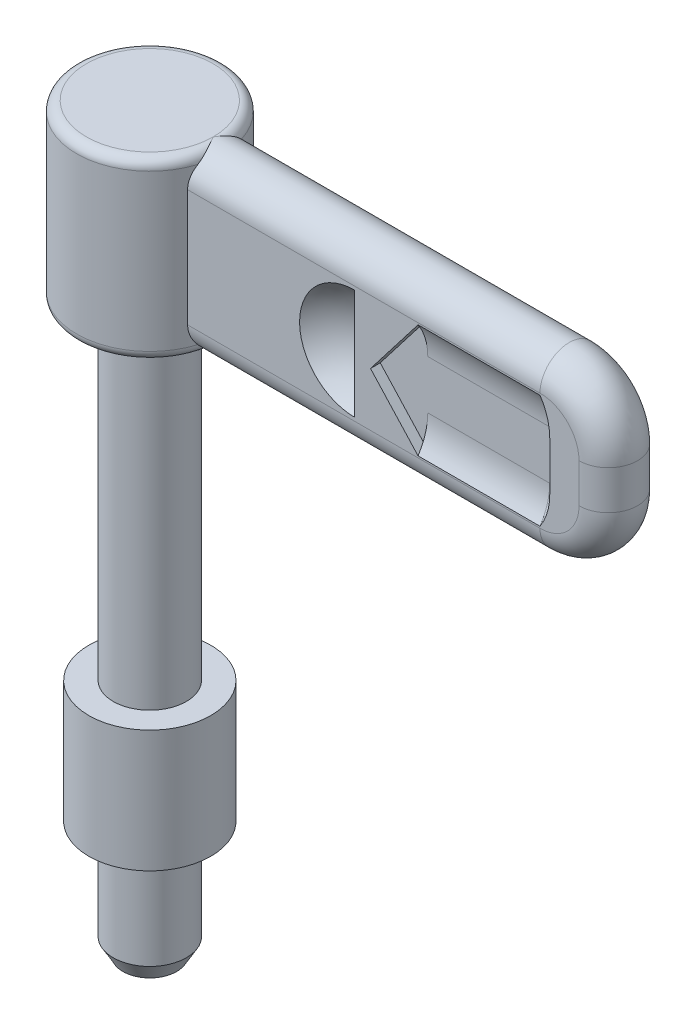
ISO-10303-21;
HEADER;
FILE_DESCRIPTION(('STEP AP214'),'2;1');
FILE_NAME('part.step','',(''),(''),'','','');
FILE_SCHEMA(('AUTOMOTIVE_DESIGN { 1 0 10303 214 1 1 1 1 }'));
ENDSEC;
DATA;
#1=APPLICATION_CONTEXT('core data for automotive mechanical design processes');
#2=APPLICATION_PROTOCOL_DEFINITION('international standard','automotive_design',2000,#1);
#3=PRODUCT_CONTEXT('',#1,'mechanical');
#4=PRODUCT('Part','Part','',(#3));
#5=PRODUCT_RELATED_PRODUCT_CATEGORY('part','',(#4));
#6=PRODUCT_DEFINITION_FORMATION('','',#4);
#7=PRODUCT_DEFINITION_CONTEXT('part definition',#1,'design');
#8=PRODUCT_DEFINITION('design','',#6,#7);
#9=PRODUCT_DEFINITION_SHAPE('','',#8);
#10=(LENGTH_UNIT() NAMED_UNIT(*) SI_UNIT(.MILLI.,.METRE.));
#11=(NAMED_UNIT(*) PLANE_ANGLE_UNIT() SI_UNIT($,.RADIAN.));
#12=(NAMED_UNIT(*) SI_UNIT($,.STERADIAN.) SOLID_ANGLE_UNIT());
#13=UNCERTAINTY_MEASURE_WITH_UNIT(LENGTH_MEASURE(1.E-05),#10,'distance_accuracy_value','');
#14=(GEOMETRIC_REPRESENTATION_CONTEXT(3) GLOBAL_UNCERTAINTY_ASSIGNED_CONTEXT((#13)) GLOBAL_UNIT_ASSIGNED_CONTEXT((#10,
#11,#12)) REPRESENTATION_CONTEXT('',''));
#15=CARTESIAN_POINT('',(0.,0.,0.));
#16=DIRECTION('',(0.,0.,1.));
#17=DIRECTION('',(1.,0.,0.));
#18=AXIS2_PLACEMENT_3D('',#15,#16,#17);
#19=CARTESIAN_POINT('',(0.,-10.,0.));
#20=DIRECTION('',(0.,-1.,0.));
#21=DIRECTION('',(7.69370911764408E-10,0.,1.));
#22=AXIS2_PLACEMENT_3D('',#19,#20,#21);
#23=CYLINDRICAL_SURFACE('',#22,5.);
#24=CARTESIAN_POINT('',(0.,0.,0.));
#25=DIRECTION('',(0.,-1.,0.));
#26=DIRECTION('',(0.,0.,-1.));
#27=AXIS2_PLACEMENT_3D('',#24,#25,#26);
#28=CIRCLE('',#27,5.);
#29=CARTESIAN_POINT('',(0.,0.,-5.));
#30=VERTEX_POINT('',#29);
#31=EDGE_CURVE('E606',#30,#30,#28,.T.);
#32=ORIENTED_EDGE('',*,*,#31,.F.);
#33=EDGE_LOOP('',(#32));
#34=FACE_BOUND('',#33,.T.);
#35=CARTESIAN_POINT('',(0.,10.,0.));
#36=DIRECTION('',(0.,1.,0.));
#37=DIRECTION('',(0.,0.,1.));
#38=AXIS2_PLACEMENT_3D('',#35,#36,#37);
#39=CIRCLE('',#38,5.);
#40=CARTESIAN_POINT('',(0.,10.,5.));
#41=VERTEX_POINT('',#40);
#42=EDGE_CURVE('E24',#41,#41,#39,.F.);
#43=ORIENTED_EDGE('',*,*,#42,.T.);
#44=EDGE_LOOP('',(#43));
#45=FACE_BOUND('',#44,.T.);
#46=ADVANCED_FACE('F16',(#34,#45),#23,.T.);
#47=CARTESIAN_POINT('',(-4.82679468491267,0.,-4.82679491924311));
#48=DIRECTION('',(0.,-1.,0.));
#49=DIRECTION('',(1.,0.,0.));
#50=AXIS2_PLACEMENT_3D('',#47,#48,#49);
#51=PLANE('',#50);
#52=CARTESIAN_POINT('',(0.,0.,0.));
#53=DIRECTION('',(0.,-1.,0.));
#54=DIRECTION('',(0.,0.,-1.));
#55=AXIS2_PLACEMENT_3D('',#52,#53,#54);
#56=CIRCLE('',#55,2.9);
#57=CARTESIAN_POINT('',(0.,0.,-2.9));
#58=VERTEX_POINT('',#57);
#59=EDGE_CURVE('E613',#58,#58,#56,.T.);
#60=ORIENTED_EDGE('',*,*,#59,.F.);
#61=EDGE_LOOP('',(#60));
#62=FACE_BOUND('',#61,.T.);
#63=ORIENTED_EDGE('',*,*,#31,.T.);
#64=EDGE_LOOP('',(#63));
#65=FACE_BOUND('',#64,.T.);
#66=ADVANCED_FACE('F18',(#62,#65),#51,.T.);
#67=CARTESIAN_POINT('',(-4.54280710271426E-13,-3.99999999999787,0.));
#68=DIRECTION('',(0.,-1.,0.));
#69=DIRECTION('',(-1.,0.,0.));
#70=AXIS2_PLACEMENT_3D('',#67,#68,#69);
#71=SPHERICAL_SURFACE('',#70,6.00000000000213);
#72=CARTESIAN_POINT('',(0.,-9.58107460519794,0.));
#73=DIRECTION('',(0.,1.,0.));
#74=DIRECTION('',(-1.,0.,0.));
#75=AXIS2_PLACEMENT_3D('',#72,#73,#74);
#76=CIRCLE('',#75,2.20263620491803);
#77=CARTESIAN_POINT('',(-2.20263620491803,-9.58107460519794,0.));
#78=VERTEX_POINT('',#77);
#79=EDGE_CURVE('E604',#78,#78,#76,.F.);
#80=ORIENTED_EDGE('',*,*,#79,.T.);
#81=EDGE_LOOP('',(#80));
#82=FACE_BOUND('',#81,.T.);
#83=ADVANCED_FACE('F1102',(#82),#71,.T.);
#84=CARTESIAN_POINT('',(0.,-8.2,0.));
#85=DIRECTION('',(0.,1.,0.));
#86=DIRECTION('',(0.,0.,-1.));
#87=AXIS2_PLACEMENT_3D('',#84,#85,#86);
#88=CONICAL_SURFACE('',#87,3.,0.523598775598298);
#89=ORIENTED_EDGE('',*,*,#79,.F.);
#90=EDGE_LOOP('',(#89));
#91=FACE_BOUND('',#90,.T.);
#92=CARTESIAN_POINT('',(0.,-8.2,0.));
#93=DIRECTION('',(0.,1.,0.));
#94=DIRECTION('',(0.,0.,-1.));
#95=AXIS2_PLACEMENT_3D('',#92,#93,#94);
#96=CIRCLE('',#95,3.);
#97=CARTESIAN_POINT('',(0.,-8.2,-3.));
#98=VERTEX_POINT('',#97);
#99=EDGE_CURVE('E601',#98,#98,#96,.F.);
#100=ORIENTED_EDGE('',*,*,#99,.T.);
#101=EDGE_LOOP('',(#100));
#102=FACE_BOUND('',#101,.T.);
#103=ADVANCED_FACE('F1128',(#91,#102),#88,.T.);
#104=CARTESIAN_POINT('',(0.,-10.,0.));
#105=DIRECTION('',(0.,-1.,0.));
#106=DIRECTION('',(7.69327835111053E-10,0.,1.));
#107=AXIS2_PLACEMENT_3D('',#104,#105,#106);
#108=CYLINDRICAL_SURFACE('',#107,3.);
#109=ORIENTED_EDGE('',*,*,#99,.F.);
#110=EDGE_LOOP('',(#109));
#111=FACE_BOUND('',#110,.T.);
#112=CARTESIAN_POINT('',(0.,-0.5,0.));
#113=DIRECTION('',(0.,1.,0.));
#114=DIRECTION('',(0.,0.,-1.));
#115=AXIS2_PLACEMENT_3D('',#112,#113,#114);
#116=CIRCLE('',#115,3.);
#117=CARTESIAN_POINT('',(0.,-0.5,-3.));
#118=VERTEX_POINT('',#117);
#119=EDGE_CURVE('E598',#118,#118,#116,.F.);
#120=ORIENTED_EDGE('',*,*,#119,.T.);
#121=EDGE_LOOP('',(#120));
#122=FACE_BOUND('',#121,.T.);
#123=ADVANCED_FACE('F1120',(#111,#122),#108,.T.);
#124=CARTESIAN_POINT('',(0.,-0.5,0.));
#125=DIRECTION('',(0.,-1.,0.));
#126=DIRECTION('',(1.92333826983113E-10,0.,1.));
#127=AXIS2_PLACEMENT_3D('',#124,#125,#126);
#128=CONICAL_SURFACE('',#127,3.,0.349065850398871);
#129=ORIENTED_EDGE('',*,*,#119,.F.);
#130=EDGE_LOOP('',(#129));
#131=FACE_BOUND('',#130,.T.);
#132=CARTESIAN_POINT('',(0.,-0.22525225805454,0.));
#133=DIRECTION('',(0.,1.,0.));
#134=DIRECTION('',(0.,0.,-1.));
#135=AXIS2_PLACEMENT_3D('',#132,#133,#134);
#136=CIRCLE('',#135,2.9);
#137=CARTESIAN_POINT('',(0.,-0.22525225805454,-2.9));
#138=VERTEX_POINT('',#137);
#139=EDGE_CURVE('E590',#138,#138,#136,.F.);
#140=ORIENTED_EDGE('',*,*,#139,.T.);
#141=EDGE_LOOP('',(#140));
#142=FACE_BOUND('',#141,.T.);
#143=ADVANCED_FACE('F1114',(#131,#142),#128,.T.);
#144=CARTESIAN_POINT('',(0.,-10.,0.));
#145=DIRECTION('',(0.,-1.,0.));
#146=DIRECTION('',(7.6933494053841E-10,0.,1.));
#147=AXIS2_PLACEMENT_3D('',#144,#145,#146);
#148=CYLINDRICAL_SURFACE('',#147,2.9);
#149=ORIENTED_EDGE('',*,*,#139,.F.);
#150=EDGE_LOOP('',(#149));
#151=FACE_BOUND('',#150,.T.);
#152=ORIENTED_EDGE('',*,*,#59,.T.);
#153=EDGE_LOOP('',(#152));
#154=FACE_BOUND('',#153,.T.);
#155=ADVANCED_FACE('F1111',(#151,#154),#148,.T.);
#156=CARTESIAN_POINT('',(-4.82679468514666,10.,4.82679529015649));
#157=DIRECTION('',(0.,1.,0.));
#158=DIRECTION('',(1.,0.,0.));
#159=AXIS2_PLACEMENT_3D('',#156,#157,#158);
#160=PLANE('',#159);
#161=ORIENTED_EDGE('',*,*,#42,.F.);
#162=EDGE_LOOP('',(#161));
#163=FACE_BOUND('',#162,.T.);
#164=CARTESIAN_POINT('',(0.,10.,0.));
#165=DIRECTION('',(0.,-1.,0.));
#166=DIRECTION('',(0.,0.,1.));
#167=AXIS2_PLACEMENT_3D('',#164,#165,#166);
#168=CIRCLE('',#167,3.);
#169=CARTESIAN_POINT('',(0.,10.,3.));
#170=VERTEX_POINT('',#169);
#171=EDGE_CURVE('E616',#170,#170,#168,.T.);
#172=ORIENTED_EDGE('',*,*,#171,.T.);
#173=EDGE_LOOP('',(#172));
#174=FACE_BOUND('',#173,.T.);
#175=ADVANCED_FACE('F1109',(#163,#174),#160,.T.);
#176=CARTESIAN_POINT('',(0.,-10.,0.));
#177=DIRECTION('',(0.,-1.,0.));
#178=DIRECTION('',(0.,0.,1.));
#179=AXIS2_PLACEMENT_3D('',#176,#177,#178);
#180=CYLINDRICAL_SURFACE('',#179,3.);
#181=CARTESIAN_POINT('',(0.,36.8,0.));
#182=DIRECTION('',(0.,-1.,0.));
#183=DIRECTION('',(0.,0.,-1.));
#184=AXIS2_PLACEMENT_3D('',#181,#182,#183);
#185=CIRCLE('',#184,3.);
#186=CARTESIAN_POINT('',(0.,36.8,-3.));
#187=VERTEX_POINT('',#186);
#188=EDGE_CURVE('E11',#187,#187,#185,.F.);
#189=ORIENTED_EDGE('',*,*,#188,.F.);
#190=EDGE_LOOP('',(#189));
#191=FACE_BOUND('',#190,.T.);
#192=ORIENTED_EDGE('',*,*,#171,.F.);
#193=EDGE_LOOP('',(#192));
#194=FACE_BOUND('',#193,.T.);
#195=ADVANCED_FACE('F580',(#191,#194),#180,.T.);
#196=CARTESIAN_POINT('',(24.4,39.346700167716,-2.4));
#197=DIRECTION('',(-1.,0.,0.));
#198=DIRECTION('',(0.,0.,1.));
#199=AXIS2_PLACEMENT_3D('',#196,#197,#198);
#200=PLANE('',#199);
#201=CARTESIAN_POINT('',(24.4,42.,-6.39999999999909));
#202=DIRECTION('',(1.,0.,0.));
#203=DIRECTION('',(0.,0.,1.));
#204=AXIS2_PLACEMENT_3D('',#201,#202,#203);
#205=CIRCLE('',#204,4.79999999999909);
#206=CARTESIAN_POINT('',(24.4,42.,-1.6));
#207=VERTEX_POINT('',#206);
#208=CARTESIAN_POINT('',(24.4,39.346700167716,-2.4));
#209=VERTEX_POINT('',#208);
#210=EDGE_CURVE('E911',#207,#209,#205,.T.);
#211=ORIENTED_EDGE('',*,*,#210,.T.);
#212=DIRECTION('',(0.,0.,-1.));
#213=VECTOR('',#212,1.);
#214=CARTESIAN_POINT('',(24.4,39.346700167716,-1.6));
#215=LINE('',#214,#213);
#216=CARTESIAN_POINT('',(24.4,39.346700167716,-1.6));
#217=VERTEX_POINT('',#216);
#218=EDGE_CURVE('E906',#217,#209,#215,.T.);
#219=ORIENTED_EDGE('',*,*,#218,.F.);
#220=DIRECTION('',(0.,1.,0.));
#221=VECTOR('',#220,1.);
#222=CARTESIAN_POINT('',(24.4,39.346700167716,-1.6));
#223=LINE('',#222,#221);
#224=EDGE_CURVE('E195',#217,#207,#223,.T.);
#225=ORIENTED_EDGE('',*,*,#224,.T.);
#226=EDGE_LOOP('',(#211,#219,#225));
#227=FACE_BOUND('',#226,.T.);
#228=ADVANCED_FACE('F1088',(#227),#200,.T.);
#229=CARTESIAN_POINT('',(24.4,46.,-2.4));
#230=DIRECTION('',(-1.,0.,0.));
#231=DIRECTION('',(0.,0.,1.));
#232=AXIS2_PLACEMENT_3D('',#229,#230,#231);
#233=PLANE('',#232);
#234=CARTESIAN_POINT('',(24.4,46.,-6.39999999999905));
#235=DIRECTION('',(1.,0.,0.));
#236=DIRECTION('',(0.,0.552770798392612,0.833333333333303));
#237=AXIS2_PLACEMENT_3D('',#234,#235,#236);
#238=CIRCLE('',#237,4.79999999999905);
#239=CARTESIAN_POINT('',(24.4,48.653299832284,-2.4));
#240=VERTEX_POINT('',#239);
#241=CARTESIAN_POINT('',(24.4,46.,-1.6));
#242=VERTEX_POINT('',#241);
#243=EDGE_CURVE('E190',#240,#242,#238,.T.);
#244=ORIENTED_EDGE('',*,*,#243,.T.);
#245=DIRECTION('',(0.,1.,0.));
#246=VECTOR('',#245,1.);
#247=CARTESIAN_POINT('',(24.4,46.,-1.6));
#248=LINE('',#247,#246);
#249=CARTESIAN_POINT('',(24.4,48.653299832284,-1.6));
#250=VERTEX_POINT('',#249);
#251=EDGE_CURVE('E201',#242,#250,#248,.T.);
#252=ORIENTED_EDGE('',*,*,#251,.T.);
#253=DIRECTION('',(0.,0.,-1.));
#254=VECTOR('',#253,1.);
#255=CARTESIAN_POINT('',(24.4,48.653299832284,-1.6));
#256=LINE('',#255,#254);
#257=EDGE_CURVE('E203',#250,#240,#256,.T.);
#258=ORIENTED_EDGE('',*,*,#257,.T.);
#259=EDGE_LOOP('',(#244,#252,#258));
#260=FACE_BOUND('',#259,.T.);
#261=ADVANCED_FACE('F200',(#260),#233,.T.);
#262=CARTESIAN_POINT('',(20.5,39.346700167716,-1.6));
#263=DIRECTION('',(0.,0.,-1.));
#264=DIRECTION('',(0.,1.,0.));
#265=AXIS2_PLACEMENT_3D('',#262,#263,#264);
#266=PLANE('',#265);
#267=DIRECTION('',(-0.610974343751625,-0.791650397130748,0.));
#268=VECTOR('',#267,1.);
#269=CARTESIAN_POINT('',(24.4,48.653299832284,-1.6));
#270=LINE('',#269,#268);
#271=CARTESIAN_POINT('',(20.5,43.6,-1.6));
#272=VERTEX_POINT('',#271);
#273=EDGE_CURVE('E207',#250,#272,#270,.T.);
#274=ORIENTED_EDGE('',*,*,#273,.F.);
#275=ORIENTED_EDGE('',*,*,#251,.F.);
#276=DIRECTION('',(1.,0.,0.));
#277=VECTOR('',#276,1.);
#278=CARTESIAN_POINT('',(24.4,46.,-1.6));
#279=LINE('',#278,#277);
#280=CARTESIAN_POINT('',(34.4,46.,-1.6));
#281=VERTEX_POINT('',#280);
#282=EDGE_CURVE('E187',#242,#281,#279,.T.);
#283=ORIENTED_EDGE('',*,*,#282,.T.);
#284=DIRECTION('',(0.,-1.,0.));
#285=VECTOR('',#284,1.);
#286=CARTESIAN_POINT('',(34.4,46.,-1.6));
#287=LINE('',#286,#285);
#288=CARTESIAN_POINT('',(34.4,42.,-1.6));
#289=VERTEX_POINT('',#288);
#290=EDGE_CURVE('E194',#289,#281,#287,.F.);
#291=ORIENTED_EDGE('',*,*,#290,.F.);
#292=DIRECTION('',(-1.,0.,0.));
#293=VECTOR('',#292,1.);
#294=CARTESIAN_POINT('',(34.4,42.,-1.6));
#295=LINE('',#294,#293);
#296=EDGE_CURVE('E925',#207,#289,#295,.F.);
#297=ORIENTED_EDGE('',*,*,#296,.F.);
#298=ORIENTED_EDGE('',*,*,#224,.F.);
#299=DIRECTION('',(0.675832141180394,-0.73705557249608,0.));
#300=VECTOR('',#299,1.);
#301=CARTESIAN_POINT('',(20.5,43.6,-1.6));
#302=LINE('',#301,#300);
#303=EDGE_CURVE('E901',#272,#217,#302,.T.);
#304=ORIENTED_EDGE('',*,*,#303,.F.);
#305=EDGE_LOOP('',(#274,#275,#283,#291,#297,#298,#304));
#306=FACE_BOUND('',#305,.T.);
#307=ADVANCED_FACE('F205',(#306),#266,.T.);
#308=CARTESIAN_POINT('',(24.4,39.346700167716,2.4));
#309=DIRECTION('',(-1.,0.,0.));
#310=DIRECTION('',(0.,1.,0.));
#311=AXIS2_PLACEMENT_3D('',#308,#309,#310);
#312=PLANE('',#311);
#313=DIRECTION('',(0.,1.,0.));
#314=VECTOR('',#313,1.);
#315=CARTESIAN_POINT('',(24.4,39.346700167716,1.6));
#316=LINE('',#315,#314);
#317=CARTESIAN_POINT('',(24.4,39.346700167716,1.6));
#318=VERTEX_POINT('',#317);
#319=CARTESIAN_POINT('',(24.4,42.,1.6));
#320=VERTEX_POINT('',#319);
#321=EDGE_CURVE('E780',#318,#320,#316,.T.);
#322=ORIENTED_EDGE('',*,*,#321,.F.);
#323=DIRECTION('',(0.,0.,1.));
#324=VECTOR('',#323,1.);
#325=CARTESIAN_POINT('',(24.4,39.346700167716,1.6));
#326=LINE('',#325,#324);
#327=CARTESIAN_POINT('',(24.4,39.346700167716,2.4));
#328=VERTEX_POINT('',#327);
#329=EDGE_CURVE('E884',#318,#328,#326,.T.);
#330=ORIENTED_EDGE('',*,*,#329,.T.);
#331=CARTESIAN_POINT('',(24.4,42.,6.39999999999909));
#332=DIRECTION('',(-1.,0.,0.));
#333=DIRECTION('',(0.,0.,-1.));
#334=AXIS2_PLACEMENT_3D('',#331,#332,#333);
#335=CIRCLE('',#334,4.79999999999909);
#336=EDGE_CURVE('E755',#328,#320,#335,.F.);
#337=ORIENTED_EDGE('',*,*,#336,.T.);
#338=EDGE_LOOP('',(#322,#330,#337));
#339=FACE_BOUND('',#338,.T.);
#340=ADVANCED_FACE('F1295',(#339),#312,.T.);
#341=CARTESIAN_POINT('',(24.4,46.,2.4));
#342=DIRECTION('',(-1.,0.,0.));
#343=DIRECTION('',(0.,1.,0.));
#344=AXIS2_PLACEMENT_3D('',#341,#342,#343);
#345=PLANE('',#344);
#346=DIRECTION('',(0.,0.,-1.));
#347=VECTOR('',#346,1.);
#348=CARTESIAN_POINT('',(24.4,48.653299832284,2.4));
#349=LINE('',#348,#347);
#350=CARTESIAN_POINT('',(24.4,48.653299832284,1.6));
#351=VERTEX_POINT('',#350);
#352=CARTESIAN_POINT('',(24.4,48.653299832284,2.4));
#353=VERTEX_POINT('',#352);
#354=EDGE_CURVE('E877',#351,#353,#349,.F.);
#355=ORIENTED_EDGE('',*,*,#354,.F.);
#356=DIRECTION('',(0.,1.,0.));
#357=VECTOR('',#356,1.);
#358=CARTESIAN_POINT('',(24.4,46.,1.6));
#359=LINE('',#358,#357);
#360=CARTESIAN_POINT('',(24.4,46.,1.6));
#361=VERTEX_POINT('',#360);
#362=EDGE_CURVE('E765',#361,#351,#359,.T.);
#363=ORIENTED_EDGE('',*,*,#362,.F.);
#364=CARTESIAN_POINT('',(24.4,46.,6.39999999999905));
#365=DIRECTION('',(-1.,0.,0.));
#366=DIRECTION('',(0.,0.552770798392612,-0.833333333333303));
#367=AXIS2_PLACEMENT_3D('',#364,#365,#366);
#368=CIRCLE('',#367,4.79999999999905);
#369=EDGE_CURVE('E719',#361,#353,#368,.F.);
#370=ORIENTED_EDGE('',*,*,#369,.T.);
#371=EDGE_LOOP('',(#355,#363,#370));
#372=FACE_BOUND('',#371,.T.);
#373=ADVANCED_FACE('F863',(#372),#345,.T.);
#374=CARTESIAN_POINT('',(34.4,39.346700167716,1.6));
#375=DIRECTION('',(0.,0.,1.));
#376=DIRECTION('',(0.,1.,0.));
#377=AXIS2_PLACEMENT_3D('',#374,#375,#376);
#378=PLANE('',#377);
#379=DIRECTION('',(0.,1.,0.));
#380=VECTOR('',#379,1.);
#381=CARTESIAN_POINT('',(34.4,42.,1.6));
#382=LINE('',#381,#380);
#383=CARTESIAN_POINT('',(34.4,42.,1.6));
#384=VERTEX_POINT('',#383);
#385=CARTESIAN_POINT('',(34.4,46.,1.6));
#386=VERTEX_POINT('',#385);
#387=EDGE_CURVE('E760',#384,#386,#382,.T.);
#388=ORIENTED_EDGE('',*,*,#387,.T.);
#389=DIRECTION('',(1.,0.,0.));
#390=VECTOR('',#389,1.);
#391=CARTESIAN_POINT('',(24.4,46.,1.6));
#392=LINE('',#391,#390);
#393=EDGE_CURVE('E1406',#361,#386,#392,.T.);
#394=ORIENTED_EDGE('',*,*,#393,.F.);
#395=ORIENTED_EDGE('',*,*,#362,.T.);
#396=DIRECTION('',(-0.610974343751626,-0.791650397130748,0.));
#397=VECTOR('',#396,1.);
#398=CARTESIAN_POINT('',(24.4,48.653299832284,1.6));
#399=LINE('',#398,#397);
#400=CARTESIAN_POINT('',(20.5,43.6,1.6));
#401=VERTEX_POINT('',#400);
#402=EDGE_CURVE('E770',#351,#401,#399,.T.);
#403=ORIENTED_EDGE('',*,*,#402,.T.);
#404=DIRECTION('',(0.675832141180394,-0.73705557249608,0.));
#405=VECTOR('',#404,1.);
#406=CARTESIAN_POINT('',(20.5,43.6,1.6));
#407=LINE('',#406,#405);
#408=EDGE_CURVE('E775',#401,#318,#407,.T.);
#409=ORIENTED_EDGE('',*,*,#408,.T.);
#410=ORIENTED_EDGE('',*,*,#321,.T.);
#411=DIRECTION('',(-1.,0.,0.));
#412=VECTOR('',#411,1.);
#413=CARTESIAN_POINT('',(34.4,42.,1.6));
#414=LINE('',#413,#412);
#415=EDGE_CURVE('E747',#320,#384,#414,.F.);
#416=ORIENTED_EDGE('',*,*,#415,.T.);
#417=EDGE_LOOP('',(#388,#394,#395,#403,#409,#410,#416));
#418=FACE_BOUND('',#417,.T.);
#419=ADVANCED_FACE('F738',(#418),#378,.T.);
#420=CARTESIAN_POINT('',(-5.26994701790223,51.2,5.19982016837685));
#421=DIRECTION('',(0.,1.,0.));
#422=DIRECTION('',(1.,0.,0.));
#423=AXIS2_PLACEMENT_3D('',#420,#421,#422);
#424=PLANE('',#423);
#425=CARTESIAN_POINT('',(0.,51.2,0.));
#426=DIRECTION('',(0.,1.,0.));
#427=DIRECTION('',(-0.707106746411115,0.,0.707106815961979));
#428=AXIS2_PLACEMENT_3D('',#425,#426,#427);
#429=CIRCLE('',#428,5.20000086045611);
#430=CARTESIAN_POINT('',(5.20000086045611,51.2,0.));
#431=VERTEX_POINT('',#430);
#432=EDGE_CURVE('E446',#431,#431,#429,.F.);
#433=ORIENTED_EDGE('',*,*,#432,.F.);
#434=EDGE_LOOP('',(#433));
#435=FACE_BOUND('',#434,.T.);
#436=ADVANCED_FACE('F475',(#435),#424,.T.);
#437=CARTESIAN_POINT('',(19.2,44.,-6.5));
#438=DIRECTION('',(0.,1.,0.));
#439=DIRECTION('',(-0.757114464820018,0.,0.653282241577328));
#440=AXIS2_PLACEMENT_3D('',#437,#438,#439);
#441=SPHERICAL_SURFACE('',#440,6.1);
#442=CARTESIAN_POINT('',(19.2,48.5166359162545,-2.40000000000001));
#443=CARTESIAN_POINT('',(19.2,48.4454248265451,-2.32154854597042));
#444=CARTESIAN_POINT('',(19.2,48.3721661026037,-2.24495617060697));
#445=CARTESIAN_POINT('',(19.2,48.2217605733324,-2.09568910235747));
#446=CARTESIAN_POINT('',(19.2,48.1446137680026,-2.02301440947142));
#447=CARTESIAN_POINT('',(19.2,47.9866392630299,-1.88178223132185));
#448=CARTESIAN_POINT('',(19.2,47.9058115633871,-1.81322474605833));
#449=CARTESIAN_POINT('',(19.2,47.7406952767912,-1.68041248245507));
#450=CARTESIAN_POINT('',(19.2,47.656406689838,-1.61615770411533));
#451=CARTESIAN_POINT('',(19.2,47.4845972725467,-1.49212543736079));
#452=CARTESIAN_POINT('',(19.2,47.3970764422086,-1.432347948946));
#453=CARTESIAN_POINT('',(19.2,47.2190401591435,-1.31743248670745));
#454=CARTESIAN_POINT('',(19.2,47.1285247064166,-1.2622945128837));
#455=CARTESIAN_POINT('',(19.2,46.944744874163,-1.1568077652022));
#456=CARTESIAN_POINT('',(19.2,46.8514804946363,-1.10645899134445));
#457=CARTESIAN_POINT('',(19.2,46.6624559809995,-1.01068731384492));
#458=CARTESIAN_POINT('',(19.2,46.5666958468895,-0.965264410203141));
#459=CARTESIAN_POINT('',(19.2,46.3729397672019,-0.879467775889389));
#460=CARTESIAN_POINT('',(19.2,46.2749438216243,-0.839094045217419));
#461=CARTESIAN_POINT('',(19.2,46.0769821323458,-0.763505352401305));
#462=CARTESIAN_POINT('',(19.2,45.9770163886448,-0.728290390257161));
#463=CARTESIAN_POINT('',(19.2,45.7753864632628,-0.663114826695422));
#464=CARTESIAN_POINT('',(19.2,45.6737222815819,-0.633154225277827));
#465=CARTESIAN_POINT('',(19.2,45.4689714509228,-0.578568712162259));
#466=CARTESIAN_POINT('',(19.2,45.3658848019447,-0.553943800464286));
#467=CARTESIAN_POINT('',(19.2,45.1585688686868,-0.510096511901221));
#468=CARTESIAN_POINT('',(19.2,45.054339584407,-0.490874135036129));
#469=CARTESIAN_POINT('',(19.2,44.8450213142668,-0.457884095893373));
#470=CARTESIAN_POINT('',(19.2,44.7399323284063,-0.44411643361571));
#471=CARTESIAN_POINT('',(19.2,44.5291799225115,-0.422073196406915));
#472=CARTESIAN_POINT('',(19.2,44.4235165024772,-0.413797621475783));
#473=CARTESIAN_POINT('',(19.2,44.2119020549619,-0.402761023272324));
#474=CARTESIAN_POINT('',(19.2,44.105951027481,-0.399999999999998));
#475=CARTESIAN_POINT('',(19.2,43.894048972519,-0.399999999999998));
#476=CARTESIAN_POINT('',(19.2,43.7880979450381,-0.402761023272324));
#477=CARTESIAN_POINT('',(19.2,43.5764834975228,-0.413797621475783));
#478=CARTESIAN_POINT('',(19.2,43.4708200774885,-0.422073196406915));
#479=CARTESIAN_POINT('',(19.2,43.2600676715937,-0.44411643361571));
#480=CARTESIAN_POINT('',(19.2,43.1549786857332,-0.457884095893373));
#481=CARTESIAN_POINT('',(19.2,42.945660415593,-0.490874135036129));
#482=CARTESIAN_POINT('',(19.2,42.8414311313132,-0.510096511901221));
#483=CARTESIAN_POINT('',(19.2,42.6341151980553,-0.553943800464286));
#484=CARTESIAN_POINT('',(19.2,42.5310285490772,-0.578568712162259));
#485=CARTESIAN_POINT('',(19.2,42.3262777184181,-0.633154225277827));
#486=CARTESIAN_POINT('',(19.2,42.2246135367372,-0.663114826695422));
#487=CARTESIAN_POINT('',(19.2,42.0229836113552,-0.728290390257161));
#488=CARTESIAN_POINT('',(19.2,41.9230178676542,-0.763505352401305));
#489=CARTESIAN_POINT('',(19.2,41.7250561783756,-0.839094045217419));
#490=CARTESIAN_POINT('',(19.2,41.6270602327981,-0.879467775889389));
#491=CARTESIAN_POINT('',(19.2,41.4333041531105,-0.965264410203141));
#492=CARTESIAN_POINT('',(19.2,41.3375440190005,-1.01068731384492));
#493=CARTESIAN_POINT('',(19.2,41.1485195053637,-1.10645899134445));
#494=CARTESIAN_POINT('',(19.2,41.055255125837,-1.1568077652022));
#495=CARTESIAN_POINT('',(19.2,40.8714752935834,-1.2622945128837));
#496=CARTESIAN_POINT('',(19.2,40.7809598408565,-1.31743248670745));
#497=CARTESIAN_POINT('',(19.2,40.6029235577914,-1.432347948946));
#498=CARTESIAN_POINT('',(19.2,40.5154027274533,-1.49212543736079));
#499=CARTESIAN_POINT('',(19.2,40.343593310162,-1.61615770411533));
#500=CARTESIAN_POINT('',(19.2,40.2593047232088,-1.68041248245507));
#501=CARTESIAN_POINT('',(19.2,40.0941884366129,-1.81322474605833));
#502=CARTESIAN_POINT('',(19.2,40.0133607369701,-1.88178223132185));
#503=CARTESIAN_POINT('',(19.2,39.8553862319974,-2.02301440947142));
#504=CARTESIAN_POINT('',(19.2,39.7782394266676,-2.09568910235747));
#505=CARTESIAN_POINT('',(19.2,39.6278338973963,-2.24495617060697));
#506=CARTESIAN_POINT('',(19.2,39.5545751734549,-2.32154854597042));
#507=CARTESIAN_POINT('',(19.2,39.4833640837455,-2.40000000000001));
#508=B_SPLINE_CURVE_WITH_KNOTS('',3,(#442,#443,#444,#445,#446,#447,#448,#449,#450,#451,#452,
#453,#454,#455,#456,#457,#458,#459,#460,#461,#462,#463,#464,#465,#466,#467,#468,#469,#470,#471,
#472,#473,#474,#475,#476,#477,#478,#479,#480,#481,#482,#483,#484,#485,#486,#487,#488,#489,#490,
#491,#492,#493,#494,#495,#496,#497,#498,#499,#500,#501,#502,#503,#504,#505,#506,#507),
.UNSPECIFIED.,.F.,.F.,(4,2,2,2,2,2,2,2,2,2,2,2,2,2,2,2,2,2,2,2,2,2,2,2,2,2,2,2,2,2,2,2,4),(0.,
0.31781713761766,0.635634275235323,0.953451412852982,1.27126855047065,1.58908568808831,
1.90690282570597,2.22471996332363,2.54253710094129,2.86035423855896,3.17817137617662,
3.49598851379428,3.81380565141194,4.13162278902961,4.44943992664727,4.76725706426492,
5.08507420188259,5.40289133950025,5.72070847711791,6.03852561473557,6.35634275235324,
6.6741598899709,6.99197702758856,7.30979416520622,7.62761130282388,7.94542844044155,
8.26324557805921,8.58106271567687,8.89887985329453,9.2166969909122,9.53451412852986,
9.85233126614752,10.1701484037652),.UNSPECIFIED.);
#509=CARTESIAN_POINT('',(19.2,48.5166359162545,-2.4));
#510=VERTEX_POINT('',#509);
#511=CARTESIAN_POINT('',(19.2,39.4833640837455,-2.4));
#512=VERTEX_POINT('',#511);
#513=EDGE_CURVE('E620',#510,#512,#508,.T.);
#514=ORIENTED_EDGE('',*,*,#513,.T.);
#515=CARTESIAN_POINT('',(19.2,48.5166359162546,-2.4));
#516=CARTESIAN_POINT('',(18.9546860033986,48.5166359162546,-2.4));
#517=CARTESIAN_POINT('',(18.7168170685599,48.497667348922,-2.4));
#518=CARTESIAN_POINT('',(18.2531812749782,48.4236894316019,-2.4));
#519=CARTESIAN_POINT('',(18.0274144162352,48.3686800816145,-2.4));
#520=CARTESIAN_POINT('',(17.4769210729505,48.1892198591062,-2.4));
#521=CARTESIAN_POINT('',(17.1604140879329,48.0445418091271,-2.4));
#522=CARTESIAN_POINT('',(16.3438787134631,47.5541631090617,-2.4));
#523=CARTESIAN_POINT('',(15.9075997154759,47.1448744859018,-2.4));
#524=CARTESIAN_POINT('',(14.2350139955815,44.885547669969,-2.4));
#525=CARTESIAN_POINT('',(14.4291116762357,42.3834005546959,-2.4));
#526=CARTESIAN_POINT('',(16.3373888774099,40.4751233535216,-2.4));
#527=CARTESIAN_POINT('',(16.7125489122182,40.1965456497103,-2.4));
#528=CARTESIAN_POINT('',(17.4532373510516,39.8214275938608,-2.4));
#529=CARTESIAN_POINT('',(17.7758823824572,39.6989351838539,-2.4));
#530=CARTESIAN_POINT('',(18.4689492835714,39.5270686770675,-2.4));
#531=CARTESIAN_POINT('',(18.8301279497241,39.4833640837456,-2.4));
#532=CARTESIAN_POINT('',(19.2,39.4833640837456,-2.4));
#533=B_SPLINE_CURVE_WITH_KNOTS('',3,(#515,#516,#517,#518,#519,#520,#521,#522,#523,#524,#525,
#526,#527,#528,#529,#530,#531,#532),.UNSPECIFIED.,.F.,.F.,(4,2,2,2,2,2,2,2,4),(0.,
0.0452435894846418,0.0904871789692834,0.157885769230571,0.280523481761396,0.759938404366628,
0.860594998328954,0.929100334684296,1.),.UNSPECIFIED.);
#534=EDGE_CURVE('E291',#510,#512,#533,.T.);
#535=ORIENTED_EDGE('',*,*,#534,.F.);
#536=EDGE_LOOP('',(#514,#535));
#537=FACE_BOUND('',#536,.T.);
#538=ADVANCED_FACE('F677',(#537),#441,.F.);
#539=CARTESIAN_POINT('',(19.2,39.4833640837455,-0.4));
#540=DIRECTION('',(-1.,0.,0.));
#541=DIRECTION('',(0.,1.,0.));
#542=AXIS2_PLACEMENT_3D('',#539,#540,#541);
#543=PLANE('',#542);
#544=ORIENTED_EDGE('',*,*,#513,.F.);
#545=DIRECTION('',(0.,1.,0.));
#546=VECTOR('',#545,1.);
#547=CARTESIAN_POINT('',(19.2,39.4833640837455,-2.4));
#548=LINE('',#547,#546);
#549=EDGE_CURVE('E1058',#512,#510,#548,.T.);
#550=ORIENTED_EDGE('',*,*,#549,.F.);
#551=EDGE_LOOP('',(#544,#550));
#552=FACE_BOUND('',#551,.T.);
#553=ADVANCED_FACE('F686',(#552),#543,.T.);
#554=CARTESIAN_POINT('',(34.4,48.653299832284,-2.4));
#555=DIRECTION('',(0.,1.,0.));
#556=DIRECTION('',(0.,0.,1.));
#557=AXIS2_PLACEMENT_3D('',#554,#555,#556);
#558=CYLINDRICAL_SURFACE('',#557,0.8);
#559=CARTESIAN_POINT('',(35.2,46.,-2.4));
#560=CARTESIAN_POINT('',(35.2000000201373,46.,-2.38690275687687));
#561=CARTESIAN_POINT('',(35.1996722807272,46.,-2.37380580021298));
#562=CARTESIAN_POINT('',(35.1983673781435,46.,-2.34763310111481));
#563=CARTESIAN_POINT('',(35.1973896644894,46.,-2.33455738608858));
#564=CARTESIAN_POINT('',(35.1947902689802,46.,-2.30846348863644));
#565=CARTESIAN_POINT('',(35.1931682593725,46.,-2.29544533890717));
#566=CARTESIAN_POINT('',(35.1892868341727,46.,-2.26950166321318));
#567=CARTESIAN_POINT('',(35.187027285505,46.,-2.25657615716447));
#568=CARTESIAN_POINT('',(35.1818784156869,46.,-2.23085188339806));
#569=CARTESIAN_POINT('',(35.1789891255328,46.,-2.21805310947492));
#570=CARTESIAN_POINT('',(35.1725894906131,46.,-2.19261536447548));
#571=CARTESIAN_POINT('',(35.1690793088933,46.,-2.17997635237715));
#572=CARTESIAN_POINT('',(35.161447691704,46.,-2.15489015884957));
#573=CARTESIAN_POINT('',(35.1573265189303,46.,-2.1424428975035));
#574=CARTESIAN_POINT('',(35.1484838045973,46.,-2.11777118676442));
#575=CARTESIAN_POINT('',(35.1437625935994,46.,-2.10554661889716));
#576=CARTESIAN_POINT('',(35.1337317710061,46.,-2.08135022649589));
#577=CARTESIAN_POINT('',(35.1284225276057,46.,-2.06937824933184));
#578=CARTESIAN_POINT('',(35.1172286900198,46.,-2.04571591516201));
#579=CARTESIAN_POINT('',(35.1113444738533,46.,-2.03402537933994));
#580=CARTESIAN_POINT('',(35.0990148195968,46.,-2.0109537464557));
#581=CARTESIAN_POINT('',(35.0925697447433,46.,-1.99957245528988));
#582=CARTESIAN_POINT('',(35.0791335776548,46.,-1.977146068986));
#583=CARTESIAN_POINT('',(35.0721428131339,46.,-1.96610077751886));
#584=CARTESIAN_POINT('',(35.0576315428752,46.,-1.94437208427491));
#585=CARTESIAN_POINT('',(35.0501113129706,46.,-1.93368849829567));
#586=CARTESIAN_POINT('',(35.034558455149,46.,-1.91270784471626));
#587=CARTESIAN_POINT('',(35.0265260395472,46.,-1.90241061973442));
#588=CARTESIAN_POINT('',(35.0099672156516,46.,-1.88222625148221));
#589=CARTESIAN_POINT('',(35.0014409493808,46.,-1.87233899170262));
#590=CARTESIAN_POINT('',(34.9839138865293,46.,-1.8529970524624));
#591=CARTESIAN_POINT('',(34.9749131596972,46.,-1.84354230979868));
#592=CARTESIAN_POINT('',(34.9564576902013,46.,-1.82508684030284));
#593=CARTESIAN_POINT('',(34.9470029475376,46.,-1.81608611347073));
#594=CARTESIAN_POINT('',(34.9276610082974,46.,-1.79855905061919));
#595=CARTESIAN_POINT('',(34.9177737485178,46.,-1.79003278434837));
#596=CARTESIAN_POINT('',(34.8975893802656,46.,-1.77347396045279));
#597=CARTESIAN_POINT('',(34.8872921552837,46.,-1.76544154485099));
#598=CARTESIAN_POINT('',(34.8663115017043,46.,-1.74988868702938));
#599=CARTESIAN_POINT('',(34.8556279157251,46.,-1.74236845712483));
#600=CARTESIAN_POINT('',(34.8338992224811,46.,-1.72785718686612));
#601=CARTESIAN_POINT('',(34.822853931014,46.,-1.7208664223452));
#602=CARTESIAN_POINT('',(34.8004275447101,46.,-1.70743025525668));
#603=CARTESIAN_POINT('',(34.7890462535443,46.,-1.70098518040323));
#604=CARTESIAN_POINT('',(34.7659746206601,46.,-1.68865552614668));
#605=CARTESIAN_POINT('',(34.754284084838,46.,-1.68277130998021));
#606=CARTESIAN_POINT('',(34.7306217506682,46.,-1.67157747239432));
#607=CARTESIAN_POINT('',(34.7186497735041,46.,-1.66626822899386));
#608=CARTESIAN_POINT('',(34.6944533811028,46.,-1.65623740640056));
#609=CARTESIAN_POINT('',(34.6822288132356,46.,-1.65151619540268));
#610=CARTESIAN_POINT('',(34.6575571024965,46.,-1.64267348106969));
#611=CARTESIAN_POINT('',(34.6451098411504,46.,-1.63855230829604));
#612=CARTESIAN_POINT('',(34.6200236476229,46.,-1.63092069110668));
#613=CARTESIAN_POINT('',(34.6073846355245,46.,-1.62741050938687));
#614=CARTESIAN_POINT('',(34.5819468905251,46.,-1.62101087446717));
#615=CARTESIAN_POINT('',(34.569148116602,46.,-1.61812158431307));
#616=CARTESIAN_POINT('',(34.5434238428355,46.,-1.61297271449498));
#617=CARTESIAN_POINT('',(34.5304983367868,46.,-1.61071316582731));
#618=CARTESIAN_POINT('',(34.5045546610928,46.,-1.60683174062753));
#619=CARTESIAN_POINT('',(34.4915365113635,46.,-1.60520973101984));
#620=CARTESIAN_POINT('',(34.4654426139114,46.,-1.60261033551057));
#621=CARTESIAN_POINT('',(34.4523668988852,46.,-1.60163262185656));
#622=CARTESIAN_POINT('',(34.426194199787,46.,-1.60032771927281));
#623=CARTESIAN_POINT('',(34.4130972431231,46.,-1.59999997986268));
#624=CARTESIAN_POINT('',(34.4,46.,-1.6));
#625=B_SPLINE_CURVE_WITH_KNOTS('',3,(#559,#560,#561,#562,#563,#564,#565,#566,#567,#568,#569,
#570,#571,#572,#573,#574,#575,#576,#577,#578,#579,#580,#581,#582,#583,#584,#585,#586,#587,#588,
#589,#590,#591,#592,#593,#594,#595,#596,#597,#598,#599,#600,#601,#602,#603,#604,#605,#606,#607,
#608,#609,#610,#611,#612,#613,#614,#615,#616,#617,#618,#619,#620,#621,#622,#623,#624),
.UNSPECIFIED.,.F.,.F.,(4,2,2,2,2,2,2,2,2,2,2,2,2,2,2,2,2,2,2,2,2,2,2,2,2,2,2,2,2,2,2,2,4),(0.,
0.039287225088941,0.0786077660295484,0.117948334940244,0.157297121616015,0.196643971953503,
0.235980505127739,0.275300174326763,0.314598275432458,0.353871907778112,0.393119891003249,
0.432342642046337,0.47154201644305,0.510721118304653,0.549884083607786,0.589035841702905,
0.62818186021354,0.667327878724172,0.706479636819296,0.745642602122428,0.784821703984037,
0.824021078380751,0.863243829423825,0.902491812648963,0.941765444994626,0.981063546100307,
1.02038321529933,1.05971974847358,1.09906659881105,1.13841538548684,1.17775595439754,
1.21707649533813,1.25636372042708),.UNSPECIFIED.);
#626=CARTESIAN_POINT('',(35.2,46.,-2.4));
#627=VERTEX_POINT('',#626);
#628=EDGE_CURVE('E978',#281,#627,#625,.F.);
#629=ORIENTED_EDGE('',*,*,#628,.T.);
#630=DIRECTION('',(0.,1.,0.));
#631=VECTOR('',#630,1.);
#632=CARTESIAN_POINT('',(35.2,42.,-2.4));
#633=LINE('',#632,#631);
#634=CARTESIAN_POINT('',(35.2,42.,-2.4));
#635=VERTEX_POINT('',#634);
#636=EDGE_CURVE('E1057',#635,#627,#633,.T.);
#637=ORIENTED_EDGE('',*,*,#636,.F.);
#638=CARTESIAN_POINT('',(34.4,42.,-1.6));
#639=CARTESIAN_POINT('',(34.4130972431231,42.,-1.59999997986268));
#640=CARTESIAN_POINT('',(34.426194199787,42.,-1.60032771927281));
#641=CARTESIAN_POINT('',(34.4523668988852,42.,-1.60163262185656));
#642=CARTESIAN_POINT('',(34.4654426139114,42.,-1.60261033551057));
#643=CARTESIAN_POINT('',(34.4915365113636,42.,-1.60520973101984));
#644=CARTESIAN_POINT('',(34.5045546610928,42.,-1.60683174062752));
#645=CARTESIAN_POINT('',(34.5304983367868,42.,-1.61071316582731));
#646=CARTESIAN_POINT('',(34.5434238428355,42.,-1.61297271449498));
#647=CARTESIAN_POINT('',(34.5691481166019,42.,-1.61812158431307));
#648=CARTESIAN_POINT('',(34.5819468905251,42.,-1.62101087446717));
#649=CARTESIAN_POINT('',(34.6073846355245,42.,-1.62741050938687));
#650=CARTESIAN_POINT('',(34.6200236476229,42.,-1.63092069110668));
#651=CARTESIAN_POINT('',(34.6451098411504,42.,-1.63855230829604));
#652=CARTESIAN_POINT('',(34.6575571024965,42.,-1.64267348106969));
#653=CARTESIAN_POINT('',(34.6822288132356,42.,-1.65151619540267));
#654=CARTESIAN_POINT('',(34.6944533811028,42.,-1.65623740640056));
#655=CARTESIAN_POINT('',(34.7186497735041,42.,-1.66626822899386));
#656=CARTESIAN_POINT('',(34.7306217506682,42.,-1.67157747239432));
#657=CARTESIAN_POINT('',(34.754284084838,42.,-1.68277130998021));
#658=CARTESIAN_POINT('',(34.7659746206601,42.,-1.68865552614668));
#659=CARTESIAN_POINT('',(34.7890462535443,42.,-1.70098518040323));
#660=CARTESIAN_POINT('',(34.8004275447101,42.,-1.70743025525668));
#661=CARTESIAN_POINT('',(34.822853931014,42.,-1.7208664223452));
#662=CARTESIAN_POINT('',(34.8338992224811,42.,-1.72785718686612));
#663=CARTESIAN_POINT('',(34.8556279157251,42.,-1.74236845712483));
#664=CARTESIAN_POINT('',(34.8663115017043,42.,-1.74988868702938));
#665=CARTESIAN_POINT('',(34.8872921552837,42.,-1.76544154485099));
#666=CARTESIAN_POINT('',(34.8975893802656,42.,-1.77347396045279));
#667=CARTESIAN_POINT('',(34.9177737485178,42.,-1.79003278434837));
#668=CARTESIAN_POINT('',(34.9276610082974,42.,-1.79855905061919));
#669=CARTESIAN_POINT('',(34.9470029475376,42.,-1.81608611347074));
#670=CARTESIAN_POINT('',(34.9564576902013,42.,-1.82508684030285));
#671=CARTESIAN_POINT('',(34.9749131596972,42.,-1.84354230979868));
#672=CARTESIAN_POINT('',(34.9839138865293,42.,-1.8529970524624));
#673=CARTESIAN_POINT('',(35.0014409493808,42.,-1.87233899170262));
#674=CARTESIAN_POINT('',(35.0099672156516,42.,-1.88222625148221));
#675=CARTESIAN_POINT('',(35.0265260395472,42.,-1.90241061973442));
#676=CARTESIAN_POINT('',(35.034558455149,42.,-1.91270784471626));
#677=CARTESIAN_POINT('',(35.0501113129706,42.,-1.93368849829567));
#678=CARTESIAN_POINT('',(35.0576315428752,42.,-1.94437208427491));
#679=CARTESIAN_POINT('',(35.0721428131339,42.,-1.96610077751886));
#680=CARTESIAN_POINT('',(35.0791335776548,42.,-1.977146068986));
#681=CARTESIAN_POINT('',(35.0925697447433,42.,-1.99957245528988));
#682=CARTESIAN_POINT('',(35.0990148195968,42.,-2.0109537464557));
#683=CARTESIAN_POINT('',(35.1113444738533,42.,-2.03402537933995));
#684=CARTESIAN_POINT('',(35.1172286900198,42.,-2.04571591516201));
#685=CARTESIAN_POINT('',(35.1284225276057,42.,-2.06937824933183));
#686=CARTESIAN_POINT('',(35.1337317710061,42.,-2.08135022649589));
#687=CARTESIAN_POINT('',(35.1437625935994,42.,-2.10554661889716));
#688=CARTESIAN_POINT('',(35.1484838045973,42.,-2.11777118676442));
#689=CARTESIAN_POINT('',(35.1573265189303,42.,-2.1424428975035));
#690=CARTESIAN_POINT('',(35.161447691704,42.,-2.15489015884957));
#691=CARTESIAN_POINT('',(35.1690793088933,42.,-2.17997635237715));
#692=CARTESIAN_POINT('',(35.1725894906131,42.,-2.19261536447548));
#693=CARTESIAN_POINT('',(35.1789891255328,42.,-2.21805310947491));
#694=CARTESIAN_POINT('',(35.1818784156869,42.,-2.23085188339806));
#695=CARTESIAN_POINT('',(35.187027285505,42.,-2.25657615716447));
#696=CARTESIAN_POINT('',(35.1892868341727,42.,-2.26950166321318));
#697=CARTESIAN_POINT('',(35.1931682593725,42.,-2.29544533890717));
#698=CARTESIAN_POINT('',(35.1947902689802,42.,-2.30846348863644));
#699=CARTESIAN_POINT('',(35.1973896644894,42.,-2.33455738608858));
#700=CARTESIAN_POINT('',(35.1983673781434,42.,-2.34763310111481));
#701=CARTESIAN_POINT('',(35.1996722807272,42.,-2.37380580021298));
#702=CARTESIAN_POINT('',(35.2000000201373,42.,-2.38690275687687));
#703=CARTESIAN_POINT('',(35.2,42.,-2.4));
#704=B_SPLINE_CURVE_WITH_KNOTS('',3,(#638,#639,#640,#641,#642,#643,#644,#645,#646,#647,#648,
#649,#650,#651,#652,#653,#654,#655,#656,#657,#658,#659,#660,#661,#662,#663,#664,#665,#666,#667,
#668,#669,#670,#671,#672,#673,#674,#675,#676,#677,#678,#679,#680,#681,#682,#683,#684,#685,#686,
#687,#688,#689,#690,#691,#692,#693,#694,#695,#696,#697,#698,#699,#700,#701,#702,#703),
.UNSPECIFIED.,.F.,.F.,(4,2,2,2,2,2,2,2,2,2,2,2,2,2,2,2,2,2,2,2,2,2,2,2,2,2,2,2,2,2,2,2,4),(0.,
0.0392872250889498,0.0786077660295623,0.117948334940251,0.157297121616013,0.196643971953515,
0.235980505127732,0.275300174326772,0.31459827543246,0.353871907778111,0.393119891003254,
0.43234264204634,0.471542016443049,0.510721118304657,0.549884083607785,0.589035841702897,
0.62818186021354,0.667327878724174,0.706479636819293,0.745642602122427,0.78482170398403,
0.824021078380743,0.863243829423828,0.902491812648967,0.941765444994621,0.981063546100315,
1.02038321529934,1.05971974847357,1.09906659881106,1.13841538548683,1.17775595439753,
1.21707649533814,1.25636372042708),.UNSPECIFIED.);
#705=EDGE_CURVE('E31',#289,#635,#704,.T.);
#706=ORIENTED_EDGE('',*,*,#705,.F.);
#707=ORIENTED_EDGE('',*,*,#290,.T.);
#708=EDGE_LOOP('',(#629,#637,#706,#707));
#709=FACE_BOUND('',#708,.T.);
#710=ADVANCED_FACE('F954',(#709),#558,.F.);
#711=CARTESIAN_POINT('',(34.4,42.,-1.6));
#712=CARTESIAN_POINT('',(34.4,40.5553686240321,-1.60869976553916));
#713=CARTESIAN_POINT('',(34.4,39.346700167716,-2.4));
#714=CARTESIAN_POINT('',(34.714159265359,42.,-1.6));
#715=CARTESIAN_POINT('',(34.7107428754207,40.5553686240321,-1.60869976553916));
#716=CARTESIAN_POINT('',(34.4,39.346700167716,-2.4));
#717=CARTESIAN_POINT('',(35.0323882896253,42.,-1.76761171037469));
#718=CARTESIAN_POINT('',(35.0255112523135,40.5553686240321,-1.77448874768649));
#719=CARTESIAN_POINT('',(34.4,39.346700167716,-2.4));
#720=CARTESIAN_POINT('',(35.2,42.,-2.08584073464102));
#721=CARTESIAN_POINT('',(35.1913002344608,40.5553686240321,-2.08925712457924));
#722=CARTESIAN_POINT('',(34.4,39.346700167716,-2.4));
#723=CARTESIAN_POINT('',(35.2,42.,-2.4));
#724=CARTESIAN_POINT('',(35.1913002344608,40.5553686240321,-2.4));
#725=CARTESIAN_POINT('',(34.4,39.346700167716,-2.4));
#726=B_SPLINE_SURFACE_WITH_KNOTS('',4,2,((#711,#712,#713),(#714,#715,#716),(#717,#718,#719),
(#720,#721,#722),(#723,#724,#725)),.UNSPECIFIED.,.F.,.F.,.F.,(5,5),(3,3),(0.,1.),(0.,1.),.UNSPECIFIED.);
#727=CARTESIAN_POINT('',(35.2,42.,-2.4));
#728=CARTESIAN_POINT('',(35.1996484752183,41.9414193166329,-2.4));
#729=CARTESIAN_POINT('',(35.198327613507,41.8828425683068,-2.4));
#730=CARTESIAN_POINT('',(35.1936990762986,41.7657535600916,-2.4));
#731=CARTESIAN_POINT('',(35.1903909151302,41.7072413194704,-2.4));
#732=CARTESIAN_POINT('',(35.1817400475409,41.5903704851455,-2.4));
#733=CARTESIAN_POINT('',(35.1763974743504,41.5320118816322,-2.4));
#734=CARTESIAN_POINT('',(35.1636420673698,41.4155359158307,-2.4));
#735=CARTESIAN_POINT('',(35.1562297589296,41.3574184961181,-2.4));
#736=CARTESIAN_POINT('',(35.1393089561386,41.2415091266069,-2.4));
#737=CARTESIAN_POINT('',(35.1298011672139,41.1837170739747,-2.4));
#738=CARTESIAN_POINT('',(35.1086740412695,41.0685396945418,-2.4));
#739=CARTESIAN_POINT('',(35.0970554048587,41.0111542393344,-2.4));
#740=CARTESIAN_POINT('',(35.0717016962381,40.8968681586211,-2.4));
#741=CARTESIAN_POINT('',(35.0579671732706,40.8399674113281,-2.4));
#742=CARTESIAN_POINT('',(35.0283873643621,40.72672569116,-2.4));
#743=CARTESIAN_POINT('',(35.0125423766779,40.6703846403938,-2.4));
#744=CARTESIAN_POINT('',(34.9787578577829,40.5583340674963,-2.4));
#745=CARTESIAN_POINT('',(34.9608183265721,40.5026245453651,-2.4));
#746=CARTESIAN_POINT('',(34.9228714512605,40.3919055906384,-2.4));
#747=CARTESIAN_POINT('',(34.9028638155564,40.3368962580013,-2.4));
#748=CARTESIAN_POINT('',(34.8608178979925,40.2276430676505,-2.4));
#749=CARTESIAN_POINT('',(34.8387790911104,40.1733994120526,-2.4));
#750=CARTESIAN_POINT('',(34.7927183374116,40.0657398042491,-2.4));
#751=CARTESIAN_POINT('',(34.7686957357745,40.0123241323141,-2.4));
#752=CARTESIAN_POINT('',(34.7187250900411,39.9063796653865,-2.4));
#753=CARTESIAN_POINT('',(34.6927764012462,39.8538511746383,-2.4));
#754=CARTESIAN_POINT('',(34.6390213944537,39.7497370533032,-2.4));
#755=CARTESIAN_POINT('',(34.6112146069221,39.6981516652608,-2.4));
#756=CARTESIAN_POINT('',(34.5538208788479,39.5959773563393,-2.4));
#757=CARTESIAN_POINT('',(34.5242338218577,39.5453885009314,-2.4));
#758=CARTESIAN_POINT('',(34.4633675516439,39.4452558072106,-2.4));
#759=CARTESIAN_POINT('',(34.4320887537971,39.3957117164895,-2.4));
#760=CARTESIAN_POINT('',(34.4,39.346700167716,-2.4));
#761=B_SPLINE_CURVE_WITH_KNOTS('',3,(#727,#728,#729,#730,#731,#732,#733,#734,#735,#736,#737,
#738,#739,#740,#741,#742,#743,#744,#745,#746,#747,#748,#749,#750,#751,#752,#753,#754,#755,#756,
#757,#758,#759,#760),.UNSPECIFIED.,.F.,.F.,(4,2,2,2,2,2,2,2,2,2,2,2,2,2,2,2,4),(0.,
0.1757399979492,0.351522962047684,0.527294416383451,0.703021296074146,0.878689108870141,
1.05429872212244,1.22986282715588,1.40540214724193,1.58094146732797,1.75650557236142,
1.93211518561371,2.1077829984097,2.2835098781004,2.45928133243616,2.63506429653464,
2.81080429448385),.UNSPECIFIED.);
#762=CARTESIAN_POINT('',(34.4,39.346700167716,-2.4));
#763=VERTEX_POINT('',#762);
#764=EDGE_CURVE('E1052',#635,#763,#761,.T.);
#765=CARTESIAN_POINT('',(34.4,39.346700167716,-2.4));
#766=CARTESIAN_POINT('',(34.4,39.3957117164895,-2.36791124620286));
#767=CARTESIAN_POINT('',(34.4,39.4452558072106,-2.3366324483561));
#768=CARTESIAN_POINT('',(34.4,39.5453885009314,-2.27576617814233));
#769=CARTESIAN_POINT('',(34.4,39.5959773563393,-2.24617912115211));
#770=CARTESIAN_POINT('',(34.4,39.6981516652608,-2.18878539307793));
#771=CARTESIAN_POINT('',(34.4,39.7497370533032,-2.16097860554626));
#772=CARTESIAN_POINT('',(34.4,39.8538511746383,-2.1072235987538));
#773=CARTESIAN_POINT('',(34.4,39.9063796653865,-2.08127490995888));
#774=CARTESIAN_POINT('',(34.4,40.0123241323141,-2.03130426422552));
#775=CARTESIAN_POINT('',(34.4,40.0657398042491,-2.00728166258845));
#776=CARTESIAN_POINT('',(34.4,40.1733994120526,-1.96122090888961));
#777=CARTESIAN_POINT('',(34.4,40.2276430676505,-1.93918210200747));
#778=CARTESIAN_POINT('',(34.4,40.3368962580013,-1.89713618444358));
#779=CARTESIAN_POINT('',(34.4,40.3919055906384,-1.87712854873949));
#780=CARTESIAN_POINT('',(34.4,40.5026245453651,-1.83918167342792));
#781=CARTESIAN_POINT('',(34.4,40.5583340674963,-1.82124214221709));
#782=CARTESIAN_POINT('',(34.4,40.6703846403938,-1.78745762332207));
#783=CARTESIAN_POINT('',(34.4,40.72672569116,-1.77161263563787));
#784=CARTESIAN_POINT('',(34.4,40.8399674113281,-1.74203282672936));
#785=CARTESIAN_POINT('',(34.4,40.8968681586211,-1.72829830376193));
#786=CARTESIAN_POINT('',(34.4,41.0111542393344,-1.70294459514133));
#787=CARTESIAN_POINT('',(34.4,41.0685396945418,-1.69132595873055));
#788=CARTESIAN_POINT('',(34.4,41.1837170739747,-1.67019883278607));
#789=CARTESIAN_POINT('',(34.4,41.2415091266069,-1.66069104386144));
#790=CARTESIAN_POINT('',(34.4,41.3574184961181,-1.6437702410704));
#791=CARTESIAN_POINT('',(34.4,41.4155359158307,-1.63635793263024));
#792=CARTESIAN_POINT('',(34.4,41.5320118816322,-1.62360252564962));
#793=CARTESIAN_POINT('',(34.4,41.5903704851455,-1.61825995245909));
#794=CARTESIAN_POINT('',(34.4,41.7072413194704,-1.60960908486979));
#795=CARTESIAN_POINT('',(34.4,41.7657535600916,-1.60630092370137));
#796=CARTESIAN_POINT('',(34.4,41.8828425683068,-1.60167238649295));
#797=CARTESIAN_POINT('',(34.4,41.9414193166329,-1.60035152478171));
#798=CARTESIAN_POINT('',(34.4,42.,-1.6));
#799=B_SPLINE_CURVE_WITH_KNOTS('',3,(#765,#766,#767,#768,#769,#770,#771,#772,#773,#774,#775,
#776,#777,#778,#779,#780,#781,#782,#783,#784,#785,#786,#787,#788,#789,#790,#791,#792,#793,#794,
#795,#796,#797,#798),.UNSPECIFIED.,.F.,.F.,(4,2,2,2,2,2,2,2,2,2,2,2,2,2,2,2,4),(0.,
0.175739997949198,0.351522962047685,0.527294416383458,0.703021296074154,0.878689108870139,
1.05429872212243,1.22986282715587,1.40540214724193,1.58094146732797,1.75650557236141,
1.93211518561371,2.1077829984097,2.2835098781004,2.45928133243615,2.63506429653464,
2.81080429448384),.UNSPECIFIED.);
#800=EDGE_CURVE('E1039',#289,#763,#799,.F.);
#801=ORIENTED_EDGE('',*,*,#705,.T.);
#802=ORIENTED_EDGE('',*,*,#764,.T.);
#803=ORIENTED_EDGE('',*,*,#800,.F.);
#804=EDGE_LOOP('',(#801,#802,#803));
#805=FACE_BOUND('',#804,.T.);
#806=ADVANCED_FACE('F942',(#805),#726,.T.);
#807=CARTESIAN_POINT('',(24.4,42.,-6.39999999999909));
#808=DIRECTION('',(1.,0.,0.));
#809=DIRECTION('',(0.,0.,1.));
#810=AXIS2_PLACEMENT_3D('',#807,#808,#809);
#811=CYLINDRICAL_SURFACE('',#810,4.79999999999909);
#812=ORIENTED_EDGE('',*,*,#800,.T.);
#813=DIRECTION('',(1.,0.,0.));
#814=VECTOR('',#813,1.);
#815=CARTESIAN_POINT('',(24.4,39.346700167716,-2.4));
#816=LINE('',#815,#814);
#817=EDGE_CURVE('E1048',#209,#763,#816,.T.);
#818=ORIENTED_EDGE('',*,*,#817,.F.);
#819=ORIENTED_EDGE('',*,*,#210,.F.);
#820=ORIENTED_EDGE('',*,*,#296,.T.);
#821=EDGE_LOOP('',(#812,#818,#819,#820));
#822=FACE_BOUND('',#821,.T.);
#823=ADVANCED_FACE('F572',(#822),#811,.F.);
#824=CARTESIAN_POINT('',(24.4,39.346700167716,-2.4));
#825=DIRECTION('',(0.73705557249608,0.675832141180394,0.));
#826=DIRECTION('',(-0.675832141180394,0.73705557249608,0.));
#827=AXIS2_PLACEMENT_3D('',#824,#825,#826);
#828=PLANE('',#827);
#829=DIRECTION('',(0.675832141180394,-0.73705557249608,0.));
#830=VECTOR('',#829,1.);
#831=CARTESIAN_POINT('',(20.5,43.6,-2.4));
#832=LINE('',#831,#830);
#833=CARTESIAN_POINT('',(20.5,43.6,-2.4));
#834=VERTEX_POINT('',#833);
#835=EDGE_CURVE('E1055',#834,#209,#832,.T.);
#836=ORIENTED_EDGE('',*,*,#835,.F.);
#837=DIRECTION('',(0.,0.,-1.));
#838=VECTOR('',#837,1.);
#839=CARTESIAN_POINT('',(20.5,43.6,-1.6));
#840=LINE('',#839,#838);
#841=EDGE_CURVE('E896',#272,#834,#840,.T.);
#842=ORIENTED_EDGE('',*,*,#841,.F.);
#843=ORIENTED_EDGE('',*,*,#303,.T.);
#844=ORIENTED_EDGE('',*,*,#218,.T.);
#845=EDGE_LOOP('',(#836,#842,#843,#844));
#846=FACE_BOUND('',#845,.T.);
#847=ADVANCED_FACE('F1085',(#846),#828,.T.);
#848=CARTESIAN_POINT('',(20.5,43.6,-2.4));
#849=DIRECTION('',(0.791650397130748,-0.610974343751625,0.));
#850=DIRECTION('',(0.610974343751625,0.791650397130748,0.));
#851=AXIS2_PLACEMENT_3D('',#848,#849,#850);
#852=PLANE('',#851);
#853=DIRECTION('',(-0.610974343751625,-0.791650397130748,0.));
#854=VECTOR('',#853,1.);
#855=CARTESIAN_POINT('',(24.4,48.653299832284,-2.4));
#856=LINE('',#855,#854);
#857=EDGE_CURVE('E1077',#240,#834,#856,.T.);
#858=ORIENTED_EDGE('',*,*,#857,.F.);
#859=ORIENTED_EDGE('',*,*,#257,.F.);
#860=ORIENTED_EDGE('',*,*,#273,.T.);
#861=ORIENTED_EDGE('',*,*,#841,.T.);
#862=EDGE_LOOP('',(#858,#859,#860,#861));
#863=FACE_BOUND('',#862,.T.);
#864=ADVANCED_FACE('F1082',(#863),#852,.T.);
#865=CARTESIAN_POINT('',(24.4,46.,-6.39999999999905));
#866=DIRECTION('',(1.,0.,0.));
#867=DIRECTION('',(0.,0.552770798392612,0.833333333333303));
#868=AXIS2_PLACEMENT_3D('',#865,#866,#867);
#869=CYLINDRICAL_SURFACE('',#868,4.79999999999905);
#870=CARTESIAN_POINT('',(34.4,46.,-1.6));
#871=CARTESIAN_POINT('',(34.4,46.0585806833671,-1.60035152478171));
#872=CARTESIAN_POINT('',(34.4,46.1171574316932,-1.60167238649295));
#873=CARTESIAN_POINT('',(34.4,46.2342464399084,-1.60630092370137));
#874=CARTESIAN_POINT('',(34.4,46.2927586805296,-1.60960908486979));
#875=CARTESIAN_POINT('',(34.4,46.4096295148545,-1.61825995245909));
#876=CARTESIAN_POINT('',(34.4,46.4679881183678,-1.62360252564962));
#877=CARTESIAN_POINT('',(34.4,46.5844640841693,-1.63635793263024));
#878=CARTESIAN_POINT('',(34.4,46.6425815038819,-1.64377024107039));
#879=CARTESIAN_POINT('',(34.4,46.7584908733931,-1.66069104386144));
#880=CARTESIAN_POINT('',(34.4,46.8162829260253,-1.67019883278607));
#881=CARTESIAN_POINT('',(34.4,46.9314603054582,-1.69132595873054));
#882=CARTESIAN_POINT('',(34.4,46.9888457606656,-1.70294459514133));
#883=CARTESIAN_POINT('',(34.4,47.1031318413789,-1.72829830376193));
#884=CARTESIAN_POINT('',(34.4,47.1600325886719,-1.74203282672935));
#885=CARTESIAN_POINT('',(34.4,47.27327430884,-1.77161263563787));
#886=CARTESIAN_POINT('',(34.4,47.3296153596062,-1.78745762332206));
#887=CARTESIAN_POINT('',(34.4,47.4416659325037,-1.82124214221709));
#888=CARTESIAN_POINT('',(34.4,47.4973754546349,-1.83918167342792));
#889=CARTESIAN_POINT('',(34.4,47.6080944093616,-1.87712854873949));
#890=CARTESIAN_POINT('',(34.4,47.6631037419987,-1.89713618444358));
#891=CARTESIAN_POINT('',(34.4,47.7723569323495,-1.93918210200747));
#892=CARTESIAN_POINT('',(34.4,47.8266005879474,-1.96122090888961));
#893=CARTESIAN_POINT('',(34.4,47.9342601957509,-2.00728166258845));
#894=CARTESIAN_POINT('',(34.4,47.9876758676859,-2.03130426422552));
#895=CARTESIAN_POINT('',(34.4,48.0936203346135,-2.08127490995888));
#896=CARTESIAN_POINT('',(34.4,48.1461488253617,-2.1072235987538));
#897=CARTESIAN_POINT('',(34.4,48.2502629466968,-2.16097860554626));
#898=CARTESIAN_POINT('',(34.4,48.3018483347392,-2.18878539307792));
#899=CARTESIAN_POINT('',(34.4,48.4040226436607,-2.24617912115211));
#900=CARTESIAN_POINT('',(34.4,48.4546114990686,-2.27576617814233));
#901=CARTESIAN_POINT('',(34.4,48.5547441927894,-2.3366324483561));
#902=CARTESIAN_POINT('',(34.4,48.6042882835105,-2.36791124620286));
#903=CARTESIAN_POINT('',(34.4,48.653299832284,-2.4));
#904=B_SPLINE_CURVE_WITH_KNOTS('',3,(#870,#871,#872,#873,#874,#875,#876,#877,#878,#879,#880,
#881,#882,#883,#884,#885,#886,#887,#888,#889,#890,#891,#892,#893,#894,#895,#896,#897,#898,#899,
#900,#901,#902,#903),.UNSPECIFIED.,.F.,.F.,(4,2,2,2,2,2,2,2,2,2,2,2,2,2,2,2,4),(0.,
0.1757399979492,0.351522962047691,0.527294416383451,0.703021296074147,0.878689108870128,
1.05429872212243,1.22986282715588,1.40540214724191,1.58094146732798,1.75650557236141,
1.93211518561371,2.1077829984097,2.28350987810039,2.45928133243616,2.63506429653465,
2.81080429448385),.UNSPECIFIED.);
#905=CARTESIAN_POINT('',(34.4,48.653299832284,-2.4));
#906=VERTEX_POINT('',#905);
#907=EDGE_CURVE('E40',#906,#281,#904,.F.);
#908=ORIENTED_EDGE('',*,*,#907,.T.);
#909=ORIENTED_EDGE('',*,*,#282,.F.);
#910=ORIENTED_EDGE('',*,*,#243,.F.);
#911=DIRECTION('',(-1.,0.,0.));
#912=VECTOR('',#911,1.);
#913=CARTESIAN_POINT('',(34.4,48.653299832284,-2.4));
#914=LINE('',#913,#912);
#915=EDGE_CURVE('E255',#240,#906,#914,.F.);
#916=ORIENTED_EDGE('',*,*,#915,.T.);
#917=EDGE_LOOP('',(#908,#909,#910,#916));
#918=FACE_BOUND('',#917,.T.);
#919=ADVANCED_FACE('F189',(#918),#869,.F.);
#920=CARTESIAN_POINT('',(34.4,48.653299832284,-2.4));
#921=CARTESIAN_POINT('',(34.4,47.4446313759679,-1.60869976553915));
#922=CARTESIAN_POINT('',(34.4,46.,-1.6));
#923=CARTESIAN_POINT('',(34.4,48.653299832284,-2.4));
#924=CARTESIAN_POINT('',(34.7107428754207,47.4446313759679,-1.60869976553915));
#925=CARTESIAN_POINT('',(34.714159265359,46.,-1.6));
#926=CARTESIAN_POINT('',(34.4,48.653299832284,-2.4));
#927=CARTESIAN_POINT('',(35.0255112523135,47.4446313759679,-1.77448874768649));
#928=CARTESIAN_POINT('',(35.0323882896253,46.,-1.76761171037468));
#929=CARTESIAN_POINT('',(34.4,48.653299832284,-2.4));
#930=CARTESIAN_POINT('',(35.1913002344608,47.4446313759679,-2.08925712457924));
#931=CARTESIAN_POINT('',(35.2,46.,-2.08584073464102));
#932=CARTESIAN_POINT('',(34.4,48.653299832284,-2.4));
#933=CARTESIAN_POINT('',(35.1913002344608,47.4446313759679,-2.4));
#934=CARTESIAN_POINT('',(35.2,46.,-2.4));
#935=B_SPLINE_SURFACE_WITH_KNOTS('',4,2,((#920,#921,#922),(#923,#924,#925),(#926,#927,#928),
(#929,#930,#931),(#932,#933,#934)),.UNSPECIFIED.,.F.,.F.,.F.,(5,5),(3,3),(0.,1.),(0.,1.),.UNSPECIFIED.);
#936=CARTESIAN_POINT('',(34.4,48.653299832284,-2.4));
#937=CARTESIAN_POINT('',(34.4320887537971,48.6042882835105,-2.4));
#938=CARTESIAN_POINT('',(34.4633675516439,48.5547441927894,-2.4));
#939=CARTESIAN_POINT('',(34.5242338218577,48.4546114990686,-2.4));
#940=CARTESIAN_POINT('',(34.5538208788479,48.4040226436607,-2.4));
#941=CARTESIAN_POINT('',(34.6112146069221,48.3018483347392,-2.4));
#942=CARTESIAN_POINT('',(34.6390213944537,48.2502629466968,-2.4));
#943=CARTESIAN_POINT('',(34.6927764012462,48.1461488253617,-2.4));
#944=CARTESIAN_POINT('',(34.7187250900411,48.0936203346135,-2.4));
#945=CARTESIAN_POINT('',(34.7686957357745,47.9876758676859,-2.4));
#946=CARTESIAN_POINT('',(34.7927183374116,47.9342601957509,-2.4));
#947=CARTESIAN_POINT('',(34.8387790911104,47.8266005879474,-2.4));
#948=CARTESIAN_POINT('',(34.8608178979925,47.7723569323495,-2.4));
#949=CARTESIAN_POINT('',(34.9028638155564,47.6631037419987,-2.4));
#950=CARTESIAN_POINT('',(34.9228714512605,47.6080944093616,-2.4));
#951=CARTESIAN_POINT('',(34.9608183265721,47.4973754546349,-2.4));
#952=CARTESIAN_POINT('',(34.9787578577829,47.4416659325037,-2.4));
#953=CARTESIAN_POINT('',(35.0125423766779,47.3296153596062,-2.4));
#954=CARTESIAN_POINT('',(35.0283873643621,47.27327430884,-2.4));
#955=CARTESIAN_POINT('',(35.0579671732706,47.1600325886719,-2.4));
#956=CARTESIAN_POINT('',(35.0717016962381,47.1031318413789,-2.4));
#957=CARTESIAN_POINT('',(35.0970554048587,46.9888457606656,-2.4));
#958=CARTESIAN_POINT('',(35.1086740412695,46.9314603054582,-2.4));
#959=CARTESIAN_POINT('',(35.1298011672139,46.8162829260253,-2.4));
#960=CARTESIAN_POINT('',(35.1393089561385,46.7584908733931,-2.4));
#961=CARTESIAN_POINT('',(35.1562297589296,46.6425815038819,-2.4));
#962=CARTESIAN_POINT('',(35.1636420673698,46.5844640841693,-2.4));
#963=CARTESIAN_POINT('',(35.1763974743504,46.4679881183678,-2.4));
#964=CARTESIAN_POINT('',(35.1817400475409,46.4096295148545,-2.4));
#965=CARTESIAN_POINT('',(35.1903909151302,46.2927586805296,-2.4));
#966=CARTESIAN_POINT('',(35.1936990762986,46.2342464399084,-2.4));
#967=CARTESIAN_POINT('',(35.198327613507,46.1171574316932,-2.4));
#968=CARTESIAN_POINT('',(35.1996484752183,46.0585806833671,-2.4));
#969=CARTESIAN_POINT('',(35.2,46.,-2.4));
#970=B_SPLINE_CURVE_WITH_KNOTS('',3,(#936,#937,#938,#939,#940,#941,#942,#943,#944,#945,#946,
#947,#948,#949,#950,#951,#952,#953,#954,#955,#956,#957,#958,#959,#960,#961,#962,#963,#964,#965,
#966,#967,#968,#969),.UNSPECIFIED.,.F.,.F.,(4,2,2,2,2,2,2,2,2,2,2,2,2,2,2,2,4),(0.,
0.175739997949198,0.351522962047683,0.527294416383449,0.703021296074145,0.878689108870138,
1.05429872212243,1.22986282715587,1.40540214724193,1.58094146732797,1.75650557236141,
1.93211518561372,2.1077829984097,2.28350987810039,2.45928133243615,2.63506429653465,
2.81080429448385),.UNSPECIFIED.);
#971=EDGE_CURVE('E244',#906,#627,#970,.T.);
#972=ORIENTED_EDGE('',*,*,#907,.F.);
#973=ORIENTED_EDGE('',*,*,#971,.T.);
#974=ORIENTED_EDGE('',*,*,#628,.F.);
#975=EDGE_LOOP('',(#972,#973,#974));
#976=FACE_BOUND('',#975,.T.);
#977=ADVANCED_FACE('F1001',(#976),#935,.T.);
#978=CARTESIAN_POINT('',(19.2,39.4833640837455,2.4));
#979=DIRECTION('',(-1.,0.,0.));
#980=DIRECTION('',(0.,1.,0.));
#981=AXIS2_PLACEMENT_3D('',#978,#979,#980);
#982=PLANE('',#981);
#983=DIRECTION('',(0.,-1.,0.));
#984=VECTOR('',#983,1.);
#985=CARTESIAN_POINT('',(19.2,48.5166359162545,2.4));
#986=LINE('',#985,#984);
#987=CARTESIAN_POINT('',(19.2,39.4833640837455,2.4));
#988=VERTEX_POINT('',#987);
#989=CARTESIAN_POINT('',(19.2,48.5166359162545,2.4));
#990=VERTEX_POINT('',#989);
#991=EDGE_CURVE('E375',#988,#990,#986,.F.);
#992=ORIENTED_EDGE('',*,*,#991,.T.);
#993=CARTESIAN_POINT('',(19.2,39.4833640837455,2.40000000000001));
#994=CARTESIAN_POINT('',(19.2,39.5545751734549,2.32154854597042));
#995=CARTESIAN_POINT('',(19.2,39.6278338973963,2.24495617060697));
#996=CARTESIAN_POINT('',(19.2,39.7782394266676,2.09568910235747));
#997=CARTESIAN_POINT('',(19.2,39.8553862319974,2.02301440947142));
#998=CARTESIAN_POINT('',(19.2,40.0133607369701,1.88178223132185));
#999=CARTESIAN_POINT('',(19.2,40.0941884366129,1.81322474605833));
#1000=CARTESIAN_POINT('',(19.2,40.2593047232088,1.68041248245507));
#1001=CARTESIAN_POINT('',(19.2,40.343593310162,1.61615770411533));
#1002=CARTESIAN_POINT('',(19.2,40.5154027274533,1.49212543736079));
#1003=CARTESIAN_POINT('',(19.2,40.6029235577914,1.432347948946));
#1004=CARTESIAN_POINT('',(19.2,40.7809598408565,1.31743248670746));
#1005=CARTESIAN_POINT('',(19.2,40.8714752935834,1.2622945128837));
#1006=CARTESIAN_POINT('',(19.2,41.055255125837,1.1568077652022));
#1007=CARTESIAN_POINT('',(19.2,41.1485195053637,1.10645899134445));
#1008=CARTESIAN_POINT('',(19.2,41.3375440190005,1.01068731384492));
#1009=CARTESIAN_POINT('',(19.2,41.4333041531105,0.965264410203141));
#1010=CARTESIAN_POINT('',(19.2,41.6270602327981,0.879467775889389));
#1011=CARTESIAN_POINT('',(19.2,41.7250561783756,0.839094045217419));
#1012=CARTESIAN_POINT('',(19.2,41.9230178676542,0.763505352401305));
#1013=CARTESIAN_POINT('',(19.2,42.0229836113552,0.728290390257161));
#1014=CARTESIAN_POINT('',(19.2,42.2246135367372,0.663114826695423));
#1015=CARTESIAN_POINT('',(19.2,42.3262777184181,0.633154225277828));
#1016=CARTESIAN_POINT('',(19.2,42.5310285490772,0.57856871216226));
#1017=CARTESIAN_POINT('',(19.2,42.6341151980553,0.553943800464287));
#1018=CARTESIAN_POINT('',(19.2,42.8414311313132,0.510096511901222));
#1019=CARTESIAN_POINT('',(19.2,42.945660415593,0.49087413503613));
#1020=CARTESIAN_POINT('',(19.2,43.1549786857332,0.457884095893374));
#1021=CARTESIAN_POINT('',(19.2,43.2600676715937,0.44411643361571));
#1022=CARTESIAN_POINT('',(19.2,43.4708200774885,0.422073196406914));
#1023=CARTESIAN_POINT('',(19.2,43.5764834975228,0.413797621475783));
#1024=CARTESIAN_POINT('',(19.2,43.7880979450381,0.402761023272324));
#1025=CARTESIAN_POINT('',(19.2,43.894048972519,0.399999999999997));
#1026=CARTESIAN_POINT('',(19.2,44.105951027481,0.399999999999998));
#1027=CARTESIAN_POINT('',(19.2,44.2119020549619,0.402761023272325));
#1028=CARTESIAN_POINT('',(19.2,44.4235165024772,0.413797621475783));
#1029=CARTESIAN_POINT('',(19.2,44.5291799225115,0.422073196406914));
#1030=CARTESIAN_POINT('',(19.2,44.7399323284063,0.44411643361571));
#1031=CARTESIAN_POINT('',(19.2,44.8450213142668,0.457884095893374));
#1032=CARTESIAN_POINT('',(19.2,45.054339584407,0.49087413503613));
#1033=CARTESIAN_POINT('',(19.2,45.1585688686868,0.51009651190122));
#1034=CARTESIAN_POINT('',(19.2,45.3658848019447,0.553943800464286));
#1035=CARTESIAN_POINT('',(19.2,45.4689714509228,0.578568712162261));
#1036=CARTESIAN_POINT('',(19.2,45.6737222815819,0.633154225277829));
#1037=CARTESIAN_POINT('',(19.2,45.7753864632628,0.663114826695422));
#1038=CARTESIAN_POINT('',(19.2,45.9770163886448,0.728290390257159));
#1039=CARTESIAN_POINT('',(19.2,46.0769821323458,0.763505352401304));
#1040=CARTESIAN_POINT('',(19.2,46.2749438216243,0.839094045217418));
#1041=CARTESIAN_POINT('',(19.2,46.3729397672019,0.879467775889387));
#1042=CARTESIAN_POINT('',(19.2,46.5666958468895,0.965264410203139));
#1043=CARTESIAN_POINT('',(19.2,46.6624559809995,1.01068731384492));
#1044=CARTESIAN_POINT('',(19.2,46.8514804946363,1.10645899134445));
#1045=CARTESIAN_POINT('',(19.2,46.944744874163,1.1568077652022));
#1046=CARTESIAN_POINT('',(19.2,47.1285247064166,1.2622945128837));
#1047=CARTESIAN_POINT('',(19.2,47.2190401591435,1.31743248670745));
#1048=CARTESIAN_POINT('',(19.2,47.3970764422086,1.432347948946));
#1049=CARTESIAN_POINT('',(19.2,47.4845972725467,1.49212543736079));
#1050=CARTESIAN_POINT('',(19.2,47.656406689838,1.61615770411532));
#1051=CARTESIAN_POINT('',(19.2,47.7406952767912,1.68041248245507));
#1052=CARTESIAN_POINT('',(19.2,47.9058115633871,1.81322474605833));
#1053=CARTESIAN_POINT('',(19.2,47.9866392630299,1.88178223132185));
#1054=CARTESIAN_POINT('',(19.2,48.1446137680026,2.02301440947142));
#1055=CARTESIAN_POINT('',(19.2,48.2217605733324,2.09568910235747));
#1056=CARTESIAN_POINT('',(19.2,48.3721661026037,2.24495617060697));
#1057=CARTESIAN_POINT('',(19.2,48.4454248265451,2.32154854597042));
#1058=CARTESIAN_POINT('',(19.2,48.5166359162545,2.4));
#1059=B_SPLINE_CURVE_WITH_KNOTS('',3,(#993,#994,#995,#996,#997,#998,#999,#1000,#1001,#1002,
#1003,#1004,#1005,#1006,#1007,#1008,#1009,#1010,#1011,#1012,#1013,#1014,#1015,#1016,#1017,#1018,
#1019,#1020,#1021,#1022,#1023,#1024,#1025,#1026,#1027,#1028,#1029,#1030,#1031,#1032,#1033,#1034,
#1035,#1036,#1037,#1038,#1039,#1040,#1041,#1042,#1043,#1044,#1045,#1046,#1047,#1048,#1049,#1050,
#1051,#1052,#1053,#1054,#1055,#1056,#1057,#1058),.UNSPECIFIED.,.F.,.F.,(4,2,2,2,2,2,2,2,2,2,2,2,
2,2,2,2,2,2,2,2,2,2,2,2,2,2,2,2,2,2,2,2,4),(0.,0.31781713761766,0.635634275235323,
0.953451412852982,1.27126855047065,1.58908568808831,1.90690282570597,2.22471996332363,
2.54253710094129,2.86035423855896,3.17817137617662,3.49598851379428,3.81380565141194,
4.13162278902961,4.44943992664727,4.76725706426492,5.08507420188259,5.40289133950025,
5.72070847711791,6.03852561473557,6.35634275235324,6.6741598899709,6.99197702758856,
7.30979416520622,7.62761130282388,7.94542844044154,8.26324557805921,8.58106271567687,
8.89887985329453,9.21669699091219,9.53451412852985,9.85233126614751,10.1701484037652),.UNSPECIFIED.);
#1060=EDGE_CURVE('E615',#988,#990,#1059,.T.);
#1061=ORIENTED_EDGE('',*,*,#1060,.F.);
#1062=EDGE_LOOP('',(#992,#1061));
#1063=FACE_BOUND('',#1062,.T.);
#1064=ADVANCED_FACE('F647',(#1063),#982,.T.);
#1065=CARTESIAN_POINT('',(19.2,44.,6.5));
#1066=DIRECTION('',(0.,-1.,0.));
#1067=DIRECTION('',(-0.757114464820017,0.,-0.653282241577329));
#1068=AXIS2_PLACEMENT_3D('',#1065,#1066,#1067);
#1069=SPHERICAL_SURFACE('',#1068,6.1);
#1070=CARTESIAN_POINT('',(19.2,48.5166359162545,2.4));
#1071=CARTESIAN_POINT('',(19.1144578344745,48.5166477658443,2.40000991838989));
#1072=CARTESIAN_POINT('',(19.0289139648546,48.5142351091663,2.40003227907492));
#1073=CARTESIAN_POINT('',(18.8590567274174,48.504607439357,2.4000710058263));
#1074=CARTESIAN_POINT('',(18.7747402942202,48.4974464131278,2.4000874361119));
#1075=CARTESIAN_POINT('',(18.6071104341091,48.4784212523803,2.40008501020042));
#1076=CARTESIAN_POINT('',(18.523794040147,48.4665832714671,2.40006634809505));
#1077=CARTESIAN_POINT('',(18.3580225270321,48.4382727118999,2.40001542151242));
#1078=CARTESIAN_POINT('',(18.2755667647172,48.4218038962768,2.39998316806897));
#1079=CARTESIAN_POINT('',(18.1114747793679,48.3842521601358,2.39993298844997));
#1080=CARTESIAN_POINT('',(18.0298414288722,48.3631566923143,2.39991510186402));
#1081=CARTESIAN_POINT('',(17.8674603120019,48.3163422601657,2.39991419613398));
#1082=CARTESIAN_POINT('',(17.786719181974,48.290600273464,2.39993135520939));
#1083=CARTESIAN_POINT('',(17.6263066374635,48.23444245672,2.39996913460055));
#1084=CARTESIAN_POINT('',(17.5466451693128,48.2039981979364,2.39998977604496));
#1085=CARTESIAN_POINT('',(17.389152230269,48.1386213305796,2.40001023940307));
#1086=CARTESIAN_POINT('',(17.3113214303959,48.1036871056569,2.40001005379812));
#1087=CARTESIAN_POINT('',(17.1580202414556,48.0295959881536,2.40001242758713));
#1088=CARTESIAN_POINT('',(17.0825427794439,47.9904537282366,2.40001497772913));
#1089=CARTESIAN_POINT('',(16.9339934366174,47.9080048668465,2.40000959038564));
#1090=CARTESIAN_POINT('',(16.8609192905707,47.8647023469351,2.40000166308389));
#1091=CARTESIAN_POINT('',(16.7172856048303,47.7740190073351,2.3999844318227));
#1092=CARTESIAN_POINT('',(16.6467276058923,47.7266357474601,2.39997512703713));
#1093=CARTESIAN_POINT('',(16.508291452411,47.6278954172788,2.39996107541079));
#1094=CARTESIAN_POINT('',(16.4404174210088,47.5765325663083,2.39995633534));
#1095=CARTESIAN_POINT('',(16.3075546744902,47.4699655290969,2.39995554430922));
#1096=CARTESIAN_POINT('',(16.2425713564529,47.4147546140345,2.39995950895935));
#1097=CARTESIAN_POINT('',(16.1157223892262,47.3006549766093,2.39997588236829));
#1098=CARTESIAN_POINT('',(16.0538620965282,47.2417602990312,2.39998830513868));
#1099=CARTESIAN_POINT('',(15.9335051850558,47.1204909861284,2.40001777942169));
#1100=CARTESIAN_POINT('',(15.8750126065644,47.0581123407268,2.40003483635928));
#1101=CARTESIAN_POINT('',(15.7616386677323,46.9301089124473,2.40006758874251));
#1102=CARTESIAN_POINT('',(15.7067588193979,46.8644827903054,2.40008328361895));
#1103=CARTESIAN_POINT('',(15.6008482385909,46.7302547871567,2.40010734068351));
#1104=CARTESIAN_POINT('',(15.5498153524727,46.6616546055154,2.40011570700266));
#1105=CARTESIAN_POINT('',(15.4518172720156,46.5217846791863,2.40012104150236));
#1106=CARTESIAN_POINT('',(15.404845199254,46.4505197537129,2.40011802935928));
#1107=CARTESIAN_POINT('',(15.315158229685,46.3056610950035,2.40010170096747));
#1108=CARTESIAN_POINT('',(15.2724307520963,46.2320751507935,2.400088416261));
#1109=CARTESIAN_POINT('',(15.1913896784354,46.082945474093,2.40005481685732));
#1110=CARTESIAN_POINT('',(15.1530568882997,46.0074121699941,2.40003453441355));
#1111=CARTESIAN_POINT('',(15.0809018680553,45.8547769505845,2.4000102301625));
#1112=CARTESIAN_POINT('',(15.047053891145,45.7776872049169,2.40000611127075));
#1113=CARTESIAN_POINT('',(14.9834862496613,45.6211544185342,2.39999281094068));
#1114=CARTESIAN_POINT('',(14.9537991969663,45.5416981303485,2.3999835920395));
#1115=CARTESIAN_POINT('',(14.8985361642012,45.380047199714,2.39996549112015));
#1116=CARTESIAN_POINT('',(14.8730279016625,45.2978294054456,2.39995661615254));
#1117=CARTESIAN_POINT('',(14.8264472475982,45.1310369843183,2.39995335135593));
#1118=CARTESIAN_POINT('',(14.8054343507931,45.0464457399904,2.39995914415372));
#1119=CARTESIAN_POINT('',(14.7681329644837,44.8753152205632,2.39998465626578));
#1120=CARTESIAN_POINT('',(14.7518953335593,44.788764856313,2.40000451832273));
#1121=CARTESIAN_POINT('',(14.7243843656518,44.6141503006,2.40005367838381));
#1122=CARTESIAN_POINT('',(14.7131528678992,44.52607951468,2.40008305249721));
#1123=CARTESIAN_POINT('',(14.695842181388,44.3488781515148,2.40014381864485));
#1124=CARTESIAN_POINT('',(14.6897955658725,44.2597443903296,2.40017522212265));
#1125=CARTESIAN_POINT('',(14.6829865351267,44.0808855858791,2.40023281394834));
#1126=CARTESIAN_POINT('',(14.6822472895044,43.9911596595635,2.4002589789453));
#1127=CARTESIAN_POINT('',(14.6861263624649,43.8115934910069,2.4003008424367));
#1128=CARTESIAN_POINT('',(14.6907584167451,43.7217535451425,2.40031651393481));
#1129=CARTESIAN_POINT('',(14.7053936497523,43.5424385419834,2.40033539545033));
#1130=CARTESIAN_POINT('',(14.7154011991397,43.4529638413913,2.40033859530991));
#1131=CARTESIAN_POINT('',(14.7407412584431,43.2748544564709,2.40033423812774));
#1132=CARTESIAN_POINT('',(14.7560689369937,43.1862190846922,2.40032669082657));
#1133=CARTESIAN_POINT('',(14.7919447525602,43.0102532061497,2.40030588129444));
#1134=CARTESIAN_POINT('',(14.8124791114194,42.9229198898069,2.40029263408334));
#1135=CARTESIAN_POINT('',(14.8586081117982,42.750006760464,2.40026765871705));
#1136=CARTESIAN_POINT('',(14.8841803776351,42.6644209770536,2.40025592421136));
#1137=CARTESIAN_POINT('',(14.9401733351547,42.4954299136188,2.40024140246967));
#1138=CARTESIAN_POINT('',(14.9705635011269,42.4120145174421,2.40023856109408));
#1139=CARTESIAN_POINT('',(15.0359336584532,42.2477645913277,2.40024712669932));
#1140=CARTESIAN_POINT('',(15.0708755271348,42.1669148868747,2.40025842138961));
#1141=CARTESIAN_POINT('',(15.1450508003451,42.0081664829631,2.40029426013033));
#1142=CARTESIAN_POINT('',(15.1842391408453,41.9302467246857,2.40031867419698));
#1143=CARTESIAN_POINT('',(15.2665739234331,41.7776929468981,2.40037365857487));
#1144=CARTESIAN_POINT('',(15.3096691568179,41.7030312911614,2.40040415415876));
#1145=CARTESIAN_POINT('',(15.3994838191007,41.5572719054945,2.40044055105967));
#1146=CARTESIAN_POINT('',(15.4461481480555,41.4861402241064,2.40044677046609));
#1147=CARTESIAN_POINT('',(15.5429809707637,41.3472887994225,2.40043512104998));
#1148=CARTESIAN_POINT('',(15.5931126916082,41.2795434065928,2.40041747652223));
#1149=CARTESIAN_POINT('',(15.6966749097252,41.1474998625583,2.40037320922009));
#1150=CARTESIAN_POINT('',(15.750075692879,41.0831784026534,2.40034665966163));
#1151=CARTESIAN_POINT('',(15.8599065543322,40.9581183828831,2.40029267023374));
#1152=CARTESIAN_POINT('',(15.9163078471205,40.8973545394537,2.40026523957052));
#1153=CARTESIAN_POINT('',(16.0318731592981,40.7795160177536,2.40021854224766));
#1154=CARTESIAN_POINT('',(16.0910098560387,40.7224145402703,2.40019920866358));
#1155=CARTESIAN_POINT('',(16.211791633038,40.6119803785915,2.40017398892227));
#1156=CARTESIAN_POINT('',(16.2734114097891,40.5586200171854,2.40016799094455));
#1157=CARTESIAN_POINT('',(16.3989243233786,40.4557225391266,2.4001702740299));
#1158=CARTESIAN_POINT('',(16.4627947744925,40.4061577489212,2.4001784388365));
#1159=CARTESIAN_POINT('',(16.5926013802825,40.3108831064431,2.40020472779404));
#1160=CARTESIAN_POINT('',(16.658518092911,40.2651467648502,2.40022277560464));
#1161=CARTESIAN_POINT('',(16.7922449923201,40.1775406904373,2.40026008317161));
#1162=CARTESIAN_POINT('',(16.8600396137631,40.1356471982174,2.40027933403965));
#1163=CARTESIAN_POINT('',(16.9973937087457,40.0557215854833,2.40030808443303));
#1164=CARTESIAN_POINT('',(17.0669420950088,40.0176704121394,2.40031763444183));
#1165=CARTESIAN_POINT('',(17.2077267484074,39.9454108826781,2.40031771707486));
#1166=CARTESIAN_POINT('',(17.2789569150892,39.9111906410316,2.40030831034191));
#1167=CARTESIAN_POINT('',(17.4230875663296,39.8465644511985,2.40026952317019));
#1168=CARTESIAN_POINT('',(17.4959872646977,39.8161567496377,2.40024015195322));
#1169=CARTESIAN_POINT('',(17.6435056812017,39.7591228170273,2.40017574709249));
#1170=CARTESIAN_POINT('',(17.718128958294,39.7325083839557,2.40014069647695));
#1171=CARTESIAN_POINT('',(17.8689926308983,39.6830954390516,2.40011190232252));
#1172=CARTESIAN_POINT('',(17.9452386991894,39.6603142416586,2.40011834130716));
#1173=CARTESIAN_POINT('',(18.0985922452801,39.6188895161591,2.40011456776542));
#1174=CARTESIAN_POINT('',(18.1756963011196,39.6002333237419,2.40010440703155));
#1175=CARTESIAN_POINT('',(18.3306051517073,39.5670350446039,2.40009329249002));
#1176=CARTESIAN_POINT('',(18.4084080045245,39.5524838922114,2.40009231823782));
#1177=CARTESIAN_POINT('',(18.564709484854,39.5274850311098,2.40008744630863));
#1178=CARTESIAN_POINT('',(18.6432084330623,39.5170393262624,2.40008354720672));
#1179=CARTESIAN_POINT('',(18.8009710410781,39.50026466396,2.40006403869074));
#1180=CARTESIAN_POINT('',(18.8802365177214,39.4939527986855,2.40004838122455));
#1181=CARTESIAN_POINT('',(19.0396669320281,39.4854810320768,2.40001906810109));
#1182=CARTESIAN_POINT('',(19.1198337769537,39.4833569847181,2.40000543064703));
#1183=CARTESIAN_POINT('',(19.2,39.4833640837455,2.4));
#1184=B_SPLINE_CURVE_WITH_KNOTS('',3,(#1070,#1071,#1072,#1073,#1074,#1075,#1076,#1077,#1078,
#1079,#1080,#1081,#1082,#1083,#1084,#1085,#1086,#1087,#1088,#1089,#1090,#1091,#1092,#1093,#1094,
#1095,#1096,#1097,#1098,#1099,#1100,#1101,#1102,#1103,#1104,#1105,#1106,#1107,#1108,#1109,#1110,
#1111,#1112,#1113,#1114,#1115,#1116,#1117,#1118,#1119,#1120,#1121,#1122,#1123,#1124,#1125,#1126,
#1127,#1128,#1129,#1130,#1131,#1132,#1133,#1134,#1135,#1136,#1137,#1138,#1139,#1140,#1141,#1142,
#1143,#1144,#1145,#1146,#1147,#1148,#1149,#1150,#1151,#1152,#1153,#1154,#1155,#1156,#1157,#1158,
#1159,#1160,#1161,#1162,#1163,#1164,#1165,#1166,#1167,#1168,#1169,#1170,#1171,#1172,#1173,#1174,
#1175,#1176,#1177,#1178,#1179,#1180,#1181,#1182,#1183),.UNSPECIFIED.,.F.,.F.,(4,2,2,2,2,2,2,2,2,
2,2,2,2,2,2,2,2,2,2,2,2,2,2,2,2,2,2,2,2,2,2,2,2,2,2,2,2,2,2,2,2,2,2,2,2,2,2,2,2,2,2,2,2,2,2,2,
4),(0.,0.256594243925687,0.510320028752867,0.762646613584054,1.01476874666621,1.26758327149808,
1.5216866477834,1.77739118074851,2.03318802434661,2.28812251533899,2.54280939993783,
2.79764965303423,3.05286728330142,3.3085429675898,3.56464323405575,3.82104460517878,
4.07755261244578,4.33391593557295,4.58983614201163,4.84497364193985,5.0989505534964,
5.35139962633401,5.60572820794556,5.86383975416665,6.12518078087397,6.38921199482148,
6.65541029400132,6.92326894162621,7.19229623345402,7.46201301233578,7.73194942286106,
8.00164133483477,8.27062689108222,8.53844364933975,8.80462678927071,9.06870884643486,
9.33022142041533,9.58869929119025,9.84377874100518,10.096477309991,10.3471471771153,
10.5957388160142,10.842233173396,11.0866527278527,11.3290754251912,11.5696514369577,
11.808622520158,12.0463435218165,12.2833052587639,12.5201576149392,12.7577312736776,
12.9963507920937,13.2342272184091,13.4715741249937,13.7090367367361,13.9474750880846,
14.187946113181),.UNSPECIFIED.);
#1185=EDGE_CURVE('E364',#990,#988,#1184,.T.);
#1186=ORIENTED_EDGE('',*,*,#1185,.T.);
#1187=ORIENTED_EDGE('',*,*,#1060,.T.);
#1188=EDGE_LOOP('',(#1186,#1187));
#1189=FACE_BOUND('',#1188,.T.);
#1190=ADVANCED_FACE('F637',(#1189),#1069,.F.);
#1191=CARTESIAN_POINT('',(20.5,43.6,1.6));
#1192=DIRECTION('',(0.73705557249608,0.675832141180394,0.));
#1193=DIRECTION('',(0.,0.,1.));
#1194=AXIS2_PLACEMENT_3D('',#1191,#1192,#1193);
#1195=PLANE('',#1194);
#1196=DIRECTION('',(-0.675832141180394,0.73705557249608,0.));
#1197=VECTOR('',#1196,1.);
#1198=CARTESIAN_POINT('',(24.4,39.346700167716,2.4));
#1199=LINE('',#1198,#1197);
#1200=CARTESIAN_POINT('',(20.5,43.6,2.4));
#1201=VERTEX_POINT('',#1200);
#1202=EDGE_CURVE('E360',#1201,#328,#1199,.F.);
#1203=ORIENTED_EDGE('',*,*,#1202,.T.);
#1204=ORIENTED_EDGE('',*,*,#329,.F.);
#1205=ORIENTED_EDGE('',*,*,#408,.F.);
#1206=DIRECTION('',(0.,0.,-1.));
#1207=VECTOR('',#1206,1.);
#1208=CARTESIAN_POINT('',(20.5,43.6,2.4));
#1209=LINE('',#1208,#1207);
#1210=EDGE_CURVE('E889',#401,#1201,#1209,.F.);
#1211=ORIENTED_EDGE('',*,*,#1210,.T.);
#1212=EDGE_LOOP('',(#1203,#1204,#1205,#1211));
#1213=FACE_BOUND('',#1212,.T.);
#1214=ADVANCED_FACE('F646',(#1213),#1195,.T.);
#1215=CARTESIAN_POINT('',(24.4,42.,6.39999999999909));
#1216=DIRECTION('',(1.,0.,0.));
#1217=DIRECTION('',(0.,-0.552770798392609,-0.833333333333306));
#1218=AXIS2_PLACEMENT_3D('',#1215,#1216,#1217);
#1219=CYLINDRICAL_SURFACE('',#1218,4.79999999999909);
#1220=CARTESIAN_POINT('',(34.4,42.,1.6));
#1221=CARTESIAN_POINT('',(34.4,41.9414193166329,1.60035152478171));
#1222=CARTESIAN_POINT('',(34.4,41.8828425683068,1.60167238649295));
#1223=CARTESIAN_POINT('',(34.4,41.7657535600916,1.60630092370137));
#1224=CARTESIAN_POINT('',(34.4,41.7072413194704,1.60960908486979));
#1225=CARTESIAN_POINT('',(34.4,41.5903704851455,1.61825995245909));
#1226=CARTESIAN_POINT('',(34.4,41.5320118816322,1.62360252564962));
#1227=CARTESIAN_POINT('',(34.4,41.4155359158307,1.63635793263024));
#1228=CARTESIAN_POINT('',(34.4,41.3574184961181,1.64377024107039));
#1229=CARTESIAN_POINT('',(34.4,41.2415091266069,1.66069104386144));
#1230=CARTESIAN_POINT('',(34.4,41.1837170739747,1.67019883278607));
#1231=CARTESIAN_POINT('',(34.4,41.0685396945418,1.69132595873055));
#1232=CARTESIAN_POINT('',(34.4,41.0111542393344,1.70294459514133));
#1233=CARTESIAN_POINT('',(34.4,40.8968681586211,1.72829830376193));
#1234=CARTESIAN_POINT('',(34.4,40.8399674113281,1.74203282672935));
#1235=CARTESIAN_POINT('',(34.4,40.72672569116,1.77161263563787));
#1236=CARTESIAN_POINT('',(34.4,40.6703846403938,1.78745762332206));
#1237=CARTESIAN_POINT('',(34.4,40.5583340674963,1.82124214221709));
#1238=CARTESIAN_POINT('',(34.4,40.5026245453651,1.83918167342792));
#1239=CARTESIAN_POINT('',(34.4,40.3919055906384,1.87712854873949));
#1240=CARTESIAN_POINT('',(34.4,40.3368962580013,1.89713618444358));
#1241=CARTESIAN_POINT('',(34.4,40.2276430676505,1.93918210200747));
#1242=CARTESIAN_POINT('',(34.4,40.1733994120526,1.96122090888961));
#1243=CARTESIAN_POINT('',(34.4,40.0657398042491,2.00728166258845));
#1244=CARTESIAN_POINT('',(34.4,40.0123241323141,2.03130426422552));
#1245=CARTESIAN_POINT('',(34.4,39.9063796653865,2.08127490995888));
#1246=CARTESIAN_POINT('',(34.4,39.8538511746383,2.1072235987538));
#1247=CARTESIAN_POINT('',(34.4,39.7497370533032,2.16097860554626));
#1248=CARTESIAN_POINT('',(34.4,39.6981516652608,2.18878539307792));
#1249=CARTESIAN_POINT('',(34.4,39.5959773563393,2.24617912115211));
#1250=CARTESIAN_POINT('',(34.4,39.5453885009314,2.27576617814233));
#1251=CARTESIAN_POINT('',(34.4,39.4452558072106,2.3366324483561));
#1252=CARTESIAN_POINT('',(34.4,39.3957117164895,2.36791124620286));
#1253=CARTESIAN_POINT('',(34.4,39.346700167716,2.4));
#1254=B_SPLINE_CURVE_WITH_KNOTS('',3,(#1220,#1221,#1222,#1223,#1224,#1225,#1226,#1227,#1228,
#1229,#1230,#1231,#1232,#1233,#1234,#1235,#1236,#1237,#1238,#1239,#1240,#1241,#1242,#1243,#1244,
#1245,#1246,#1247,#1248,#1249,#1250,#1251,#1252,#1253),.UNSPECIFIED.,.F.,.F.,(4,2,2,2,2,2,2,2,2,
2,2,2,2,2,2,2,4),(0.,0.1757399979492,0.351522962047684,0.527294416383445,0.703021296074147,
0.878689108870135,1.05429872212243,1.22986282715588,1.40540214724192,1.58094146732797,
1.75650557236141,1.93211518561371,2.10778299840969,2.28350987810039,2.45928133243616,
2.63506429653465,2.81080429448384),.UNSPECIFIED.);
#1255=CARTESIAN_POINT('',(34.4,39.346700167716,2.4));
#1256=VERTEX_POINT('',#1255);
#1257=EDGE_CURVE('E756',#1256,#384,#1254,.F.);
#1258=ORIENTED_EDGE('',*,*,#1257,.T.);
#1259=ORIENTED_EDGE('',*,*,#415,.F.);
#1260=ORIENTED_EDGE('',*,*,#336,.F.);
#1261=DIRECTION('',(-1.,0.,0.));
#1262=VECTOR('',#1261,1.);
#1263=CARTESIAN_POINT('',(34.4,39.346700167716,2.4));
#1264=LINE('',#1263,#1262);
#1265=EDGE_CURVE('E353',#328,#1256,#1264,.F.);
#1266=ORIENTED_EDGE('',*,*,#1265,.T.);
#1267=EDGE_LOOP('',(#1258,#1259,#1260,#1266));
#1268=FACE_BOUND('',#1267,.T.);
#1269=ADVANCED_FACE('F732',(#1268),#1219,.F.);
#1270=CARTESIAN_POINT('',(34.4,39.346700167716,2.4));
#1271=CARTESIAN_POINT('',(34.4,40.5553686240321,1.60869976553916));
#1272=CARTESIAN_POINT('',(34.4,42.,1.6));
#1273=CARTESIAN_POINT('',(34.4,39.346700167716,2.4));
#1274=CARTESIAN_POINT('',(34.7107428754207,40.5553686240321,1.60869976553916));
#1275=CARTESIAN_POINT('',(34.714159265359,42.,1.6));
#1276=CARTESIAN_POINT('',(34.4,39.346700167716,2.4));
#1277=CARTESIAN_POINT('',(35.0255112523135,40.5553686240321,1.77448874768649));
#1278=CARTESIAN_POINT('',(35.0323882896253,42.,1.76761171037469));
#1279=CARTESIAN_POINT('',(34.4,39.346700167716,2.4));
#1280=CARTESIAN_POINT('',(35.1913002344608,40.5553686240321,2.08925712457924));
#1281=CARTESIAN_POINT('',(35.2,42.,2.08584073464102));
#1282=CARTESIAN_POINT('',(34.4,39.346700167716,2.4));
#1283=CARTESIAN_POINT('',(35.1913002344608,40.5553686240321,2.4));
#1284=CARTESIAN_POINT('',(35.2,42.,2.4));
#1285=B_SPLINE_SURFACE_WITH_KNOTS('',4,2,((#1270,#1271,#1272),(#1273,#1274,#1275),(#1276,#1277,
#1278),(#1279,#1280,#1281),(#1282,#1283,#1284)),.UNSPECIFIED.,.F.,.F.,.F.,(5,5),(3,3),(0.,1.),
(0.,1.),.UNSPECIFIED.);
#1286=CARTESIAN_POINT('',(34.4,39.346700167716,2.4));
#1287=CARTESIAN_POINT('',(34.4320887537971,39.3957117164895,2.4));
#1288=CARTESIAN_POINT('',(34.4633675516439,39.4452558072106,2.4));
#1289=CARTESIAN_POINT('',(34.5242338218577,39.5453885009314,2.4));
#1290=CARTESIAN_POINT('',(34.5538208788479,39.5959773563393,2.4));
#1291=CARTESIAN_POINT('',(34.6112146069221,39.6981516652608,2.4));
#1292=CARTESIAN_POINT('',(34.6390213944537,39.7497370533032,2.4));
#1293=CARTESIAN_POINT('',(34.6927764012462,39.8538511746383,2.4));
#1294=CARTESIAN_POINT('',(34.7187250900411,39.9063796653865,2.4));
#1295=CARTESIAN_POINT('',(34.7686957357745,40.0123241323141,2.4));
#1296=CARTESIAN_POINT('',(34.7927183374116,40.0657398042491,2.4));
#1297=CARTESIAN_POINT('',(34.8387790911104,40.1733994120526,2.4));
#1298=CARTESIAN_POINT('',(34.8608178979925,40.2276430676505,2.4));
#1299=CARTESIAN_POINT('',(34.9028638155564,40.3368962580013,2.4));
#1300=CARTESIAN_POINT('',(34.9228714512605,40.3919055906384,2.4));
#1301=CARTESIAN_POINT('',(34.9608183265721,40.5026245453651,2.4));
#1302=CARTESIAN_POINT('',(34.9787578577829,40.5583340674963,2.4));
#1303=CARTESIAN_POINT('',(35.0125423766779,40.6703846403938,2.4));
#1304=CARTESIAN_POINT('',(35.0283873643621,40.72672569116,2.4));
#1305=CARTESIAN_POINT('',(35.0579671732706,40.8399674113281,2.4));
#1306=CARTESIAN_POINT('',(35.0717016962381,40.8968681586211,2.4));
#1307=CARTESIAN_POINT('',(35.0970554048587,41.0111542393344,2.4));
#1308=CARTESIAN_POINT('',(35.1086740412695,41.0685396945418,2.4));
#1309=CARTESIAN_POINT('',(35.1298011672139,41.1837170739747,2.4));
#1310=CARTESIAN_POINT('',(35.1393089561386,41.2415091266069,2.4));
#1311=CARTESIAN_POINT('',(35.1562297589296,41.3574184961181,2.4));
#1312=CARTESIAN_POINT('',(35.1636420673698,41.4155359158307,2.4));
#1313=CARTESIAN_POINT('',(35.1763974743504,41.5320118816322,2.4));
#1314=CARTESIAN_POINT('',(35.1817400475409,41.5903704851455,2.4));
#1315=CARTESIAN_POINT('',(35.1903909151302,41.7072413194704,2.4));
#1316=CARTESIAN_POINT('',(35.1936990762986,41.7657535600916,2.4));
#1317=CARTESIAN_POINT('',(35.1983276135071,41.8828425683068,2.4));
#1318=CARTESIAN_POINT('',(35.1996484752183,41.9414193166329,2.4));
#1319=CARTESIAN_POINT('',(35.2,42.,2.4));
#1320=B_SPLINE_CURVE_WITH_KNOTS('',3,(#1286,#1287,#1288,#1289,#1290,#1291,#1292,#1293,#1294,
#1295,#1296,#1297,#1298,#1299,#1300,#1301,#1302,#1303,#1304,#1305,#1306,#1307,#1308,#1309,#1310,
#1311,#1312,#1313,#1314,#1315,#1316,#1317,#1318,#1319),.UNSPECIFIED.,.F.,.F.,(4,2,2,2,2,2,2,2,2,
2,2,2,2,2,2,2,4),(0.,0.175739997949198,0.351522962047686,0.527294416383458,0.703021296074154,
0.878689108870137,1.05429872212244,1.22986282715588,1.40540214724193,1.58094146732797,
1.75650557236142,1.93211518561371,2.1077829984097,2.2835098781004,2.45928133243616,
2.63506429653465,2.81080429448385),.UNSPECIFIED.);
#1321=CARTESIAN_POINT('',(35.2,42.,2.4));
#1322=VERTEX_POINT('',#1321);
#1323=EDGE_CURVE('E343',#1256,#1322,#1320,.T.);
#1324=CARTESIAN_POINT('',(35.2,42.,2.4));
#1325=CARTESIAN_POINT('',(35.2000000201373,42.,2.38690275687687));
#1326=CARTESIAN_POINT('',(35.1996722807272,42.,2.37380580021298));
#1327=CARTESIAN_POINT('',(35.1983673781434,42.,2.34763310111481));
#1328=CARTESIAN_POINT('',(35.1973896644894,42.,2.33455738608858));
#1329=CARTESIAN_POINT('',(35.1947902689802,42.,2.30846348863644));
#1330=CARTESIAN_POINT('',(35.1931682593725,42.,2.29544533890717));
#1331=CARTESIAN_POINT('',(35.1892868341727,42.,2.26950166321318));
#1332=CARTESIAN_POINT('',(35.187027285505,42.,2.25657615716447));
#1333=CARTESIAN_POINT('',(35.1818784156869,42.,2.23085188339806));
#1334=CARTESIAN_POINT('',(35.1789891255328,42.,2.21805310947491));
#1335=CARTESIAN_POINT('',(35.1725894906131,42.,2.19261536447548));
#1336=CARTESIAN_POINT('',(35.1690793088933,42.,2.17997635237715));
#1337=CARTESIAN_POINT('',(35.161447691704,42.,2.15489015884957));
#1338=CARTESIAN_POINT('',(35.1573265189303,42.,2.1424428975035));
#1339=CARTESIAN_POINT('',(35.1484838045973,42.,2.11777118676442));
#1340=CARTESIAN_POINT('',(35.1437625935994,42.,2.10554661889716));
#1341=CARTESIAN_POINT('',(35.1337317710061,42.,2.08135022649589));
#1342=CARTESIAN_POINT('',(35.1284225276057,42.,2.06937824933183));
#1343=CARTESIAN_POINT('',(35.1172286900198,42.,2.04571591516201));
#1344=CARTESIAN_POINT('',(35.1113444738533,42.,2.03402537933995));
#1345=CARTESIAN_POINT('',(35.0990148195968,42.,2.0109537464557));
#1346=CARTESIAN_POINT('',(35.0925697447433,42.,1.99957245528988));
#1347=CARTESIAN_POINT('',(35.0791335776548,42.,1.977146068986));
#1348=CARTESIAN_POINT('',(35.0721428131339,42.,1.96610077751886));
#1349=CARTESIAN_POINT('',(35.0576315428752,42.,1.94437208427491));
#1350=CARTESIAN_POINT('',(35.0501113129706,42.,1.93368849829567));
#1351=CARTESIAN_POINT('',(35.034558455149,42.,1.91270784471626));
#1352=CARTESIAN_POINT('',(35.0265260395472,42.,1.90241061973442));
#1353=CARTESIAN_POINT('',(35.0099672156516,42.,1.88222625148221));
#1354=CARTESIAN_POINT('',(35.0014409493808,42.,1.87233899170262));
#1355=CARTESIAN_POINT('',(34.9839138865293,42.,1.8529970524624));
#1356=CARTESIAN_POINT('',(34.9749131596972,42.,1.84354230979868));
#1357=CARTESIAN_POINT('',(34.9564576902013,42.,1.82508684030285));
#1358=CARTESIAN_POINT('',(34.9470029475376,42.,1.81608611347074));
#1359=CARTESIAN_POINT('',(34.9276610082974,42.,1.79855905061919));
#1360=CARTESIAN_POINT('',(34.9177737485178,42.,1.79003278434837));
#1361=CARTESIAN_POINT('',(34.8975893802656,42.,1.77347396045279));
#1362=CARTESIAN_POINT('',(34.8872921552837,42.,1.76544154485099));
#1363=CARTESIAN_POINT('',(34.8663115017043,42.,1.74988868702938));
#1364=CARTESIAN_POINT('',(34.8556279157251,42.,1.74236845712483));
#1365=CARTESIAN_POINT('',(34.8338992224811,42.,1.72785718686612));
#1366=CARTESIAN_POINT('',(34.822853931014,42.,1.7208664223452));
#1367=CARTESIAN_POINT('',(34.8004275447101,42.,1.70743025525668));
#1368=CARTESIAN_POINT('',(34.7890462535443,42.,1.70098518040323));
#1369=CARTESIAN_POINT('',(34.7659746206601,42.,1.68865552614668));
#1370=CARTESIAN_POINT('',(34.754284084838,42.,1.68277130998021));
#1371=CARTESIAN_POINT('',(34.7306217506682,42.,1.67157747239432));
#1372=CARTESIAN_POINT('',(34.7186497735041,42.,1.66626822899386));
#1373=CARTESIAN_POINT('',(34.6944533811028,42.,1.65623740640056));
#1374=CARTESIAN_POINT('',(34.6822288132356,42.,1.65151619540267));
#1375=CARTESIAN_POINT('',(34.6575571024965,42.,1.64267348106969));
#1376=CARTESIAN_POINT('',(34.6451098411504,42.,1.63855230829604));
#1377=CARTESIAN_POINT('',(34.6200236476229,42.,1.63092069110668));
#1378=CARTESIAN_POINT('',(34.6073846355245,42.,1.62741050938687));
#1379=CARTESIAN_POINT('',(34.5819468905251,42.,1.62101087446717));
#1380=CARTESIAN_POINT('',(34.5691481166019,42.,1.61812158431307));
#1381=CARTESIAN_POINT('',(34.5434238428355,42.,1.61297271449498));
#1382=CARTESIAN_POINT('',(34.5304983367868,42.,1.61071316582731));
#1383=CARTESIAN_POINT('',(34.5045546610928,42.,1.60683174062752));
#1384=CARTESIAN_POINT('',(34.4915365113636,42.,1.60520973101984));
#1385=CARTESIAN_POINT('',(34.4654426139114,42.,1.60261033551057));
#1386=CARTESIAN_POINT('',(34.4523668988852,42.,1.60163262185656));
#1387=CARTESIAN_POINT('',(34.426194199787,42.,1.60032771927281));
#1388=CARTESIAN_POINT('',(34.4130972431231,42.,1.59999997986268));
#1389=CARTESIAN_POINT('',(34.4,42.,1.6));
#1390=B_SPLINE_CURVE_WITH_KNOTS('',3,(#1324,#1325,#1326,#1327,#1328,#1329,#1330,#1331,#1332,
#1333,#1334,#1335,#1336,#1337,#1338,#1339,#1340,#1341,#1342,#1343,#1344,#1345,#1346,#1347,#1348,
#1349,#1350,#1351,#1352,#1353,#1354,#1355,#1356,#1357,#1358,#1359,#1360,#1361,#1362,#1363,#1364,
#1365,#1366,#1367,#1368,#1369,#1370,#1371,#1372,#1373,#1374,#1375,#1376,#1377,#1378,#1379,#1380,
#1381,#1382,#1383,#1384,#1385,#1386,#1387,#1388,#1389),.UNSPECIFIED.,.F.,.F.,(4,2,2,2,2,2,2,2,2,
2,2,2,2,2,2,2,2,2,2,2,2,2,2,2,2,2,2,2,2,2,2,2,4),(0.,0.0392872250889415,0.0786077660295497,
0.117948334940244,0.157297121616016,0.196643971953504,0.235980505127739,0.275300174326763,
0.314598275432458,0.353871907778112,0.393119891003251,0.432342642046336,0.471542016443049,
0.510721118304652,0.549884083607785,0.589035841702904,0.628181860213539,0.667327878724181,
0.706479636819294,0.745642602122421,0.78482170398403,0.824021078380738,0.863243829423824,
0.902491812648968,0.941765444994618,0.981063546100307,1.02038321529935,1.05971974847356,
1.09906659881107,1.13841538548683,1.17775595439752,1.21707649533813,1.25636372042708),.UNSPECIFIED.);
#1391=EDGE_CURVE('E829',#384,#1322,#1390,.F.);
#1392=ORIENTED_EDGE('',*,*,#1257,.F.);
#1393=ORIENTED_EDGE('',*,*,#1323,.T.);
#1394=ORIENTED_EDGE('',*,*,#1391,.F.);
#1395=EDGE_LOOP('',(#1392,#1393,#1394));
#1396=FACE_BOUND('',#1395,.T.);
#1397=ADVANCED_FACE('F736',(#1396),#1285,.T.);
#1398=CARTESIAN_POINT('',(34.4,39.346700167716,2.4));
#1399=DIRECTION('',(0.,-1.,0.));
#1400=DIRECTION('',(0.,0.,-1.));
#1401=AXIS2_PLACEMENT_3D('',#1398,#1399,#1400);
#1402=CYLINDRICAL_SURFACE('',#1401,0.8);
#1403=ORIENTED_EDGE('',*,*,#1391,.T.);
#1404=DIRECTION('',(0.,-1.,0.));
#1405=VECTOR('',#1404,1.);
#1406=CARTESIAN_POINT('',(35.2,46.,2.4));
#1407=LINE('',#1406,#1405);
#1408=CARTESIAN_POINT('',(35.2,46.,2.4));
#1409=VERTEX_POINT('',#1408);
#1410=EDGE_CURVE('E336',#1409,#1322,#1407,.T.);
#1411=ORIENTED_EDGE('',*,*,#1410,.F.);
#1412=CARTESIAN_POINT('',(34.4,46.,1.6));
#1413=CARTESIAN_POINT('',(34.4130972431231,46.,1.59999997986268));
#1414=CARTESIAN_POINT('',(34.426194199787,46.,1.60032771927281));
#1415=CARTESIAN_POINT('',(34.4523668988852,46.,1.60163262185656));
#1416=CARTESIAN_POINT('',(34.4654426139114,46.,1.60261033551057));
#1417=CARTESIAN_POINT('',(34.4915365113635,46.,1.60520973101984));
#1418=CARTESIAN_POINT('',(34.5045546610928,46.,1.60683174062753));
#1419=CARTESIAN_POINT('',(34.5304983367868,46.,1.61071316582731));
#1420=CARTESIAN_POINT('',(34.5434238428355,46.,1.61297271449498));
#1421=CARTESIAN_POINT('',(34.569148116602,46.,1.61812158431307));
#1422=CARTESIAN_POINT('',(34.5819468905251,46.,1.62101087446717));
#1423=CARTESIAN_POINT('',(34.6073846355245,46.,1.62741050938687));
#1424=CARTESIAN_POINT('',(34.6200236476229,46.,1.63092069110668));
#1425=CARTESIAN_POINT('',(34.6451098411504,46.,1.63855230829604));
#1426=CARTESIAN_POINT('',(34.6575571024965,46.,1.64267348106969));
#1427=CARTESIAN_POINT('',(34.6822288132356,46.,1.65151619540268));
#1428=CARTESIAN_POINT('',(34.6944533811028,46.,1.65623740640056));
#1429=CARTESIAN_POINT('',(34.7186497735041,46.,1.66626822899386));
#1430=CARTESIAN_POINT('',(34.7306217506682,46.,1.67157747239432));
#1431=CARTESIAN_POINT('',(34.754284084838,46.,1.68277130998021));
#1432=CARTESIAN_POINT('',(34.7659746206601,46.,1.68865552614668));
#1433=CARTESIAN_POINT('',(34.7890462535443,46.,1.70098518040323));
#1434=CARTESIAN_POINT('',(34.8004275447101,46.,1.70743025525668));
#1435=CARTESIAN_POINT('',(34.822853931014,46.,1.7208664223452));
#1436=CARTESIAN_POINT('',(34.8338992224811,46.,1.72785718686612));
#1437=CARTESIAN_POINT('',(34.8556279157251,46.,1.74236845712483));
#1438=CARTESIAN_POINT('',(34.8663115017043,46.,1.74988868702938));
#1439=CARTESIAN_POINT('',(34.8872921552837,46.,1.76544154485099));
#1440=CARTESIAN_POINT('',(34.8975893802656,46.,1.77347396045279));
#1441=CARTESIAN_POINT('',(34.9177737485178,46.,1.79003278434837));
#1442=CARTESIAN_POINT('',(34.9276610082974,46.,1.79855905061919));
#1443=CARTESIAN_POINT('',(34.9470029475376,46.,1.81608611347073));
#1444=CARTESIAN_POINT('',(34.9564576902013,46.,1.82508684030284));
#1445=CARTESIAN_POINT('',(34.9749131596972,46.,1.84354230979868));
#1446=CARTESIAN_POINT('',(34.9839138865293,46.,1.8529970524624));
#1447=CARTESIAN_POINT('',(35.0014409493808,46.,1.87233899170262));
#1448=CARTESIAN_POINT('',(35.0099672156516,46.,1.88222625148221));
#1449=CARTESIAN_POINT('',(35.0265260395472,46.,1.90241061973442));
#1450=CARTESIAN_POINT('',(35.034558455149,46.,1.91270784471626));
#1451=CARTESIAN_POINT('',(35.0501113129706,46.,1.93368849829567));
#1452=CARTESIAN_POINT('',(35.0576315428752,46.,1.94437208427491));
#1453=CARTESIAN_POINT('',(35.0721428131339,46.,1.96610077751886));
#1454=CARTESIAN_POINT('',(35.0791335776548,46.,1.977146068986));
#1455=CARTESIAN_POINT('',(35.0925697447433,46.,1.99957245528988));
#1456=CARTESIAN_POINT('',(35.0990148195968,46.,2.0109537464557));
#1457=CARTESIAN_POINT('',(35.1113444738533,46.,2.03402537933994));
#1458=CARTESIAN_POINT('',(35.1172286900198,46.,2.04571591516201));
#1459=CARTESIAN_POINT('',(35.1284225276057,46.,2.06937824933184));
#1460=CARTESIAN_POINT('',(35.1337317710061,46.,2.08135022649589));
#1461=CARTESIAN_POINT('',(35.1437625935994,46.,2.10554661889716));
#1462=CARTESIAN_POINT('',(35.1484838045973,46.,2.11777118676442));
#1463=CARTESIAN_POINT('',(35.1573265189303,46.,2.1424428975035));
#1464=CARTESIAN_POINT('',(35.161447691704,46.,2.15489015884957));
#1465=CARTESIAN_POINT('',(35.1690793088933,46.,2.17997635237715));
#1466=CARTESIAN_POINT('',(35.1725894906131,46.,2.19261536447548));
#1467=CARTESIAN_POINT('',(35.1789891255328,46.,2.21805310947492));
#1468=CARTESIAN_POINT('',(35.1818784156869,46.,2.23085188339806));
#1469=CARTESIAN_POINT('',(35.187027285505,46.,2.25657615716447));
#1470=CARTESIAN_POINT('',(35.1892868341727,46.,2.26950166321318));
#1471=CARTESIAN_POINT('',(35.1931682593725,46.,2.29544533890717));
#1472=CARTESIAN_POINT('',(35.1947902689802,46.,2.30846348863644));
#1473=CARTESIAN_POINT('',(35.1973896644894,46.,2.33455738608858));
#1474=CARTESIAN_POINT('',(35.1983673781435,46.,2.34763310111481));
#1475=CARTESIAN_POINT('',(35.1996722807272,46.,2.37380580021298));
#1476=CARTESIAN_POINT('',(35.2000000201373,46.,2.38690275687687));
#1477=CARTESIAN_POINT('',(35.2,46.,2.4));
#1478=B_SPLINE_CURVE_WITH_KNOTS('',3,(#1412,#1413,#1414,#1415,#1416,#1417,#1418,#1419,#1420,
#1421,#1422,#1423,#1424,#1425,#1426,#1427,#1428,#1429,#1430,#1431,#1432,#1433,#1434,#1435,#1436,
#1437,#1438,#1439,#1440,#1441,#1442,#1443,#1444,#1445,#1446,#1447,#1448,#1449,#1450,#1451,#1452,
#1453,#1454,#1455,#1456,#1457,#1458,#1459,#1460,#1461,#1462,#1463,#1464,#1465,#1466,#1467,#1468,
#1469,#1470,#1471,#1472,#1473,#1474,#1475,#1476,#1477),.UNSPECIFIED.,.F.,.F.,(4,2,2,2,2,2,2,2,2,
2,2,2,2,2,2,2,2,2,2,2,2,2,2,2,2,2,2,2,2,2,2,2,4),(0.,0.0392872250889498,0.0786077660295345,
0.117948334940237,0.157297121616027,0.196643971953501,0.235980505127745,0.275300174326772,
0.314598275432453,0.353871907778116,0.393119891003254,0.432342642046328,0.471542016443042,
0.510721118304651,0.549884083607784,0.589035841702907,0.628181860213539,0.667327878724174,
0.706479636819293,0.745642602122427,0.784821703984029,0.824021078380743,0.86324382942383,
0.902491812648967,0.941765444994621,0.981063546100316,1.02038321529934,1.05971974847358,
1.09906659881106,1.13841538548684,1.17775595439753,1.21707649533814,1.25636372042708),.UNSPECIFIED.);
#1479=EDGE_CURVE('E785',#386,#1409,#1478,.T.);
#1480=ORIENTED_EDGE('',*,*,#1479,.F.);
#1481=ORIENTED_EDGE('',*,*,#387,.F.);
#1482=EDGE_LOOP('',(#1403,#1411,#1480,#1481));
#1483=FACE_BOUND('',#1482,.T.);
#1484=ADVANCED_FACE('F805',(#1483),#1402,.F.);
#1485=CARTESIAN_POINT('',(34.4,46.,1.6));
#1486=CARTESIAN_POINT('',(34.4,47.4446313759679,1.60869976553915));
#1487=CARTESIAN_POINT('',(34.4,48.653299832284,2.4));
#1488=CARTESIAN_POINT('',(34.714159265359,46.,1.6));
#1489=CARTESIAN_POINT('',(34.7107428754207,47.4446313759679,1.60869976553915));
#1490=CARTESIAN_POINT('',(34.4,48.653299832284,2.4));
#1491=CARTESIAN_POINT('',(35.0323882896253,46.,1.76761171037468));
#1492=CARTESIAN_POINT('',(35.0255112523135,47.4446313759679,1.77448874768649));
#1493=CARTESIAN_POINT('',(34.4,48.653299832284,2.4));
#1494=CARTESIAN_POINT('',(35.2,46.,2.08584073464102));
#1495=CARTESIAN_POINT('',(35.1913002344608,47.4446313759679,2.08925712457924));
#1496=CARTESIAN_POINT('',(34.4,48.653299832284,2.4));
#1497=CARTESIAN_POINT('',(35.2,46.,2.4));
#1498=CARTESIAN_POINT('',(35.1913002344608,47.4446313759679,2.4));
#1499=CARTESIAN_POINT('',(34.4,48.653299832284,2.4));
#1500=B_SPLINE_SURFACE_WITH_KNOTS('',4,2,((#1485,#1486,#1487),(#1488,#1489,#1490),(#1491,#1492,
#1493),(#1494,#1495,#1496),(#1497,#1498,#1499)),.UNSPECIFIED.,.F.,.F.,.F.,(5,5),(3,3),(0.,1.),
(0.,1.),.UNSPECIFIED.);
#1501=CARTESIAN_POINT('',(35.2,46.,2.4));
#1502=CARTESIAN_POINT('',(35.1996484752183,46.0585806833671,2.4));
#1503=CARTESIAN_POINT('',(35.1983276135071,46.1171574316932,2.4));
#1504=CARTESIAN_POINT('',(35.1936990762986,46.2342464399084,2.4));
#1505=CARTESIAN_POINT('',(35.1903909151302,46.2927586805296,2.4));
#1506=CARTESIAN_POINT('',(35.1817400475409,46.4096295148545,2.4));
#1507=CARTESIAN_POINT('',(35.1763974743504,46.4679881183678,2.4));
#1508=CARTESIAN_POINT('',(35.1636420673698,46.5844640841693,2.4));
#1509=CARTESIAN_POINT('',(35.1562297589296,46.6425815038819,2.4));
#1510=CARTESIAN_POINT('',(35.1393089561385,46.7584908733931,2.4));
#1511=CARTESIAN_POINT('',(35.1298011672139,46.8162829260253,2.4));
#1512=CARTESIAN_POINT('',(35.1086740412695,46.9314603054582,2.4));
#1513=CARTESIAN_POINT('',(35.0970554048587,46.9888457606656,2.4));
#1514=CARTESIAN_POINT('',(35.0717016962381,47.1031318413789,2.4));
#1515=CARTESIAN_POINT('',(35.0579671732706,47.1600325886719,2.4));
#1516=CARTESIAN_POINT('',(35.0283873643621,47.27327430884,2.4));
#1517=CARTESIAN_POINT('',(35.0125423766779,47.3296153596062,2.4));
#1518=CARTESIAN_POINT('',(34.9787578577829,47.4416659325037,2.4));
#1519=CARTESIAN_POINT('',(34.9608183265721,47.4973754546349,2.4));
#1520=CARTESIAN_POINT('',(34.9228714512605,47.6080944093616,2.4));
#1521=CARTESIAN_POINT('',(34.9028638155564,47.6631037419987,2.4));
#1522=CARTESIAN_POINT('',(34.8608178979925,47.7723569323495,2.4));
#1523=CARTESIAN_POINT('',(34.8387790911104,47.8266005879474,2.4));
#1524=CARTESIAN_POINT('',(34.7927183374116,47.9342601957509,2.4));
#1525=CARTESIAN_POINT('',(34.7686957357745,47.9876758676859,2.4));
#1526=CARTESIAN_POINT('',(34.7187250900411,48.0936203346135,2.4));
#1527=CARTESIAN_POINT('',(34.6927764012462,48.1461488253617,2.4));
#1528=CARTESIAN_POINT('',(34.6390213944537,48.2502629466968,2.4));
#1529=CARTESIAN_POINT('',(34.6112146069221,48.3018483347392,2.4));
#1530=CARTESIAN_POINT('',(34.5538208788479,48.4040226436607,2.4));
#1531=CARTESIAN_POINT('',(34.5242338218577,48.4546114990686,2.4));
#1532=CARTESIAN_POINT('',(34.4633675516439,48.5547441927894,2.4));
#1533=CARTESIAN_POINT('',(34.4320887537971,48.6042882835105,2.4));
#1534=CARTESIAN_POINT('',(34.4,48.653299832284,2.4));
#1535=B_SPLINE_CURVE_WITH_KNOTS('',3,(#1501,#1502,#1503,#1504,#1505,#1506,#1507,#1508,#1509,
#1510,#1511,#1512,#1513,#1514,#1515,#1516,#1517,#1518,#1519,#1520,#1521,#1522,#1523,#1524,#1525,
#1526,#1527,#1528,#1529,#1530,#1531,#1532,#1533,#1534),.UNSPECIFIED.,.F.,.F.,(4,2,2,2,2,2,2,2,2,
2,2,2,2,2,2,2,4),(0.,0.175739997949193,0.351522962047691,0.527294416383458,0.703021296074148,
0.878689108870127,1.05429872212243,1.22986282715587,1.40540214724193,1.58094146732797,
1.75650557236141,1.93211518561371,2.10778299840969,2.2835098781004,2.45928133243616,
2.63506429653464,2.81080429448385),.UNSPECIFIED.);
#1536=CARTESIAN_POINT('',(34.4,48.653299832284,2.4));
#1537=VERTEX_POINT('',#1536);
#1538=EDGE_CURVE('E326',#1409,#1537,#1535,.T.);
#1539=CARTESIAN_POINT('',(34.4,48.653299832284,2.4));
#1540=CARTESIAN_POINT('',(34.4,48.6042882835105,2.36791124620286));
#1541=CARTESIAN_POINT('',(34.4,48.5547441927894,2.3366324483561));
#1542=CARTESIAN_POINT('',(34.4,48.4546114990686,2.27576617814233));
#1543=CARTESIAN_POINT('',(34.4,48.4040226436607,2.24617912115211));
#1544=CARTESIAN_POINT('',(34.4,48.3018483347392,2.18878539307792));
#1545=CARTESIAN_POINT('',(34.4,48.2502629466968,2.16097860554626));
#1546=CARTESIAN_POINT('',(34.4,48.1461488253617,2.1072235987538));
#1547=CARTESIAN_POINT('',(34.4,48.0936203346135,2.08127490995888));
#1548=CARTESIAN_POINT('',(34.4,47.9876758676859,2.03130426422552));
#1549=CARTESIAN_POINT('',(34.4,47.9342601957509,2.00728166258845));
#1550=CARTESIAN_POINT('',(34.4,47.8266005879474,1.9612209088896));
#1551=CARTESIAN_POINT('',(34.4,47.7723569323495,1.93918210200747));
#1552=CARTESIAN_POINT('',(34.4,47.6631037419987,1.89713618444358));
#1553=CARTESIAN_POINT('',(34.4,47.6080944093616,1.87712854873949));
#1554=CARTESIAN_POINT('',(34.4,47.4973754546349,1.83918167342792));
#1555=CARTESIAN_POINT('',(34.4,47.4416659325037,1.82124214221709));
#1556=CARTESIAN_POINT('',(34.4,47.3296153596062,1.78745762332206));
#1557=CARTESIAN_POINT('',(34.4,47.27327430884,1.77161263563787));
#1558=CARTESIAN_POINT('',(34.4,47.1600325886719,1.74203282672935));
#1559=CARTESIAN_POINT('',(34.4,47.1031318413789,1.72829830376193));
#1560=CARTESIAN_POINT('',(34.4,46.9888457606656,1.70294459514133));
#1561=CARTESIAN_POINT('',(34.4,46.9314603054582,1.69132595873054));
#1562=CARTESIAN_POINT('',(34.4,46.8162829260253,1.67019883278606));
#1563=CARTESIAN_POINT('',(34.4,46.7584908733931,1.66069104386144));
#1564=CARTESIAN_POINT('',(34.4,46.6425815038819,1.64377024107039));
#1565=CARTESIAN_POINT('',(34.4,46.5844640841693,1.63635793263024));
#1566=CARTESIAN_POINT('',(34.4,46.4679881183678,1.62360252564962));
#1567=CARTESIAN_POINT('',(34.4,46.4096295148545,1.61825995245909));
#1568=CARTESIAN_POINT('',(34.4,46.2927586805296,1.60960908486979));
#1569=CARTESIAN_POINT('',(34.4,46.2342464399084,1.60630092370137));
#1570=CARTESIAN_POINT('',(34.4,46.1171574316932,1.60167238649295));
#1571=CARTESIAN_POINT('',(34.4,46.0585806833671,1.60035152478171));
#1572=CARTESIAN_POINT('',(34.4,46.,1.6));
#1573=B_SPLINE_CURVE_WITH_KNOTS('',3,(#1539,#1540,#1541,#1542,#1543,#1544,#1545,#1546,#1547,
#1548,#1549,#1550,#1551,#1552,#1553,#1554,#1555,#1556,#1557,#1558,#1559,#1560,#1561,#1562,#1563,
#1564,#1565,#1566,#1567,#1568,#1569,#1570,#1571,#1572),.UNSPECIFIED.,.F.,.F.,(4,2,2,2,2,2,2,2,2,
2,2,2,2,2,2,2,4),(0.,0.175739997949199,0.351522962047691,0.527294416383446,0.703021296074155,
0.87868910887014,1.05429872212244,1.22986282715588,1.40540214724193,1.58094146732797,
1.75650557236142,1.93211518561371,2.10778299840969,2.2835098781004,2.45928133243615,
2.63506429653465,2.81080429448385),.UNSPECIFIED.);
#1574=EDGE_CURVE('E715',#386,#1537,#1573,.F.);
#1575=ORIENTED_EDGE('',*,*,#1479,.T.);
#1576=ORIENTED_EDGE('',*,*,#1538,.T.);
#1577=ORIENTED_EDGE('',*,*,#1574,.F.);
#1578=EDGE_LOOP('',(#1575,#1576,#1577));
#1579=FACE_BOUND('',#1578,.T.);
#1580=ADVANCED_FACE('F731',(#1579),#1500,.T.);
#1581=CARTESIAN_POINT('',(24.4,46.,6.39999999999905));
#1582=DIRECTION('',(1.,0.,0.));
#1583=DIRECTION('',(0.,0.,-1.));
#1584=AXIS2_PLACEMENT_3D('',#1581,#1582,#1583);
#1585=CYLINDRICAL_SURFACE('',#1584,4.79999999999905);
#1586=ORIENTED_EDGE('',*,*,#1574,.T.);
#1587=DIRECTION('',(1.,0.,0.));
#1588=VECTOR('',#1587,1.);
#1589=CARTESIAN_POINT('',(24.4,48.653299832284,2.4));
#1590=LINE('',#1589,#1588);
#1591=EDGE_CURVE('E321',#353,#1537,#1590,.T.);
#1592=ORIENTED_EDGE('',*,*,#1591,.F.);
#1593=ORIENTED_EDGE('',*,*,#369,.F.);
#1594=ORIENTED_EDGE('',*,*,#393,.T.);
#1595=EDGE_LOOP('',(#1586,#1592,#1593,#1594));
#1596=FACE_BOUND('',#1595,.T.);
#1597=ADVANCED_FACE('F721',(#1596),#1585,.F.);
#1598=CARTESIAN_POINT('',(24.4,48.653299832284,1.6));
#1599=DIRECTION('',(0.791650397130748,-0.610974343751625,0.));
#1600=DIRECTION('',(0.,0.,1.));
#1601=AXIS2_PLACEMENT_3D('',#1598,#1599,#1600);
#1602=PLANE('',#1601);
#1603=DIRECTION('',(0.610974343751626,0.791650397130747,0.));
#1604=VECTOR('',#1603,1.);
#1605=CARTESIAN_POINT('',(20.5,43.6,2.4));
#1606=LINE('',#1605,#1604);
#1607=EDGE_CURVE('E316',#353,#1201,#1606,.F.);
#1608=ORIENTED_EDGE('',*,*,#1607,.T.);
#1609=ORIENTED_EDGE('',*,*,#1210,.F.);
#1610=ORIENTED_EDGE('',*,*,#402,.F.);
#1611=ORIENTED_EDGE('',*,*,#354,.T.);
#1612=EDGE_LOOP('',(#1608,#1609,#1610,#1611));
#1613=FACE_BOUND('',#1612,.T.);
#1614=ADVANCED_FACE('F730',(#1613),#1602,.T.);
#1615=CARTESIAN_POINT('',(34.4000000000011,45.6000000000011,0.));
#1616=DIRECTION('',(0.,0.,1.));
#1617=DIRECTION('',(1.,-3.76228697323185E-13,0.));
#1618=AXIS2_PLACEMENT_3D('',#1615,#1616,#1617);
#1619=TOROIDAL_SURFACE('',#1618,3.19999999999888,2.4);
#1620=CARTESIAN_POINT('',(34.4000000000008,48.8,0.));
#1621=DIRECTION('',(-1.,-1.26565424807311E-13,0.));
#1622=DIRECTION('',(0.,0.,1.));
#1623=AXIS2_PLACEMENT_3D('',#1620,#1621,#1622);
#1624=CIRCLE('',#1623,2.4);
#1625=CARTESIAN_POINT('',(34.4000000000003,48.8,-2.4));
#1626=VERTEX_POINT('',#1625);
#1627=CARTESIAN_POINT('',(34.4000000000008,48.8,2.4));
#1628=VERTEX_POINT('',#1627);
#1629=EDGE_CURVE('E505',#1626,#1628,#1624,.F.);
#1630=ORIENTED_EDGE('',*,*,#1629,.T.);
#1631=CARTESIAN_POINT('',(34.4000000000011,45.6000000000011,2.4));
#1632=DIRECTION('',(0.,0.,1.));
#1633=DIRECTION('',(1.,-2.88657986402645E-13,0.));
#1634=AXIS2_PLACEMENT_3D('',#1631,#1632,#1633);
#1635=CIRCLE('',#1634,3.19999999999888);
#1636=CARTESIAN_POINT('',(37.6,45.6,2.4));
#1637=VERTEX_POINT('',#1636);
#1638=EDGE_CURVE('E311',#1637,#1628,#1635,.T.);
#1639=ORIENTED_EDGE('',*,*,#1638,.F.);
#1640=CARTESIAN_POINT('',(37.6,45.6,0.));
#1641=DIRECTION('',(2.88657986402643E-13,1.,0.));
#1642=DIRECTION('',(0.,0.,1.));
#1643=AXIS2_PLACEMENT_3D('',#1640,#1641,#1642);
#1644=CIRCLE('',#1643,2.4);
#1645=CARTESIAN_POINT('',(37.6,45.6000000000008,-2.4));
#1646=VERTEX_POINT('',#1645);
#1647=EDGE_CURVE('E447',#1646,#1637,#1644,.F.);
#1648=ORIENTED_EDGE('',*,*,#1647,.F.);
#1649=CARTESIAN_POINT('',(34.4000000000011,45.6000000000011,-2.4));
#1650=DIRECTION('',(0.,0.,-1.));
#1651=DIRECTION('',(-2.50910403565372E-13,1.,0.));
#1652=AXIS2_PLACEMENT_3D('',#1649,#1650,#1651);
#1653=CIRCLE('',#1652,3.19999999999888);
#1654=EDGE_CURVE('E224',#1626,#1646,#1653,.T.);
#1655=ORIENTED_EDGE('',*,*,#1654,.F.);
#1656=EDGE_LOOP('',(#1630,#1639,#1648,#1655));
#1657=FACE_BOUND('',#1656,.T.);
#1658=ADVANCED_FACE('F1371',(#1657),#1619,.T.);
#1659=CARTESIAN_POINT('',(37.6,42.3999999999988,0.));
#1660=DIRECTION('',(0.,-1.,0.));
#1661=DIRECTION('',(0.,0.,-1.));
#1662=AXIS2_PLACEMENT_3D('',#1659,#1660,#1661);
#1663=CYLINDRICAL_SURFACE('',#1662,2.4);
#1664=ORIENTED_EDGE('',*,*,#1647,.T.);
#1665=DIRECTION('',(0.,1.,0.));
#1666=VECTOR('',#1665,1.);
#1667=CARTESIAN_POINT('',(37.6,42.399999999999,2.4));
#1668=LINE('',#1667,#1666);
#1669=CARTESIAN_POINT('',(37.6,42.399999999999,2.4));
#1670=VERTEX_POINT('',#1669);
#1671=EDGE_CURVE('E306',#1670,#1637,#1668,.T.);
#1672=ORIENTED_EDGE('',*,*,#1671,.F.);
#1673=CARTESIAN_POINT('',(37.6,42.399999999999,0.));
#1674=DIRECTION('',(0.,1.,0.));
#1675=DIRECTION('',(0.,0.,1.));
#1676=AXIS2_PLACEMENT_3D('',#1673,#1674,#1675);
#1677=CIRCLE('',#1676,2.4);
#1678=CARTESIAN_POINT('',(37.6,42.4,-2.4));
#1679=VERTEX_POINT('',#1678);
#1680=EDGE_CURVE('E441',#1679,#1670,#1677,.F.);
#1681=ORIENTED_EDGE('',*,*,#1680,.F.);
#1682=DIRECTION('',(0.,-1.,0.));
#1683=VECTOR('',#1682,1.);
#1684=CARTESIAN_POINT('',(37.6,45.6000000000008,-2.4));
#1685=LINE('',#1684,#1683);
#1686=EDGE_CURVE('E229',#1646,#1679,#1685,.T.);
#1687=ORIENTED_EDGE('',*,*,#1686,.F.);
#1688=EDGE_LOOP('',(#1664,#1672,#1681,#1687));
#1689=FACE_BOUND('',#1688,.T.);
#1690=ADVANCED_FACE('F444',(#1689),#1663,.T.);
#1691=CARTESIAN_POINT('',(0.,50.4,0.));
#1692=DIRECTION('',(0.,-1.,0.));
#1693=DIRECTION('',(0.,0.,-1.));
#1694=AXIS2_PLACEMENT_3D('',#1691,#1692,#1693);
#1695=TOROIDAL_SURFACE('',#1694,5.19999999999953,0.800000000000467);
#1696=CARTESIAN_POINT('',(0.,50.4000003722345,0.));
#1697=DIRECTION('',(0.,-1.,0.));
#1698=DIRECTION('',(0.954521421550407,0.,0.298142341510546));
#1699=AXIS2_PLACEMENT_3D('',#1696,#1697,#1698);
#1700=CIRCLE('',#1699,6.);
#1701=CARTESIAN_POINT('',(5.72712852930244,50.4000003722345,1.78885404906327));
#1702=VERTEX_POINT('',#1701);
#1703=CARTESIAN_POINT('',(5.72712843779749,50.4,-1.78885434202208));
#1704=VERTEX_POINT('',#1703);
#1705=EDGE_CURVE('E500',#1702,#1704,#1700,.T.);
#1706=ORIENTED_EDGE('',*,*,#1705,.F.);
#1707=CARTESIAN_POINT('',(5.72712852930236,50.4000003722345,1.78885404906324));
#1708=CARTESIAN_POINT('',(5.73154078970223,50.4157936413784,1.77472898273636));
#1709=CARTESIAN_POINT('',(5.73549190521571,50.4314649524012,1.76032604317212));
#1710=CARTESIAN_POINT('',(5.74250306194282,50.4625214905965,1.73099620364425));
#1711=CARTESIAN_POINT('',(5.74556288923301,50.4779066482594,1.71606917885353));
#1712=CARTESIAN_POINT('',(5.75082186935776,50.5083484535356,1.68572242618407));
#1713=CARTESIAN_POINT('',(5.75302060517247,50.5234049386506,1.67030246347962));
#1714=CARTESIAN_POINT('',(5.75658891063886,50.5531530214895,1.63900058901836));
#1715=CARTESIAN_POINT('',(5.75795789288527,50.5678443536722,1.62311835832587));
#1716=CARTESIAN_POINT('',(5.75989836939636,50.5968296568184,1.59092209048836));
#1717=CARTESIAN_POINT('',(5.76046913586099,50.6111232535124,1.57460767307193));
#1718=CARTESIAN_POINT('',(5.76084494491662,50.6392847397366,1.54157643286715));
#1719=CARTESIAN_POINT('',(5.76064914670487,50.6531521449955,1.5248591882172));
#1720=CARTESIAN_POINT('',(5.75952340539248,50.6804366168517,1.4910508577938));
#1721=CARTESIAN_POINT('',(5.75859253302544,50.6938530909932,1.47395932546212));
#1722=CARTESIAN_POINT('',(5.75602785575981,50.7202145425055,1.43943006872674));
#1723=CARTESIAN_POINT('',(5.75439305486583,50.7331588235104,1.42199188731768));
#1724=CARTESIAN_POINT('',(5.75045119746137,50.7585579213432,1.38679600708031));
#1725=CARTESIAN_POINT('',(5.74814309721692,50.7710119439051,1.36903785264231));
#1726=CARTESIAN_POINT('',(5.74288464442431,50.7954154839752,1.33322768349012));
#1727=CARTESIAN_POINT('',(5.73993321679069,50.8073641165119,1.31517522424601));
#1728=CARTESIAN_POINT('',(5.73341732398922,50.8307445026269,1.27880105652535));
#1729=CARTESIAN_POINT('',(5.72985176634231,50.8421752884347,1.26047892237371));
#1730=CARTESIAN_POINT('',(5.72213594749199,50.8645100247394,1.2235889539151));
#1731=CARTESIAN_POINT('',(5.71798458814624,50.8754129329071,1.20502071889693));
#1732=CARTESIAN_POINT('',(5.70912454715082,50.8966841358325,1.16766103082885));
#1733=CARTESIAN_POINT('',(5.70441477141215,50.9070513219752,1.14886920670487));
#1734=CARTESIAN_POINT('',(5.69446427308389,50.9272452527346,1.11108376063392));
#1735=CARTESIAN_POINT('',(5.68922246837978,50.937070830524,1.09208980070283));
#1736=CARTESIAN_POINT('',(5.67823324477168,50.9561774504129,1.05392045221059));
#1737=CARTESIAN_POINT('',(5.67248476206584,50.9654572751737,1.03474476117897));
#1738=CARTESIAN_POINT('',(5.66050645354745,50.983469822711,0.996231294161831));
#1739=CARTESIAN_POINT('',(5.65427558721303,50.9922012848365,0.976893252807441));
#1740=CARTESIAN_POINT('',(5.64135570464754,51.0091158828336,0.938073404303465));
#1741=CARTESIAN_POINT('',(5.63466567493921,51.0172977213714,0.918591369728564));
#1742=CARTESIAN_POINT('',(5.62084961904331,51.0331129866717,0.879500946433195));
#1743=CARTESIAN_POINT('',(5.61372260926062,51.0407450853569,0.859892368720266));
#1744=CARTESIAN_POINT('',(5.59905359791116,51.0554618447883,0.820565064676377));
#1745=CARTESIAN_POINT('',(5.59151064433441,51.0625451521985,0.800846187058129));
#1746=CARTESIAN_POINT('',(5.57603009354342,51.0761658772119,0.761314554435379));
#1747=CARTESIAN_POINT('',(5.56809157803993,51.0827019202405,0.741501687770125));
#1748=CARTESIAN_POINT('',(5.54368208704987,51.1015183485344,0.681869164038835));
#1749=CARTESIAN_POINT('',(5.52667116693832,51.1129532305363,0.64199975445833));
#1750=CARTESIAN_POINT('',(5.49129294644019,51.1336799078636,0.562052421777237));
#1751=CARTESIAN_POINT('',(5.47291910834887,51.1429603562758,0.521974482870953));
#1752=CARTESIAN_POINT('',(5.43494089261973,51.1594108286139,0.441700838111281));
#1753=CARTESIAN_POINT('',(5.41533050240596,51.1665693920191,0.401505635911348));
#1754=CARTESIAN_POINT('',(5.37499517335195,51.1788093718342,0.3210813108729));
#1755=CARTESIAN_POINT('',(5.35426473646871,51.1838792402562,0.280853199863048));
#1756=CARTESIAN_POINT('',(5.31179579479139,51.191975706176,0.200435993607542));
#1757=CARTESIAN_POINT('',(5.29005228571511,51.1949906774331,0.16024838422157));
#1758=CARTESIAN_POINT('',(5.24565446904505,51.1990083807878,0.0799726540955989));
#1759=CARTESIAN_POINT('',(5.22299562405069,51.1999993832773,0.0398864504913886));
#1760=CARTESIAN_POINT('',(5.19999999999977,51.2000000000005,0.));
#1761=B_SPLINE_CURVE_WITH_KNOTS('',3,(#1707,#1708,#1709,#1710,#1711,#1712,#1713,#1714,#1715,
#1716,#1717,#1718,#1719,#1720,#1721,#1722,#1723,#1724,#1725,#1726,#1727,#1728,#1729,#1730,#1731,
#1732,#1733,#1734,#1735,#1736,#1737,#1738,#1739,#1740,#1741,#1742,#1743,#1744,#1745,#1746,#1747,
#1748,#1749,#1750,#1751,#1752,#1753,#1754,#1755,#1756,#1757,#1758,#1759,#1760),.UNSPECIFIED.,
.F.,.F.,(4,2,2,2,2,2,2,2,2,2,2,2,2,2,2,2,2,2,2,2,2,2,2,2,2,2,4),(0.,0.0649191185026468,
0.129853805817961,0.194819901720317,0.259831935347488,0.324903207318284,0.390045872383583,
0.455271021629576,0.52058876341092,0.586008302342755,0.651538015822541,0.717185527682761,
0.78295777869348,0.848861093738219,0.914901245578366,0.981083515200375,1.04741274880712,
1.1138934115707,1.18052963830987,1.2473252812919,1.31428395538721,1.44868975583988,
1.58378814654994,1.71960345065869,1.85615988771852,1.99348266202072,2.13159903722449),.UNSPECIFIED.);
#1762=EDGE_CURVE('E506',#1702,#431,#1761,.T.);
#1763=ORIENTED_EDGE('',*,*,#1762,.T.);
#1764=ORIENTED_EDGE('',*,*,#432,.T.);
#1765=CARTESIAN_POINT('',(5.19999999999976,51.2000000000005,0.));
#1766=CARTESIAN_POINT('',(5.22299475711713,51.1999993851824,-0.0398849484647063));
#1767=CARTESIAN_POINT('',(5.24565281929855,51.199008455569,-0.0799696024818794));
#1768=CARTESIAN_POINT('',(5.2900495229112,51.1949910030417,-0.1602427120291));
#1769=CARTESIAN_POINT('',(5.31179269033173,51.1919761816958,-0.200429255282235));
#1770=CARTESIAN_POINT('',(5.3542613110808,51.1838800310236,-0.280844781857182));
#1771=CARTESIAN_POINT('',(5.37499175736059,51.1788103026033,-0.321072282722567));
#1772=CARTESIAN_POINT('',(5.41532737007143,51.1665705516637,-0.401495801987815));
#1773=CARTESIAN_POINT('',(5.4349380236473,51.1594120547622,-0.441690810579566));
#1774=CARTESIAN_POINT('',(5.47291693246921,51.1429616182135,-0.52196443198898));
#1775=CARTESIAN_POINT('',(5.49129119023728,51.1336811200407,-0.562042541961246));
#1776=CARTESIAN_POINT('',(5.52667032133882,51.112954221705,-0.641990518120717));
#1777=CARTESIAN_POINT('',(5.54368172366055,51.1015191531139,-0.681860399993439));
#1778=CARTESIAN_POINT('',(5.56809189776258,51.0827023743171,-0.741493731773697));
#1779=CARTESIAN_POINT('',(5.57603064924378,51.0761661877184,-0.761306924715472));
#1780=CARTESIAN_POINT('',(5.59151165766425,51.0625451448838,-0.800839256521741));
#1781=CARTESIAN_POINT('',(5.59905483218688,51.0554616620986,-0.820558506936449));
#1782=CARTESIAN_POINT('',(5.61372426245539,51.0407445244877,-0.859886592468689));
#1783=CARTESIAN_POINT('',(5.62085146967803,51.0331122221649,-0.879495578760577));
#1784=CARTESIAN_POINT('',(5.63466789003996,51.0172965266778,-0.918586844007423));
#1785=CARTESIAN_POINT('',(5.64135808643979,51.0091144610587,-0.938069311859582));
#1786=CARTESIAN_POINT('',(5.65427826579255,50.9921993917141,-0.976890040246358));
#1787=CARTESIAN_POINT('',(5.66050926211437,50.9834676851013,-0.99622852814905));
#1788=CARTESIAN_POINT('',(5.67248778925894,50.965454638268,-1.03474288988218));
#1789=CARTESIAN_POINT('',(5.67823636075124,50.9561745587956,-1.05391902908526));
#1790=CARTESIAN_POINT('',(5.6892257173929,50.9370674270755,-1.09208926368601));
#1791=CARTESIAN_POINT('',(5.69446756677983,50.9272415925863,-1.1110836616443));
#1792=CARTESIAN_POINT('',(5.70441810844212,50.9070471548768,-1.1488699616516));
#1793=CARTESIAN_POINT('',(5.70912788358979,50.8966797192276,-1.16766220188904));
#1794=CARTESIAN_POINT('',(5.71798787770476,50.8754080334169,-1.20502268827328));
#1795=CARTESIAN_POINT('',(5.72213919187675,50.864504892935,-1.22359130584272));
#1796=CARTESIAN_POINT('',(5.72985487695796,50.8421697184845,-1.26048199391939));
#1797=CARTESIAN_POINT('',(5.73342034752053,50.8307387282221,-1.27880446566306));
#1798=CARTESIAN_POINT('',(5.7399360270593,50.8073579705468,-1.31517925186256));
#1799=CARTESIAN_POINT('',(5.74288733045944,50.7954091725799,-1.33323199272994));
#1800=CARTESIAN_POINT('',(5.74814550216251,50.7710053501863,-1.36904265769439));
#1801=CARTESIAN_POINT('',(5.75045344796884,50.758551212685,-1.3868010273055));
#1802=CARTESIAN_POINT('',(5.75439497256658,50.7331519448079,-1.42199726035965));
#1803=CARTESIAN_POINT('',(5.75602959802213,50.7202076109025,-1.43943558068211));
#1804=CARTESIAN_POINT('',(5.75859391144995,50.6938461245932,-1.47396502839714));
#1805=CARTESIAN_POINT('',(5.75952459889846,50.6804296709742,-1.4910566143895));
#1806=CARTESIAN_POINT('',(5.76064997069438,50.6531453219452,-1.52486495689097));
#1807=CARTESIAN_POINT('',(5.76084558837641,50.6392780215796,-1.54158216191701));
#1808=CARTESIAN_POINT('',(5.76046943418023,50.6111168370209,-1.57461322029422));
#1809=CARTESIAN_POINT('',(5.75989850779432,50.5968234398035,-1.59092749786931));
#1810=CARTESIAN_POINT('',(5.75795774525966,50.5678386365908,-1.62312337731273));
#1811=CARTESIAN_POINT('',(5.75658864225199,50.553147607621,-1.63900536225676));
#1812=CARTESIAN_POINT('',(5.75302014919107,50.5234002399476,-1.67030663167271));
#1813=CARTESIAN_POINT('',(5.75082135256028,50.5083441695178,-1.68572623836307));
#1814=CARTESIAN_POINT('',(5.74556232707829,50.4779033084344,-1.71607216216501));
#1815=CARTESIAN_POINT('',(5.74250252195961,50.4625186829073,-1.73099871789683));
#1816=CARTESIAN_POINT('',(5.7354915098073,50.4314633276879,-1.7603275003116));
#1817=CARTESIAN_POINT('',(5.73154052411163,50.4157926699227,-1.77472985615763));
#1818=CARTESIAN_POINT('',(5.72712843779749,50.4000000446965,-1.78885434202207));
#1819=B_SPLINE_CURVE_WITH_KNOTS('',3,(#1765,#1766,#1767,#1768,#1769,#1770,#1771,#1772,#1773,
#1774,#1775,#1776,#1777,#1778,#1779,#1780,#1781,#1782,#1783,#1784,#1785,#1786,#1787,#1788,#1789,
#1790,#1791,#1792,#1793,#1794,#1795,#1796,#1797,#1798,#1799,#1800,#1801,#1802,#1803,#1804,#1805,
#1806,#1807,#1808,#1809,#1810,#1811,#1812,#1813,#1814,#1815,#1816,#1817,#1818),.UNSPECIFIED.,
.F.,.F.,(4,2,2,2,2,2,2,2,2,2,2,2,2,2,2,2,2,2,2,2,2,2,2,2,2,2,4),(0.,0.138111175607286,
0.275430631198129,0.411985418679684,0.547800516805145,0.682899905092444,0.81730765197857,
0.884267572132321,0.951064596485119,1.01770230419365,1.08418451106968,1.15051531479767,
1.21669914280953,1.28274080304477,1.34864553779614,1.41441908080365,1.48006771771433,
1.54559834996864,1.61101856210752,1.67633669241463,1.74156190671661,1.8067042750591,
1.87177485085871,1.93678575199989,2.00175024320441,2.06668281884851,2.13159928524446),.UNSPECIFIED.);
#1820=EDGE_CURVE('E451',#431,#1704,#1819,.T.);
#1821=ORIENTED_EDGE('',*,*,#1820,.T.);
#1822=EDGE_LOOP('',(#1706,#1763,#1764,#1821));
#1823=FACE_BOUND('',#1822,.T.);
#1824=ADVANCED_FACE('F553',(#1823),#1695,.T.);
#1825=CARTESIAN_POINT('',(34.4000000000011,48.8,0.));
#1826=DIRECTION('',(1.,0.,0.));
#1827=DIRECTION('',(0.,0.,-1.));
#1828=AXIS2_PLACEMENT_3D('',#1825,#1826,#1827);
#1829=CYLINDRICAL_SURFACE('',#1828,2.4);
#1830=ORIENTED_EDGE('',*,*,#1762,.F.);
#1831=CARTESIAN_POINT('',(5.72712852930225,50.4000003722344,1.78885404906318));
#1832=CARTESIAN_POINT('',(5.71936715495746,50.3722167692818,1.81370486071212));
#1833=CARTESIAN_POINT('',(5.71163549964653,50.3438490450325,1.83791222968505));
#1834=CARTESIAN_POINT('',(5.69638563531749,50.2863573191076,1.88470104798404));
#1835=CARTESIAN_POINT('',(5.68886596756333,50.2572471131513,1.90729897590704));
#1836=CARTESIAN_POINT('',(5.67407936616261,50.1983122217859,1.95091058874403));
#1837=CARTESIAN_POINT('',(5.66681056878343,50.1684988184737,1.9719388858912));
#1838=CARTESIAN_POINT('',(5.65256578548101,50.1081896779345,2.01244799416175));
#1839=CARTESIAN_POINT('',(5.64558769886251,50.0777029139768,2.03194142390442));
#1840=CARTESIAN_POINT('',(5.63196397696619,50.0160703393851,2.06941140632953));
#1841=CARTESIAN_POINT('',(5.62531620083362,49.9849313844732,2.08739845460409));
#1842=CARTESIAN_POINT('',(5.61239260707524,49.9220101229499,2.12187950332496));
#1843=CARTESIAN_POINT('',(5.60611481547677,49.890232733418,2.13838173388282));
#1844=CARTESIAN_POINT('',(5.59397046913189,49.8260438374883,2.16990951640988));
#1845=CARTESIAN_POINT('',(5.58810232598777,49.7936354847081,2.18494087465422));
#1846=CARTESIAN_POINT('',(5.57681633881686,49.7281885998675,2.21353524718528));
#1847=CARTESIAN_POINT('',(5.57139751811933,49.6951516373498,2.22710146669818));
#1848=CARTESIAN_POINT('',(5.56104901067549,49.6284473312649,2.25276533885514));
#1849=CARTESIAN_POINT('',(5.55611918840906,49.594780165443,2.26486339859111));
#1850=CARTESIAN_POINT('',(5.5467872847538,49.5268122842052,2.28758170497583));
#1851=CARTESIAN_POINT('',(5.54238613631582,49.4925105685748,2.29819934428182));
#1852=CARTESIAN_POINT('',(5.53414996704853,49.423268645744,2.3179381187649));
#1853=CARTESIAN_POINT('',(5.53031716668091,49.3883265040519,2.32705339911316));
#1854=CARTESIAN_POINT('',(5.52325585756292,49.3177982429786,2.34375895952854));
#1855=CARTESIAN_POINT('',(5.52003106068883,49.2822095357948,2.35133989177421));
#1856=CARTESIAN_POINT('',(5.51422376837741,49.210383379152,2.36493808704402));
#1857=CARTESIAN_POINT('',(5.51164665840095,49.1741430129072,2.37094225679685));
#1858=CARTESIAN_POINT('',(5.50717242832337,49.1010108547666,2.38133797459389));
#1859=CARTESIAN_POINT('',(5.50528251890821,49.0641161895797,2.38571243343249));
#1860=CARTESIAN_POINT('',(5.50222081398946,48.9896761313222,2.39278866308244));
#1861=CARTESIAN_POINT('',(5.50105817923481,48.9521283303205,2.39546910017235));
#1862=CARTESIAN_POINT('',(5.49948686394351,48.8763879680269,2.39908829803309));
#1863=CARTESIAN_POINT('',(5.49908934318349,48.8381939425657,2.40000128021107));
#1864=CARTESIAN_POINT('',(5.49909083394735,48.7999994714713,2.39999999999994));
#1865=B_SPLINE_CURVE_WITH_KNOTS('',3,(#1831,#1832,#1833,#1834,#1835,#1836,#1837,#1838,#1839,
#1840,#1841,#1842,#1843,#1844,#1845,#1846,#1847,#1848,#1849,#1850,#1851,#1852,#1853,#1854,#1855,
#1856,#1857,#1858,#1859,#1860,#1861,#1862,#1863,#1864),.UNSPECIFIED.,.F.,.F.,(4,2,2,2,2,2,2,2,2,
2,2,2,2,2,2,2,4),(0.,0.114216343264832,0.227012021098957,0.338575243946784,0.449096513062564,
0.558769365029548,0.667791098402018,0.776363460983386,0.884693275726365,0.992992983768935,
1.10148108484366,1.21038245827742,1.31992855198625,1.43035743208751,1.54191369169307,
1.65484822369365,1.76941786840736),.UNSPECIFIED.);
#1866=CARTESIAN_POINT('',(5.49909083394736,48.7999994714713,2.4));
#1867=VERTEX_POINT('',#1866);
#1868=EDGE_CURVE('E499',#1702,#1867,#1865,.T.);
#1869=ORIENTED_EDGE('',*,*,#1868,.T.);
#1870=DIRECTION('',(-1.,-1.82876157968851E-08,0.));
#1871=VECTOR('',#1870,1.);
#1872=CARTESIAN_POINT('',(34.4000000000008,48.8,2.4));
#1873=LINE('',#1872,#1871);
#1874=EDGE_CURVE('E282',#1628,#1867,#1873,.T.);
#1875=ORIENTED_EDGE('',*,*,#1874,.F.);
#1876=ORIENTED_EDGE('',*,*,#1629,.F.);
#1877=DIRECTION('',(1.,-1.35045093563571E-10,0.));
#1878=VECTOR('',#1877,1.);
#1879=CARTESIAN_POINT('',(5.49909083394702,48.8000000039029,-2.4));
#1880=LINE('',#1879,#1878);
#1881=CARTESIAN_POINT('',(5.49909083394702,48.8000000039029,-2.4));
#1882=VERTEX_POINT('',#1881);
#1883=EDGE_CURVE('E219',#1882,#1626,#1880,.T.);
#1884=ORIENTED_EDGE('',*,*,#1883,.F.);
#1885=CARTESIAN_POINT('',(5.499090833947,48.8000000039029,-2.4));
#1886=CARTESIAN_POINT('',(5.49908934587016,48.838241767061,-2.40000127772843));
#1887=CARTESIAN_POINT('',(5.49948795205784,48.8764830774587,-2.39908602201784));
#1888=CARTESIAN_POINT('',(5.50106331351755,48.9523155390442,-2.39545791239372));
#1889=CARTESIAN_POINT('',(5.5022288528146,48.9899081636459,-2.3927709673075));
#1890=CARTESIAN_POINT('',(5.50529782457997,49.0644342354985,-2.38567785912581));
#1891=CARTESIAN_POINT('',(5.50719202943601,49.1013701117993,-2.38129319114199));
#1892=CARTESIAN_POINT('',(5.51167590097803,49.174579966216,-2.37087385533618));
#1893=CARTESIAN_POINT('',(5.51425827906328,49.2108568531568,-2.36485646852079));
#1894=CARTESIAN_POINT('',(5.52007674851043,49.2827503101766,-2.35122944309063));
#1895=CARTESIAN_POINT('',(5.52330736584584,49.3183698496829,-2.34363311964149));
#1896=CARTESIAN_POINT('',(5.53038054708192,49.3889531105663,-2.32689532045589));
#1897=CARTESIAN_POINT('',(5.53421930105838,49.4239194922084,-2.31776344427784));
#1898=CARTESIAN_POINT('',(5.54246719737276,49.4932024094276,-2.29799108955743));
#1899=CARTESIAN_POINT('',(5.54687401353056,49.5275209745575,-2.28735674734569));
#1900=CARTESIAN_POINT('',(5.5562166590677,49.5955143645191,-2.26460583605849));
#1901=CARTESIAN_POINT('',(5.56115144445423,49.6291903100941,-2.25249218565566));
#1902=CARTESIAN_POINT('',(5.57150886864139,49.6959034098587,-2.22679923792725));
#1903=CARTESIAN_POINT('',(5.57693152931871,49.7289405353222,-2.2132198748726));
#1904=CARTESIAN_POINT('',(5.58822376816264,49.7943785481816,-2.18460273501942));
#1905=CARTESIAN_POINT('',(5.59409420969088,49.8267780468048,-2.16956212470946));
#1906=CARTESIAN_POINT('',(5.60624130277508,49.8909397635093,-2.13802087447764));
#1907=CARTESIAN_POINT('',(5.61251943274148,49.9226990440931,-2.12151483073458));
#1908=CARTESIAN_POINT('',(5.62544142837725,49.9855745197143,-2.08703280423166));
#1909=CARTESIAN_POINT('',(5.63208716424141,50.016686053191,-2.06904902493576));
#1910=CARTESIAN_POINT('',(5.6457041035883,50.0782543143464,-2.03159392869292));
#1911=CARTESIAN_POINT('',(5.65267735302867,50.10870448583,-2.01211258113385));
#1912=CARTESIAN_POINT('',(5.66690932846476,50.1689312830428,-1.9716377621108));
#1913=CARTESIAN_POINT('',(5.67417007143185,50.198699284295,-1.95063216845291));
#1914=CARTESIAN_POINT('',(5.68893700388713,50.2575347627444,-1.90707793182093));
#1915=CARTESIAN_POINT('',(5.69644498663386,50.2865913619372,-1.88451520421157));
#1916=CARTESIAN_POINT('',(5.71166746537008,50.3439680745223,-1.83781064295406));
#1917=CARTESIAN_POINT('',(5.71938336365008,50.372274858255,-1.81365288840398));
#1918=CARTESIAN_POINT('',(5.72712843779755,50.4000000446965,-1.7888543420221));
#1919=B_SPLINE_CURVE_WITH_KNOTS('',3,(#1885,#1886,#1887,#1888,#1889,#1890,#1891,#1892,#1893,
#1894,#1895,#1896,#1897,#1898,#1899,#1900,#1901,#1902,#1903,#1904,#1905,#1906,#1907,#1908,#1909,
#1910,#1911,#1912,#1913,#1914,#1915,#1916,#1917,#1918),.UNSPECIFIED.,.F.,.F.,(4,2,2,2,2,2,2,2,2,
2,2,2,2,2,2,2,4),(0.,0.114711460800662,0.227781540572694,0.339464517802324,0.450008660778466,
0.559655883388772,0.668641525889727,0.777194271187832,0.885536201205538,0.993882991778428,
1.10244423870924,1.21142390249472,1.32102085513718,1.43142950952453,1.54284051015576,
1.65544146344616,1.76941768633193),.UNSPECIFIED.);
#1920=EDGE_CURVE('E461',#1882,#1704,#1919,.T.);
#1921=ORIENTED_EDGE('',*,*,#1920,.T.);
#1922=ORIENTED_EDGE('',*,*,#1820,.F.);
#1923=EDGE_LOOP('',(#1830,#1869,#1875,#1876,#1884,#1921,#1922));
#1924=FACE_BOUND('',#1923,.T.);
#1925=ADVANCED_FACE('F405',(#1924),#1829,.T.);
#1926=CARTESIAN_POINT('',(34.4000000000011,42.3999999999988,0.));
#1927=DIRECTION('',(0.,0.,1.));
#1928=DIRECTION('',(-3.56986492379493E-13,-1.,0.));
#1929=AXIS2_PLACEMENT_3D('',#1926,#1927,#1928);
#1930=TOROIDAL_SURFACE('',#1929,3.19999999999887,2.4);
#1931=ORIENTED_EDGE('',*,*,#1680,.T.);
#1932=CARTESIAN_POINT('',(34.4000000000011,42.3999999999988,2.4));
#1933=DIRECTION('',(0.,0.,1.));
#1934=DIRECTION('',(-3.61932706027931E-13,-1.,0.));
#1935=AXIS2_PLACEMENT_3D('',#1932,#1933,#1934);
#1936=CIRCLE('',#1935,3.19999999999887);
#1937=CARTESIAN_POINT('',(34.4,39.2,2.4));
#1938=VERTEX_POINT('',#1937);
#1939=EDGE_CURVE('E301',#1938,#1670,#1936,.T.);
#1940=ORIENTED_EDGE('',*,*,#1939,.F.);
#1941=CARTESIAN_POINT('',(34.4,39.2,0.));
#1942=DIRECTION('',(-1.,2.81996648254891E-13,0.));
#1943=DIRECTION('',(0.,0.,-1.));
#1944=AXIS2_PLACEMENT_3D('',#1941,#1942,#1943);
#1945=CIRCLE('',#1944,2.4);
#1946=CARTESIAN_POINT('',(34.4,39.2,-2.4));
#1947=VERTEX_POINT('',#1946);
#1948=EDGE_CURVE('E436',#1947,#1938,#1945,.T.);
#1949=ORIENTED_EDGE('',*,*,#1948,.F.);
#1950=CARTESIAN_POINT('',(34.4000000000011,42.3999999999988,-2.4));
#1951=DIRECTION('',(0.,0.,-1.));
#1952=DIRECTION('',(1.,2.28705943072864E-13,0.));
#1953=AXIS2_PLACEMENT_3D('',#1950,#1951,#1952);
#1954=CIRCLE('',#1953,3.19999999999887);
#1955=EDGE_CURVE('E234',#1679,#1947,#1954,.T.);
#1956=ORIENTED_EDGE('',*,*,#1955,.F.);
#1957=EDGE_LOOP('',(#1931,#1940,#1949,#1956));
#1958=FACE_BOUND('',#1957,.T.);
#1959=ADVANCED_FACE('F268',(#1958),#1930,.T.);
#1960=CARTESIAN_POINT('',(5.49909083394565,39.2,-2.4));
#1961=DIRECTION('',(0.,0.,-1.));
#1962=DIRECTION('',(0.,1.,0.));
#1963=AXIS2_PLACEMENT_3D('',#1960,#1961,#1962);
#1964=PLANE('',#1963);
#1965=DIRECTION('',(1.42756177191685E-13,1.,0.));
#1966=VECTOR('',#1965,1.);
#1967=CARTESIAN_POINT('',(5.49909083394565,39.2,-2.4));
#1968=LINE('',#1967,#1966);
#1969=CARTESIAN_POINT('',(5.49909083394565,39.2,-2.4));
#1970=VERTEX_POINT('',#1969);
#1971=EDGE_CURVE('E209',#1882,#1970,#1968,.F.);
#1972=ORIENTED_EDGE('',*,*,#1971,.F.);
#1973=ORIENTED_EDGE('',*,*,#1883,.T.);
#1974=ORIENTED_EDGE('',*,*,#1654,.T.);
#1975=ORIENTED_EDGE('',*,*,#1686,.T.);
#1976=ORIENTED_EDGE('',*,*,#1955,.T.);
#1977=DIRECTION('',(-1.,0.,0.));
#1978=VECTOR('',#1977,1.);
#1979=CARTESIAN_POINT('',(34.4,39.2,-2.4));
#1980=LINE('',#1979,#1978);
#1981=EDGE_CURVE('E239',#1947,#1970,#1980,.T.);
#1982=ORIENTED_EDGE('',*,*,#1981,.T.);
#1983=EDGE_LOOP('',(#1972,#1973,#1974,#1975,#1976,#1982));
#1984=FACE_BOUND('',#1983,.T.);
#1985=ORIENTED_EDGE('',*,*,#971,.F.);
#1986=ORIENTED_EDGE('',*,*,#915,.F.);
#1987=ORIENTED_EDGE('',*,*,#857,.T.);
#1988=ORIENTED_EDGE('',*,*,#835,.T.);
#1989=ORIENTED_EDGE('',*,*,#817,.T.);
#1990=ORIENTED_EDGE('',*,*,#764,.F.);
#1991=ORIENTED_EDGE('',*,*,#636,.T.);
#1992=EDGE_LOOP('',(#1985,#1986,#1987,#1988,#1989,#1990,#1991));
#1993=FACE_BOUND('',#1992,.T.);
#1994=ORIENTED_EDGE('',*,*,#549,.T.);
#1995=ORIENTED_EDGE('',*,*,#534,.T.);
#1996=EDGE_LOOP('',(#1994,#1995));
#1997=FACE_BOUND('',#1996,.T.);
#1998=ADVANCED_FACE('F257',(#1984,#1993,#1997),#1964,.T.);
#1999=CARTESIAN_POINT('',(5.49909083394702,39.1999999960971,2.4));
#2000=DIRECTION('',(0.,0.,1.));
#2001=DIRECTION('',(1.,0.,0.));
#2002=AXIS2_PLACEMENT_3D('',#1999,#2000,#2001);
#2003=PLANE('',#2002);
#2004=ORIENTED_EDGE('',*,*,#1874,.T.);
#2005=DIRECTION('',(0.,-1.,0.));
#2006=VECTOR('',#2005,1.);
#2007=CARTESIAN_POINT('',(5.49909083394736,48.7999994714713,2.4));
#2008=LINE('',#2007,#2006);
#2009=CARTESIAN_POINT('',(5.49909083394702,39.1999999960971,2.4));
#2010=VERTEX_POINT('',#2009);
#2011=EDGE_CURVE('E290',#1867,#2010,#2008,.T.);
#2012=ORIENTED_EDGE('',*,*,#2011,.T.);
#2013=DIRECTION('',(1.,1.35044601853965E-10,0.));
#2014=VECTOR('',#2013,1.);
#2015=CARTESIAN_POINT('',(5.49909083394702,39.1999999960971,2.4));
#2016=LINE('',#2015,#2014);
#2017=EDGE_CURVE('E296',#2010,#1938,#2016,.T.);
#2018=ORIENTED_EDGE('',*,*,#2017,.T.);
#2019=ORIENTED_EDGE('',*,*,#1939,.T.);
#2020=ORIENTED_EDGE('',*,*,#1671,.T.);
#2021=ORIENTED_EDGE('',*,*,#1638,.T.);
#2022=EDGE_LOOP('',(#2004,#2012,#2018,#2019,#2020,#2021));
#2023=FACE_BOUND('',#2022,.T.);
#2024=ORIENTED_EDGE('',*,*,#1607,.F.);
#2025=ORIENTED_EDGE('',*,*,#1591,.T.);
#2026=ORIENTED_EDGE('',*,*,#1538,.F.);
#2027=ORIENTED_EDGE('',*,*,#1410,.T.);
#2028=ORIENTED_EDGE('',*,*,#1323,.F.);
#2029=ORIENTED_EDGE('',*,*,#1265,.F.);
#2030=ORIENTED_EDGE('',*,*,#1202,.F.);
#2031=EDGE_LOOP('',(#2024,#2025,#2026,#2027,#2028,#2029,#2030));
#2032=FACE_BOUND('',#2031,.T.);
#2033=ORIENTED_EDGE('',*,*,#1185,.F.);
#2034=ORIENTED_EDGE('',*,*,#991,.F.);
#2035=EDGE_LOOP('',(#2033,#2034));
#2036=FACE_BOUND('',#2035,.T.);
#2037=ADVANCED_FACE('F267',(#2023,#2032,#2036),#2003,.T.);
#2038=CARTESIAN_POINT('',(0.,36.8,0.));
#2039=DIRECTION('',(0.,-1.,0.));
#2040=DIRECTION('',(-1.,0.,0.));
#2041=AXIS2_PLACEMENT_3D('',#2038,#2039,#2040);
#2042=CYLINDRICAL_SURFACE('',#2041,6.);
#2043=ORIENTED_EDGE('',*,*,#1920,.F.);
#2044=ORIENTED_EDGE('',*,*,#1971,.T.);
#2045=CARTESIAN_POINT('',(5.72712852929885,37.5999996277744,-1.7888540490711));
#2046=CARTESIAN_POINT('',(5.71936715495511,37.6277832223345,-1.81370485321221));
#2047=CARTESIAN_POINT('',(5.71163549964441,37.6561509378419,-1.83791221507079));
#2048=CARTESIAN_POINT('',(5.69638563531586,37.7136426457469,-1.88470102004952));
#2049=CARTESIAN_POINT('',(5.68886596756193,37.7427528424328,-1.9072989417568));
#2050=CARTESIAN_POINT('',(5.67407936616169,37.8016877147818,-1.95091054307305));
#2051=CARTESIAN_POINT('',(5.66681056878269,37.8315011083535,-1.97193883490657));
#2052=CARTESIAN_POINT('',(5.65256578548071,37.8918102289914,-2.01244793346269));
#2053=CARTESIAN_POINT('',(5.64558769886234,37.9222969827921,-2.0319413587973));
#2054=CARTESIAN_POINT('',(5.63196397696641,37.9839295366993,-2.06941133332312));
#2055=CARTESIAN_POINT('',(5.6253162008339,38.0150684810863,-2.08739837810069));
#2056=CARTESIAN_POINT('',(5.61239260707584,38.0779897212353,-2.12187942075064));
#2057=CARTESIAN_POINT('',(5.60611481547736,38.109767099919,-2.13838164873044));
#2058=CARTESIAN_POINT('',(5.59397046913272,38.1739559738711,-2.16990942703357));
#2059=CARTESIAN_POINT('',(5.5881023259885,38.2063643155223,-2.18494078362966));
#2060=CARTESIAN_POINT('',(5.57681633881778,38.2718111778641,-2.21353515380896));
#2061=CARTESIAN_POINT('',(5.57139751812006,38.3048481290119,-2.2271013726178));
#2062=CARTESIAN_POINT('',(5.56104901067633,38.3715524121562,-2.25276524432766));
#2063=CARTESIAN_POINT('',(5.55611918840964,38.4052195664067,-2.26486330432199));
#2064=CARTESIAN_POINT('',(5.54678728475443,38.4731874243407,-2.28758161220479));
#2065=CARTESIAN_POINT('',(5.54238613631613,38.5074891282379,-2.29819925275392));
#2066=CARTESIAN_POINT('',(5.53414996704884,38.576731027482,-2.31793803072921));
#2067=CARTESIAN_POINT('',(5.53031716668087,38.61167315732,-2.32705331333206));
#2068=CARTESIAN_POINT('',(5.52325585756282,38.6822013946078,-2.34375887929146));
#2069=CARTESIAN_POINT('',(5.52003106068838,38.71779008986,-2.35133981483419));
#2070=CARTESIAN_POINT('',(5.51422376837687,38.7896162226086,-2.36493801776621));
#2071=CARTESIAN_POINT('',(5.51164665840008,38.8258565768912,-2.370942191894));
#2072=CARTESIAN_POINT('',(5.5071724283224,38.8989887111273,-2.38133791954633));
#2073=CARTESIAN_POINT('',(5.50528251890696,38.9358833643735,-2.38571238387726));
#2074=CARTESIAN_POINT('',(5.50222081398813,39.0103233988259,-2.39278862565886));
#2075=CARTESIAN_POINT('',(5.50105817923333,39.0478711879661,-2.39546906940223));
#2076=CARTESIAN_POINT('',(5.49948686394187,39.123611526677,-2.39908828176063));
#2077=CARTESIAN_POINT('',(5.49908934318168,39.1618055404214,-2.40000127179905));
#2078=CARTESIAN_POINT('',(5.49909083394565,39.2000000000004,-2.4));
#2079=B_SPLINE_CURVE_WITH_KNOTS('',3,(#2045,#2046,#2047,#2048,#2049,#2050,#2051,#2052,#2053,
#2054,#2055,#2056,#2057,#2058,#2059,#2060,#2061,#2062,#2063,#2064,#2065,#2066,#2067,#2068,#2069,
#2070,#2071,#2072,#2073,#2074,#2075,#2076,#2077,#2078),.UNSPECIFIED.,.F.,.F.,(4,2,2,2,2,2,2,2,2,
2,2,2,2,2,2,2,4),(0.,0.114216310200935,0.227011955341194,0.338575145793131,0.44909638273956,
0.558769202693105,0.667790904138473,0.776363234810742,0.884693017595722,0.992992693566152,
1.1014807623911,1.21038210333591,1.31992816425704,1.43035701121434,1.54191323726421,
1.65484773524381,1.76941734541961),.UNSPECIFIED.);
#2080=CARTESIAN_POINT('',(5.72712852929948,37.5999996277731,-1.78885404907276));
#2081=VERTEX_POINT('',#2080);
#2082=EDGE_CURVE('E429',#2081,#1970,#2079,.T.);
#2083=ORIENTED_EDGE('',*,*,#2082,.F.);
#2084=CARTESIAN_POINT('',(0.,37.5999996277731,0.));
#2085=DIRECTION('',(0.,1.,0.));
#2086=DIRECTION('',(0.954521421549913,0.,-0.298142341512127));
#2087=AXIS2_PLACEMENT_3D('',#2084,#2085,#2086);
#2088=CIRCLE('',#2087,6.);
#2089=CARTESIAN_POINT('',(5.7271284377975,37.6,1.78885434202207));
#2090=VERTEX_POINT('',#2089);
#2091=EDGE_CURVE('E449',#2090,#2081,#2088,.F.);
#2092=ORIENTED_EDGE('',*,*,#2091,.F.);
#2093=CARTESIAN_POINT('',(5.499090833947,39.1999999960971,2.4));
#2094=CARTESIAN_POINT('',(5.49908934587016,39.161758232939,2.40000127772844));
#2095=CARTESIAN_POINT('',(5.49948795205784,39.1235169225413,2.39908602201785));
#2096=CARTESIAN_POINT('',(5.50106331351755,39.0476844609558,2.39545791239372));
#2097=CARTESIAN_POINT('',(5.5022288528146,39.0100918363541,2.3927709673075));
#2098=CARTESIAN_POINT('',(5.50529782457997,38.9355657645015,2.38567785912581));
#2099=CARTESIAN_POINT('',(5.50719202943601,38.8986298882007,2.38129319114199));
#2100=CARTESIAN_POINT('',(5.51167590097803,38.825420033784,2.37087385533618));
#2101=CARTESIAN_POINT('',(5.51425827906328,38.7891431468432,2.36485646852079));
#2102=CARTESIAN_POINT('',(5.52007674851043,38.7172496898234,2.35122944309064));
#2103=CARTESIAN_POINT('',(5.52330736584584,38.6816301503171,2.34363311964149));
#2104=CARTESIAN_POINT('',(5.53038054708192,38.6110468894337,2.3268953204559));
#2105=CARTESIAN_POINT('',(5.53421930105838,38.5760805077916,2.31776344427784));
#2106=CARTESIAN_POINT('',(5.54246719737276,38.5067975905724,2.29799108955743));
#2107=CARTESIAN_POINT('',(5.54687401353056,38.4724790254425,2.2873567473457));
#2108=CARTESIAN_POINT('',(5.5562166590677,38.4044856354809,2.26460583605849));
#2109=CARTESIAN_POINT('',(5.56115144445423,38.3708096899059,2.25249218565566));
#2110=CARTESIAN_POINT('',(5.57150886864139,38.3040965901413,2.22679923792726));
#2111=CARTESIAN_POINT('',(5.57693152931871,38.2710594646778,2.2132198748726));
#2112=CARTESIAN_POINT('',(5.58822376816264,38.2056214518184,2.18460273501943));
#2113=CARTESIAN_POINT('',(5.59409420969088,38.1732219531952,2.16956212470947));
#2114=CARTESIAN_POINT('',(5.60624130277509,38.1090602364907,2.13802087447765));
#2115=CARTESIAN_POINT('',(5.61251943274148,38.0773009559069,2.12151483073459));
#2116=CARTESIAN_POINT('',(5.62544142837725,38.0144254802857,2.08703280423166));
#2117=CARTESIAN_POINT('',(5.63208716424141,37.983313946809,2.06904902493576));
#2118=CARTESIAN_POINT('',(5.6457041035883,37.9217456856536,2.03159392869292));
#2119=CARTESIAN_POINT('',(5.65267735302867,37.89129551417,2.01211258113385));
#2120=CARTESIAN_POINT('',(5.66690932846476,37.8310687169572,1.9716377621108));
#2121=CARTESIAN_POINT('',(5.67417007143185,37.8013007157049,1.95063216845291));
#2122=CARTESIAN_POINT('',(5.68893700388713,37.7424652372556,1.90707793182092));
#2123=CARTESIAN_POINT('',(5.69644498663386,37.7134086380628,1.88451520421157));
#2124=CARTESIAN_POINT('',(5.71166746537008,37.6560319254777,1.83781064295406));
#2125=CARTESIAN_POINT('',(5.71938336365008,37.627725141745,1.81365288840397));
#2126=CARTESIAN_POINT('',(5.72712843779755,37.5999999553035,1.78885434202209));
#2127=B_SPLINE_CURVE_WITH_KNOTS('',3,(#2093,#2094,#2095,#2096,#2097,#2098,#2099,#2100,#2101,
#2102,#2103,#2104,#2105,#2106,#2107,#2108,#2109,#2110,#2111,#2112,#2113,#2114,#2115,#2116,#2117,
#2118,#2119,#2120,#2121,#2122,#2123,#2124,#2125,#2126),.UNSPECIFIED.,.F.,.F.,(4,2,2,2,2,2,2,2,2,
2,2,2,2,2,2,2,4),(0.,0.114711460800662,0.227781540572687,0.33946451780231,0.450008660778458,
0.559655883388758,0.66864152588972,0.777194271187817,0.885536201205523,0.99388299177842,
1.10244423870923,1.21142390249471,1.32102085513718,1.43142950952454,1.54284051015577,
1.65544146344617,1.76941768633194),.UNSPECIFIED.);
#2128=EDGE_CURVE('E382',#2010,#2090,#2127,.T.);
#2129=ORIENTED_EDGE('',*,*,#2128,.F.);
#2130=ORIENTED_EDGE('',*,*,#2011,.F.);
#2131=ORIENTED_EDGE('',*,*,#1868,.F.);
#2132=ORIENTED_EDGE('',*,*,#1705,.T.);
#2133=EDGE_LOOP('',(#2043,#2044,#2083,#2092,#2129,#2130,#2131,#2132));
#2134=FACE_BOUND('',#2133,.T.);
#2135=ADVANCED_FACE('F404',(#2134),#2042,.T.);
#2136=CARTESIAN_POINT('',(34.4000000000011,39.2,0.));
#2137=DIRECTION('',(-1.,0.,0.));
#2138=DIRECTION('',(0.,3.02869392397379E-06,-0.999999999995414));
#2139=AXIS2_PLACEMENT_3D('',#2136,#2137,#2138);
#2140=CYLINDRICAL_SURFACE('',#2139,2.4);
#2141=ORIENTED_EDGE('',*,*,#2017,.F.);
#2142=ORIENTED_EDGE('',*,*,#2128,.T.);
#2143=CARTESIAN_POINT('',(5.19999999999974,36.8,0.));
#2144=CARTESIAN_POINT('',(5.22299475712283,36.8000006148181,0.0398849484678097));
#2145=CARTESIAN_POINT('',(5.24565281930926,36.8009915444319,0.0799696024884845));
#2146=CARTESIAN_POINT('',(5.29004952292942,36.8050089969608,0.160242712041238));
#2147=CARTESIAN_POINT('',(5.31179269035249,36.8080238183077,0.200429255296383));
#2148=CARTESIAN_POINT('',(5.35426131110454,36.8161199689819,0.280844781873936));
#2149=CARTESIAN_POINT('',(5.37499175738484,36.8211896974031,0.321072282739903));
#2150=CARTESIAN_POINT('',(5.41532737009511,36.8334294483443,0.401495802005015));
#2151=CARTESIAN_POINT('',(5.43493802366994,36.8405879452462,0.441690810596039));
#2152=CARTESIAN_POINT('',(5.47291693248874,36.8570383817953,0.521964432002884));
#2153=CARTESIAN_POINT('',(5.49129119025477,36.866318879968,0.562042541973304));
#2154=CARTESIAN_POINT('',(5.52667032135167,36.8870457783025,0.641990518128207));
#2155=CARTESIAN_POINT('',(5.54368172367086,36.8984808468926,0.681860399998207));
#2156=CARTESIAN_POINT('',(5.56809189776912,36.9172976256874,0.741493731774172));
#2157=CARTESIAN_POINT('',(5.57603064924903,36.9238338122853,0.761306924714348));
#2158=CARTESIAN_POINT('',(5.59151165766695,36.9374548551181,0.800839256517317));
#2159=CARTESIAN_POINT('',(5.59905483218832,36.9445383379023,0.820558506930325));
#2160=CARTESIAN_POINT('',(5.61372426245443,36.959255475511,0.859886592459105));
#2161=CARTESIAN_POINT('',(5.62085146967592,36.9668877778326,0.879495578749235));
#2162=CARTESIAN_POINT('',(5.63466789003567,36.9827034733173,0.918586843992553));
#2163=CARTESIAN_POINT('',(5.64135808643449,36.990885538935,0.938069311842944));
#2164=CARTESIAN_POINT('',(5.65427826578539,37.0078006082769,0.976890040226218));
#2165=CARTESIAN_POINT('',(5.66050926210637,37.0165323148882,0.996228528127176));
#2166=CARTESIAN_POINT('',(5.67248778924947,37.0345453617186,1.03474288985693));
#2167=CARTESIAN_POINT('',(5.67823636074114,37.0438254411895,1.05391902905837));
#2168=CARTESIAN_POINT('',(5.68922571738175,37.0629325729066,1.09208926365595));
#2169=CARTESIAN_POINT('',(5.69446756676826,37.0727584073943,1.11108366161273));
#2170=CARTESIAN_POINT('',(5.70441810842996,37.0929528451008,1.14886996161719));
#2171=CARTESIAN_POINT('',(5.70912788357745,37.1033202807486,1.1676622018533));
#2172=CARTESIAN_POINT('',(5.7179878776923,37.1245919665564,1.20502268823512));
#2173=CARTESIAN_POINT('',(5.72213919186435,37.135495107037,1.22359130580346));
#2174=CARTESIAN_POINT('',(5.72985487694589,37.1578302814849,1.26048199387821));
#2175=CARTESIAN_POINT('',(5.73342034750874,37.169261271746,1.27880446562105));
#2176=CARTESIAN_POINT('',(5.73993602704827,37.1926420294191,1.31517925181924));
#2177=CARTESIAN_POINT('',(5.74288733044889,37.204590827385,1.33323199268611));
#2178=CARTESIAN_POINT('',(5.74814550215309,37.2289946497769,1.36904265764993));
#2179=CARTESIAN_POINT('',(5.75045344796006,37.2414487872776,1.3868010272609));
#2180=CARTESIAN_POINT('',(5.75439497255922,37.2668480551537,1.42199726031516));
#2181=CARTESIAN_POINT('',(5.75602959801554,37.2797923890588,1.43943558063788));
#2182=CARTESIAN_POINT('',(5.75859391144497,37.3061538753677,1.47396502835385));
#2183=CARTESIAN_POINT('',(5.75952459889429,37.3195703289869,1.49105661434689));
#2184=CARTESIAN_POINT('',(5.76064997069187,37.3468546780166,1.52486495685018));
#2185=CARTESIAN_POINT('',(5.7608455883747,37.3607219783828,1.54158216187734));
#2186=CARTESIAN_POINT('',(5.76046943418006,37.3888831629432,1.5746132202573));
#2187=CARTESIAN_POINT('',(5.75989850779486,37.4031765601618,1.590927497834));
#2188=CARTESIAN_POINT('',(5.75795774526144,37.4321613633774,1.62312337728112));
#2189=CARTESIAN_POINT('',(5.75658864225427,37.446852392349,1.63900536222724));
#2190=CARTESIAN_POINT('',(5.75302014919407,37.4765997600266,1.67030663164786));
#2191=CARTESIAN_POINT('',(5.75082135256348,37.4916558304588,1.6857262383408));
#2192=CARTESIAN_POINT('',(5.74556232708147,37.5220966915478,1.71607216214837));
#2193=CARTESIAN_POINT('',(5.74250252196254,37.5374813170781,1.73099871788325));
#2194=CARTESIAN_POINT('',(5.7354915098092,37.5685366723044,1.76032750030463));
#2195=CARTESIAN_POINT('',(5.7315405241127,37.5842073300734,1.77472985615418));
#2196=CARTESIAN_POINT('',(5.7271284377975,37.5999999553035,1.78885434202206));
#2197=B_SPLINE_CURVE_WITH_KNOTS('',3,(#2143,#2144,#2145,#2146,#2147,#2148,#2149,#2150,#2151,
#2152,#2153,#2154,#2155,#2156,#2157,#2158,#2159,#2160,#2161,#2162,#2163,#2164,#2165,#2166,#2167,
#2168,#2169,#2170,#2171,#2172,#2173,#2174,#2175,#2176,#2177,#2178,#2179,#2180,#2181,#2182,#2183,
#2184,#2185,#2186,#2187,#2188,#2189,#2190,#2191,#2192,#2193,#2194,#2195,#2196),.UNSPECIFIED.,
.F.,.F.,(4,2,2,2,2,2,2,2,2,2,2,2,2,2,2,2,2,2,2,2,2,2,2,2,2,2,4),(0.,0.138111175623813,
0.275430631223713,0.411985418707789,0.547800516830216,0.682899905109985,0.817307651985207,
0.88426757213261,0.95106459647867,1.01770230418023,1.08418451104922,1.15051531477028,
1.21669914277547,1.28274080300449,1.34864553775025,1.41441908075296,1.48006771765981,
1.54559834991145,1.61101856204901,1.67633669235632,1.74156190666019,1.80670427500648,
1.87177485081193,1.9367857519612,2.00175024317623,2.06668281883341,2.13159928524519),.UNSPECIFIED.);
#2198=CARTESIAN_POINT('',(5.20000017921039,36.8,0.));
#2199=VERTEX_POINT('',#2198);
#2200=EDGE_CURVE('E1479',#2199,#2090,#2197,.T.);
#2201=ORIENTED_EDGE('',*,*,#2200,.F.);
#2202=CARTESIAN_POINT('',(5.7271285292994,37.5999996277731,-1.78885404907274));
#2203=CARTESIAN_POINT('',(5.73154078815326,37.5842063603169,-1.77472898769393));
#2204=CARTESIAN_POINT('',(5.73549190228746,37.5685350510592,-1.7603260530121));
#2205=CARTESIAN_POINT('',(5.74250305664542,37.5374785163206,-1.73099622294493));
#2206=CARTESIAN_POINT('',(5.74556288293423,37.5220933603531,-1.71606920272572));
#2207=CARTESIAN_POINT('',(5.75082186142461,37.4916515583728,-1.6857224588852));
#2208=CARTESIAN_POINT('',(5.75302059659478,37.4765950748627,-1.67030250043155));
#2209=CARTESIAN_POINT('',(5.75658890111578,37.4468469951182,-1.63900063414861));
#2210=CARTESIAN_POINT('',(5.75795788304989,37.4321556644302,-1.62311840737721));
#2211=CARTESIAN_POINT('',(5.75989835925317,37.4031703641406,-1.5909221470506));
#2212=CARTESIAN_POINT('',(5.76046912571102,37.3888767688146,-1.57460773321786));
#2213=CARTESIAN_POINT('',(5.76084493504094,37.3607152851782,-1.5415764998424));
#2214=CARTESIAN_POINT('',(5.76064913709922,37.3468478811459,-1.52485925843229));
#2215=CARTESIAN_POINT('',(5.75952339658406,37.3195634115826,-1.49105093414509));
#2216=CARTESIAN_POINT('',(5.7585925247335,37.3061469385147,-1.47395940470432));
#2217=CARTESIAN_POINT('',(5.75602784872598,37.2797854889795,-1.43943015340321));
#2218=CARTESIAN_POINT('',(5.75439304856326,37.2668412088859,-1.42199197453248));
#2219=CARTESIAN_POINT('',(5.75045119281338,37.2414421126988,-1.38679609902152));
#2220=CARTESIAN_POINT('',(5.74814309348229,37.2289880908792,-1.36903794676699));
#2221=CARTESIAN_POINT('',(5.74288464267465,37.2045845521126,-1.33322778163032));
#2222=CARTESIAN_POINT('',(5.73993321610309,37.1926359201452,-1.31517532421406));
#2223=CARTESIAN_POINT('',(5.73341732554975,37.1692555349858,-1.27880115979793));
#2224=CARTESIAN_POINT('',(5.72985176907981,37.1578247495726,-1.26047902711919));
#2225=CARTESIAN_POINT('',(5.72213595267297,37.1354900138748,-1.22358906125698));
#2226=CARTESIAN_POINT('',(5.71798459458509,37.1245871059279,-1.20502082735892));
#2227=CARTESIAN_POINT('',(5.70912455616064,37.1033159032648,-1.16766114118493));
#2228=CARTESIAN_POINT('',(5.70441478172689,37.0929487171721,-1.14886931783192));
#2229=CARTESIAN_POINT('',(5.69446428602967,37.0727547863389,-1.11108387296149));
#2230=CARTESIAN_POINT('',(5.68922248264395,37.0629292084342,-1.09208991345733));
#2231=CARTESIAN_POINT('',(5.67823326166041,37.0438225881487,-1.05392056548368));
#2232=CARTESIAN_POINT('',(5.67248478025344,37.0345427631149,-1.03474487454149));
#2233=CARTESIAN_POINT('',(5.66050647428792,37.0165302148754,-0.996231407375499));
#2234=CARTESIAN_POINT('',(5.65427560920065,37.007798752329,-0.976893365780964));
#2235=CARTESIAN_POINT('',(5.64135572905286,36.9908841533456,-0.938073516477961));
#2236=CARTESIAN_POINT('',(5.63466570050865,36.9827023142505,-0.918591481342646));
#2237=CARTESIAN_POINT('',(5.62084964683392,36.9668870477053,-0.87950105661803));
#2238=CARTESIAN_POINT('',(5.61372263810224,36.9592549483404,-0.859892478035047));
#2239=CARTESIAN_POINT('',(5.59905362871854,36.9445381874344,-0.82056517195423));
#2240=CARTESIAN_POINT('',(5.59151067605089,36.9374548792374,-0.800846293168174));
#2241=CARTESIAN_POINT('',(5.57603012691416,36.9238341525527,-0.761314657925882));
#2242=CARTESIAN_POINT('',(5.56809161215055,36.9172981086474,-0.741501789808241));
#2243=CARTESIAN_POINT('',(5.54368212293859,36.898481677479,-0.681869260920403));
#2244=CARTESIAN_POINT('',(5.52667120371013,36.8870467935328,-0.641999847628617));
#2245=CARTESIAN_POINT('',(5.49129298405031,36.8663201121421,-0.562052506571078));
#2246=CARTESIAN_POINT('',(5.47291914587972,36.8570396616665,-0.521974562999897));
#2247=CARTESIAN_POINT('',(5.43494092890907,36.8405891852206,-0.441700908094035));
#2248=CARTESIAN_POINT('',(5.41533053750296,36.8334306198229,-0.401505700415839));
#2249=CARTESIAN_POINT('',(5.37499520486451,36.8211906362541,-0.321081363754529));
#2250=CARTESIAN_POINT('',(5.354264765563,36.816120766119,-0.280853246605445));
#2251=CARTESIAN_POINT('',(5.31179581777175,36.8080242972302,-0.200436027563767));
#2252=CARTESIAN_POINT('',(5.2900523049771,36.8050093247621,-0.160248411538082));
#2253=CARTESIAN_POINT('',(5.24565447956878,36.8009916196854,-0.0799726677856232));
#2254=CARTESIAN_POINT('',(5.22299562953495,36.8000006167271,-0.0398864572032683));
#2255=CARTESIAN_POINT('',(5.19999999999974,36.8,0.));
#2256=B_SPLINE_CURVE_WITH_KNOTS('',3,(#2202,#2203,#2204,#2205,#2206,#2207,#2208,#2209,#2210,
#2211,#2212,#2213,#2214,#2215,#2216,#2217,#2218,#2219,#2220,#2221,#2222,#2223,#2224,#2225,#2226,
#2227,#2228,#2229,#2230,#2231,#2232,#2233,#2234,#2235,#2236,#2237,#2238,#2239,#2240,#2241,#2242,
#2243,#2244,#2245,#2246,#2247,#2248,#2249,#2250,#2251,#2252,#2253,#2254,#2255),.UNSPECIFIED.,
.F.,.F.,(4,2,2,2,2,2,2,2,2,2,2,2,2,2,2,2,2,2,2,2,2,2,2,2,2,2,4),(0.,0.0649191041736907,
0.129853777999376,0.194819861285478,0.259831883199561,0.324903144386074,0.390045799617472,
0.455270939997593,0.520588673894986,0.586008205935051,0.651537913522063,0.71718542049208,
0.782957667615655,0.848860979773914,0.914901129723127,0.981083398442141,1.04741263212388,
1.11389329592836,1.18052952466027,1.24732517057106,1.31428384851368,1.44868965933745,
1.58378806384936,1.71960338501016,1.85615984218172,1.99348263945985,2.13159904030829),.UNSPECIFIED.);
#2257=EDGE_CURVE('E432',#2081,#2199,#2256,.T.);
#2258=ORIENTED_EDGE('',*,*,#2257,.F.);
#2259=ORIENTED_EDGE('',*,*,#2082,.T.);
#2260=ORIENTED_EDGE('',*,*,#1981,.F.);
#2261=ORIENTED_EDGE('',*,*,#1948,.T.);
#2262=EDGE_LOOP('',(#2141,#2142,#2201,#2258,#2259,#2260,#2261));
#2263=FACE_BOUND('',#2262,.T.);
#2264=ADVANCED_FACE('F394',(#2263),#2140,.T.);
#2265=CARTESIAN_POINT('',(0.,37.6000000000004,0.));
#2266=DIRECTION('',(0.,-1.,0.));
#2267=DIRECTION('',(0.,0.,-1.));
#2268=AXIS2_PLACEMENT_3D('',#2265,#2266,#2267);
#2269=TOROIDAL_SURFACE('',#2268,5.19999999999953,0.800000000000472);
#2270=CARTESIAN_POINT('',(0.,36.8,0.));
#2271=DIRECTION('',(0.,-1.,0.));
#2272=DIRECTION('',(1.42554614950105E-07,0.,-1.));
#2273=AXIS2_PLACEMENT_3D('',#2270,#2271,#2272);
#2274=CIRCLE('',#2273,5.20000017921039);
#2275=CARTESIAN_POINT('',(-3.67695556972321,36.8,3.67695520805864));
#2276=VERTEX_POINT('',#2275);
#2277=EDGE_CURVE('E626',#2276,#2199,#2274,.T.);
#2278=ORIENTED_EDGE('',*,*,#2277,.F.);
#2279=CARTESIAN_POINT('',(0.,36.8,0.));
#2280=DIRECTION('',(0.,-1.,0.));
#2281=DIRECTION('',(1.,0.,0.));
#2282=AXIS2_PLACEMENT_3D('',#2279,#2280,#2281);
#2283=CIRCLE('',#2282,5.20000017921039);
#2284=EDGE_CURVE('E622',#2199,#2276,#2283,.T.);
#2285=ORIENTED_EDGE('',*,*,#2284,.F.);
#2286=ORIENTED_EDGE('',*,*,#2200,.T.);
#2287=ORIENTED_EDGE('',*,*,#2091,.T.);
#2288=ORIENTED_EDGE('',*,*,#2257,.T.);
#2289=EDGE_LOOP('',(#2278,#2285,#2286,#2287,#2288));
#2290=FACE_BOUND('',#2289,.T.);
#2291=ADVANCED_FACE('F403',(#2290),#2269,.T.);
#2292=CARTESIAN_POINT('',(-5.19982016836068,36.8,-5.20001576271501));
#2293=DIRECTION('',(0.,-1.,0.));
#2294=DIRECTION('',(1.,0.,0.));
#2295=AXIS2_PLACEMENT_3D('',#2292,#2293,#2294);
#2296=PLANE('',#2295);
#2297=ORIENTED_EDGE('',*,*,#2277,.T.);
#2298=ORIENTED_EDGE('',*,*,#2284,.T.);
#2299=EDGE_LOOP('',(#2297,#2298));
#2300=FACE_BOUND('',#2299,.T.);
#2301=ORIENTED_EDGE('',*,*,#188,.T.);
#2302=EDGE_LOOP('',(#2301));
#2303=FACE_BOUND('',#2302,.T.);
#2304=ADVANCED_FACE('F477',(#2300,#2303),#2296,.T.);
#2305=CLOSED_SHELL('',(#46,#66,#83,#103,#123,#143,#155,#175,#195,#228,#261,#307,#340,#373,#419,
#436,#538,#553,#710,#806,#823,#847,#864,#919,#977,#1064,#1190,#1214,#1269,#1397,#1484,#1580,
#1597,#1614,#1658,#1690,#1824,#1925,#1959,#1998,#2037,#2135,#2264,#2291,#2304));
#2306=MANIFOLD_SOLID_BREP('B1',#2305);
#2307=ADVANCED_BREP_SHAPE_REPRESENTATION('',(#18,#2306),#14);
#2308=SHAPE_DEFINITION_REPRESENTATION(#9,#2307);
ENDSEC;
END-ISO-10303-21;
